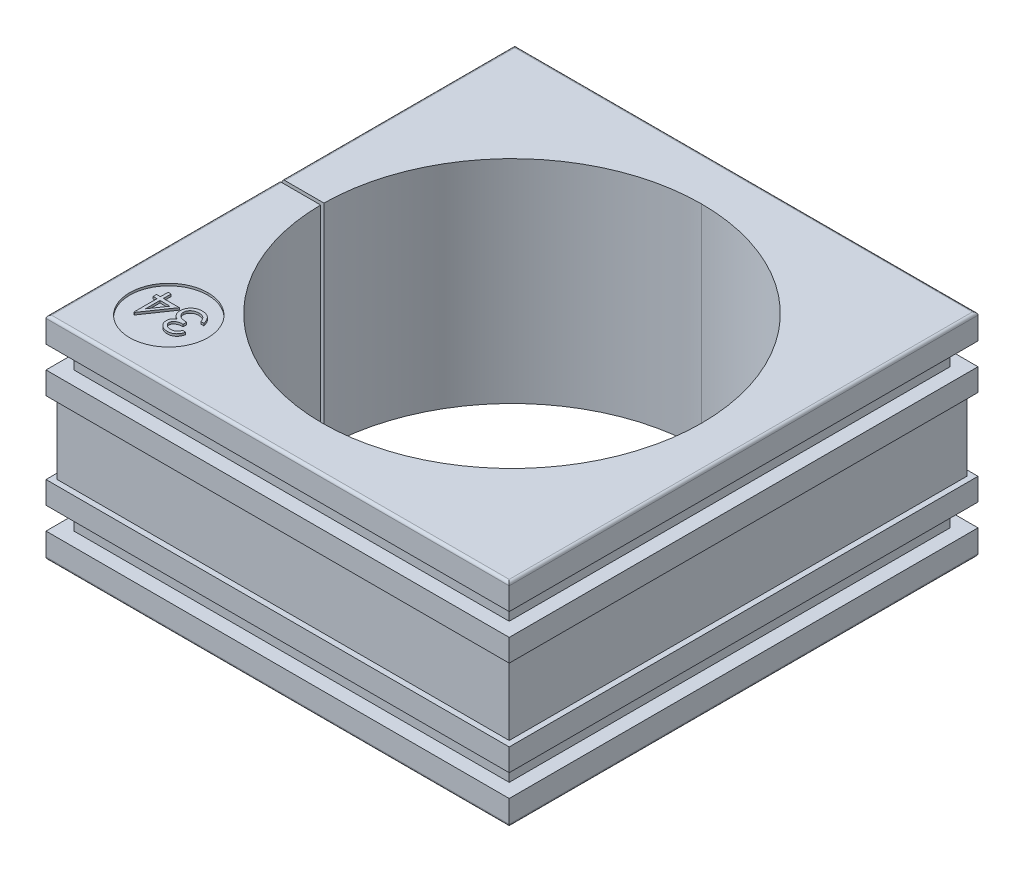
ISO-10303-21;
HEADER;
FILE_DESCRIPTION(('STEP AP214'),'2;1');
FILE_NAME('part.step','',(''),(''),'','','');
FILE_SCHEMA(('AUTOMOTIVE_DESIGN { 1 0 10303 214 1 1 1 1 }'));
ENDSEC;
DATA;
#1=APPLICATION_CONTEXT('core data for automotive mechanical design processes');
#2=APPLICATION_PROTOCOL_DEFINITION('international standard','automotive_design',2000,#1);
#3=PRODUCT_CONTEXT('',#1,'mechanical');
#4=PRODUCT('Part','Part','',(#3));
#5=PRODUCT_RELATED_PRODUCT_CATEGORY('part','',(#4));
#6=PRODUCT_DEFINITION_FORMATION('','',#4);
#7=PRODUCT_DEFINITION_CONTEXT('part definition',#1,'design');
#8=PRODUCT_DEFINITION('design','',#6,#7);
#9=PRODUCT_DEFINITION_SHAPE('','',#8);
#10=(LENGTH_UNIT() NAMED_UNIT(*) SI_UNIT(.MILLI.,.METRE.));
#11=(NAMED_UNIT(*) PLANE_ANGLE_UNIT() SI_UNIT($,.RADIAN.));
#12=(NAMED_UNIT(*) SI_UNIT($,.STERADIAN.) SOLID_ANGLE_UNIT());
#13=UNCERTAINTY_MEASURE_WITH_UNIT(LENGTH_MEASURE(1.E-05),#10,'distance_accuracy_value','');
#14=(GEOMETRIC_REPRESENTATION_CONTEXT(3) GLOBAL_UNCERTAINTY_ASSIGNED_CONTEXT((#13)) GLOBAL_UNIT_ASSIGNED_CONTEXT((#10,
#11,#12)) REPRESENTATION_CONTEXT('',''));
#15=CARTESIAN_POINT('',(0.,0.,0.));
#16=DIRECTION('',(0.,0.,1.));
#17=DIRECTION('',(1.,0.,0.));
#18=AXIS2_PLACEMENT_3D('',#15,#16,#17);
#19=CARTESIAN_POINT('',(-15.25,18.8,15.5));
#20=DIRECTION('',(0.,1.,0.));
#21=DIRECTION('',(1.,0.,0.));
#22=AXIS2_PLACEMENT_3D('',#19,#20,#21);
#23=PLANE('',#22);
#24=DIRECTION('',(-1.,0.,0.));
#25=VECTOR('',#24,1.);
#26=CARTESIAN_POINT('',(-15.8942307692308,18.8,14.75));
#27=LINE('',#26,#25);
#28=CARTESIAN_POINT('',(-15.8942307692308,18.8,14.75));
#29=VERTEX_POINT('',#28);
#30=CARTESIAN_POINT('',(-16.7884615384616,18.8,14.75));
#31=VERTEX_POINT('',#30);
#32=EDGE_CURVE('E1192',#29,#31,#27,.T.);
#33=ORIENTED_EDGE('',*,*,#32,.T.);
#34=DIRECTION('',(0.,0.,1.));
#35=VECTOR('',#34,1.);
#36=CARTESIAN_POINT('',(-16.7884615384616,18.8,14.75));
#37=LINE('',#36,#35);
#38=CARTESIAN_POINT('',(-16.7884615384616,18.8,16.0528846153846));
#39=VERTEX_POINT('',#38);
#40=EDGE_CURVE('E40',#31,#39,#37,.T.);
#41=ORIENTED_EDGE('',*,*,#40,.T.);
#42=DIRECTION('',(0.565883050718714,0.,-0.824485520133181));
#43=VECTOR('',#42,1.);
#44=CARTESIAN_POINT('',(-16.7884615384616,18.8,16.0528846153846));
#45=LINE('',#44,#43);
#46=EDGE_CURVE('E9',#39,#29,#45,.T.);
#47=ORIENTED_EDGE('',*,*,#46,.T.);
#48=EDGE_LOOP('',(#33,#41,#47));
#49=FACE_BOUND('',#48,.T.);
#50=ADVANCED_FACE('F15',(#49),#23,.T.);
#51=CARTESIAN_POINT('',(-16.7884615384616,19.,16.0528846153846));
#52=DIRECTION('',(-0.824485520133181,0.,-0.565883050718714));
#53=DIRECTION('',(-0.565883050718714,0.,0.824485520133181));
#54=AXIS2_PLACEMENT_3D('',#51,#52,#53);
#55=PLANE('',#54);
#56=ORIENTED_EDGE('',*,*,#46,.F.);
#57=DIRECTION('',(0.,-1.,0.));
#58=VECTOR('',#57,1.);
#59=CARTESIAN_POINT('',(-16.7884615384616,19.,16.0528846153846));
#60=LINE('',#59,#58);
#61=CARTESIAN_POINT('',(-16.7884615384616,19.,16.0528846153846));
#62=VERTEX_POINT('',#61);
#63=EDGE_CURVE('E24',#62,#39,#60,.T.);
#64=ORIENTED_EDGE('',*,*,#63,.F.);
#65=DIRECTION('',(0.565883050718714,0.,-0.824485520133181));
#66=VECTOR('',#65,1.);
#67=CARTESIAN_POINT('',(-16.7884615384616,19.,16.0528846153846));
#68=LINE('',#67,#66);
#69=CARTESIAN_POINT('',(-15.8942307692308,19.,14.75));
#70=VERTEX_POINT('',#69);
#71=EDGE_CURVE('E1737',#62,#70,#68,.T.);
#72=ORIENTED_EDGE('',*,*,#71,.T.);
#73=DIRECTION('',(0.,-1.,0.));
#74=VECTOR('',#73,1.);
#75=CARTESIAN_POINT('',(-15.8942307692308,19.,14.75));
#76=LINE('',#75,#74);
#77=EDGE_CURVE('E1188',#70,#29,#76,.T.);
#78=ORIENTED_EDGE('',*,*,#77,.T.);
#79=EDGE_LOOP('',(#56,#64,#72,#78));
#80=FACE_BOUND('',#79,.T.);
#81=ADVANCED_FACE('F1819',(#80),#55,.T.);
#82=CARTESIAN_POINT('',(-16.7884615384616,19.,14.75));
#83=DIRECTION('',(1.,0.,0.));
#84=DIRECTION('',(0.,1.,0.));
#85=AXIS2_PLACEMENT_3D('',#82,#83,#84);
#86=PLANE('',#85);
#87=ORIENTED_EDGE('',*,*,#40,.F.);
#88=DIRECTION('',(0.,-1.,0.));
#89=VECTOR('',#88,1.);
#90=CARTESIAN_POINT('',(-16.7884615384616,19.,14.75));
#91=LINE('',#90,#89);
#92=CARTESIAN_POINT('',(-16.7884615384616,19.,14.75));
#93=VERTEX_POINT('',#92);
#94=EDGE_CURVE('E1191',#93,#31,#91,.T.);
#95=ORIENTED_EDGE('',*,*,#94,.F.);
#96=DIRECTION('',(0.,0.,1.));
#97=VECTOR('',#96,1.);
#98=CARTESIAN_POINT('',(-16.7884615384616,19.,14.75));
#99=LINE('',#98,#97);
#100=EDGE_CURVE('E735',#93,#62,#99,.T.);
#101=ORIENTED_EDGE('',*,*,#100,.T.);
#102=ORIENTED_EDGE('',*,*,#63,.T.);
#103=EDGE_LOOP('',(#87,#95,#101,#102));
#104=FACE_BOUND('',#103,.T.);
#105=ADVANCED_FACE('F17',(#104),#86,.T.);
#106=CARTESIAN_POINT('',(-15.8942307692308,19.,14.75));
#107=DIRECTION('',(0.,0.,1.));
#108=DIRECTION('',(1.,0.,0.));
#109=AXIS2_PLACEMENT_3D('',#106,#107,#108);
#110=PLANE('',#109);
#111=ORIENTED_EDGE('',*,*,#32,.F.);
#112=ORIENTED_EDGE('',*,*,#77,.F.);
#113=DIRECTION('',(-1.,0.,0.));
#114=VECTOR('',#113,1.);
#115=CARTESIAN_POINT('',(-15.8942307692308,19.,14.75));
#116=LINE('',#115,#114);
#117=EDGE_CURVE('E1741',#70,#93,#116,.T.);
#118=ORIENTED_EDGE('',*,*,#117,.T.);
#119=ORIENTED_EDGE('',*,*,#94,.T.);
#120=EDGE_LOOP('',(#111,#112,#118,#119));
#121=FACE_BOUND('',#120,.T.);
#122=ADVANCED_FACE('F1814',(#121),#110,.T.);
#123=CARTESIAN_POINT('',(-17.0030048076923,19.,16.826923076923));
#124=DIRECTION('',(0.,0.,1.));
#125=DIRECTION('',(1.,0.,0.));
#126=AXIS2_PLACEMENT_3D('',#123,#124,#125);
#127=PLANE('',#126);
#128=DIRECTION('',(-1.,0.,0.));
#129=VECTOR('',#128,1.);
#130=CARTESIAN_POINT('',(-17.0030048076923,18.8,16.826923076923));
#131=LINE('',#130,#129);
#132=CARTESIAN_POINT('',(-17.0030048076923,18.8,16.826923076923));
#133=VERTEX_POINT('',#132);
#134=CARTESIAN_POINT('',(-17.0576923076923,18.8,16.826923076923));
#135=VERTEX_POINT('',#134);
#136=EDGE_CURVE('E745',#133,#135,#131,.T.);
#137=ORIENTED_EDGE('',*,*,#136,.F.);
#138=DIRECTION('',(0.,-1.,0.));
#139=VECTOR('',#138,1.);
#140=CARTESIAN_POINT('',(-17.0030048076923,19.,16.826923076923));
#141=LINE('',#140,#139);
#142=CARTESIAN_POINT('',(-17.0030048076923,19.,16.826923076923));
#143=VERTEX_POINT('',#142);
#144=EDGE_CURVE('E734',#143,#133,#141,.T.);
#145=ORIENTED_EDGE('',*,*,#144,.F.);
#146=DIRECTION('',(-1.,0.,0.));
#147=VECTOR('',#146,1.);
#148=CARTESIAN_POINT('',(-17.0030048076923,19.,16.826923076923));
#149=LINE('',#148,#147);
#150=CARTESIAN_POINT('',(-17.0576923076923,19.,16.826923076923));
#151=VERTEX_POINT('',#150);
#152=EDGE_CURVE('E1777',#143,#151,#149,.T.);
#153=ORIENTED_EDGE('',*,*,#152,.T.);
#154=DIRECTION('',(0.,-1.,0.));
#155=VECTOR('',#154,1.);
#156=CARTESIAN_POINT('',(-17.0576923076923,19.,16.826923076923));
#157=LINE('',#156,#155);
#158=EDGE_CURVE('E1754',#151,#135,#157,.T.);
#159=ORIENTED_EDGE('',*,*,#158,.T.);
#160=EDGE_LOOP('',(#137,#145,#153,#159));
#161=FACE_BOUND('',#160,.T.);
#162=ADVANCED_FACE('F1956',(#161),#127,.T.);
#163=CARTESIAN_POINT('',(-17.0576923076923,19.,16.826923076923));
#164=DIRECTION('',(-1.,0.,0.));
#165=DIRECTION('',(0.,0.,1.));
#166=AXIS2_PLACEMENT_3D('',#163,#164,#165);
#167=PLANE('',#166);
#168=DIRECTION('',(0.,0.,-1.));
#169=VECTOR('',#168,1.);
#170=CARTESIAN_POINT('',(-17.0576923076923,18.8,16.826923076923));
#171=LINE('',#170,#169);
#172=CARTESIAN_POINT('',(-17.0576923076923,18.8,14.75));
#173=VERTEX_POINT('',#172);
#174=EDGE_CURVE('E766',#135,#173,#171,.T.);
#175=ORIENTED_EDGE('',*,*,#174,.F.);
#176=ORIENTED_EDGE('',*,*,#158,.F.);
#177=DIRECTION('',(0.,0.,-1.));
#178=VECTOR('',#177,1.);
#179=CARTESIAN_POINT('',(-17.0576923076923,19.,16.826923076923));
#180=LINE('',#179,#178);
#181=CARTESIAN_POINT('',(-17.0576923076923,19.,14.75));
#182=VERTEX_POINT('',#181);
#183=EDGE_CURVE('E1773',#151,#182,#180,.T.);
#184=ORIENTED_EDGE('',*,*,#183,.T.);
#185=DIRECTION('',(0.,-1.,0.));
#186=VECTOR('',#185,1.);
#187=CARTESIAN_POINT('',(-17.0576923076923,19.,14.75));
#188=LINE('',#187,#186);
#189=EDGE_CURVE('E1757',#182,#173,#188,.T.);
#190=ORIENTED_EDGE('',*,*,#189,.T.);
#191=EDGE_LOOP('',(#175,#176,#184,#190));
#192=FACE_BOUND('',#191,.T.);
#193=ADVANCED_FACE('F1959',(#192),#167,.T.);
#194=CARTESIAN_POINT('',(-17.0576923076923,19.,14.75));
#195=DIRECTION('',(0.,0.,1.));
#196=DIRECTION('',(1.,0.,0.));
#197=AXIS2_PLACEMENT_3D('',#194,#195,#196);
#198=PLANE('',#197);
#199=DIRECTION('',(-1.,0.,0.));
#200=VECTOR('',#199,1.);
#201=CARTESIAN_POINT('',(-17.0576923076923,18.8,14.75));
#202=LINE('',#201,#200);
#203=CARTESIAN_POINT('',(-17.4038461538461,18.8,14.75));
#204=VERTEX_POINT('',#203);
#205=EDGE_CURVE('E761',#173,#204,#202,.T.);
#206=ORIENTED_EDGE('',*,*,#205,.F.);
#207=ORIENTED_EDGE('',*,*,#189,.F.);
#208=DIRECTION('',(-1.,0.,0.));
#209=VECTOR('',#208,1.);
#210=CARTESIAN_POINT('',(-17.0576923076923,19.,14.75));
#211=LINE('',#210,#209);
#212=CARTESIAN_POINT('',(-17.4038461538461,19.,14.75));
#213=VERTEX_POINT('',#212);
#214=EDGE_CURVE('E1769',#182,#213,#211,.T.);
#215=ORIENTED_EDGE('',*,*,#214,.T.);
#216=DIRECTION('',(0.,-1.,0.));
#217=VECTOR('',#216,1.);
#218=CARTESIAN_POINT('',(-17.4038461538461,19.,14.75));
#219=LINE('',#218,#217);
#220=EDGE_CURVE('E1797',#213,#204,#219,.T.);
#221=ORIENTED_EDGE('',*,*,#220,.T.);
#222=EDGE_LOOP('',(#206,#207,#215,#221));
#223=FACE_BOUND('',#222,.T.);
#224=ADVANCED_FACE('F2071',(#223),#198,.T.);
#225=CARTESIAN_POINT('',(-17.4038461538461,19.,14.75));
#226=DIRECTION('',(-1.,0.,0.));
#227=DIRECTION('',(0.,0.,1.));
#228=AXIS2_PLACEMENT_3D('',#225,#226,#227);
#229=PLANE('',#228);
#230=DIRECTION('',(0.,0.,-1.));
#231=VECTOR('',#230,1.);
#232=CARTESIAN_POINT('',(-17.4038461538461,18.8,14.75));
#233=LINE('',#232,#231);
#234=CARTESIAN_POINT('',(-17.4038461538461,18.8,14.4423076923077));
#235=VERTEX_POINT('',#234);
#236=EDGE_CURVE('E765',#204,#235,#233,.T.);
#237=ORIENTED_EDGE('',*,*,#236,.F.);
#238=ORIENTED_EDGE('',*,*,#220,.F.);
#239=DIRECTION('',(0.,0.,-1.));
#240=VECTOR('',#239,1.);
#241=CARTESIAN_POINT('',(-17.4038461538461,19.,14.75));
#242=LINE('',#241,#240);
#243=CARTESIAN_POINT('',(-17.4038461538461,19.,14.4423076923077));
#244=VERTEX_POINT('',#243);
#245=EDGE_CURVE('E1765',#213,#244,#242,.T.);
#246=ORIENTED_EDGE('',*,*,#245,.T.);
#247=DIRECTION('',(0.,-1.,0.));
#248=VECTOR('',#247,1.);
#249=CARTESIAN_POINT('',(-17.4038461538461,19.,14.4423076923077));
#250=LINE('',#249,#248);
#251=EDGE_CURVE('E1794',#244,#235,#250,.T.);
#252=ORIENTED_EDGE('',*,*,#251,.T.);
#253=EDGE_LOOP('',(#237,#238,#246,#252));
#254=FACE_BOUND('',#253,.T.);
#255=ADVANCED_FACE('F1981',(#254),#229,.T.);
#256=CARTESIAN_POINT('',(-17.4038461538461,19.,14.4423076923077));
#257=DIRECTION('',(0.,0.,-1.));
#258=DIRECTION('',(0.,-1.,0.));
#259=AXIS2_PLACEMENT_3D('',#256,#257,#258);
#260=PLANE('',#259);
#261=DIRECTION('',(1.,0.,0.));
#262=VECTOR('',#261,1.);
#263=CARTESIAN_POINT('',(-17.4038461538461,18.8,14.4423076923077));
#264=LINE('',#263,#262);
#265=CARTESIAN_POINT('',(-17.0576923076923,18.8,14.4423076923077));
#266=VERTEX_POINT('',#265);
#267=EDGE_CURVE('E878',#235,#266,#264,.T.);
#268=ORIENTED_EDGE('',*,*,#267,.F.);
#269=ORIENTED_EDGE('',*,*,#251,.F.);
#270=DIRECTION('',(1.,0.,0.));
#271=VECTOR('',#270,1.);
#272=CARTESIAN_POINT('',(-17.4038461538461,19.,14.4423076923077));
#273=LINE('',#272,#271);
#274=CARTESIAN_POINT('',(-17.0576923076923,19.,14.4423076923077));
#275=VERTEX_POINT('',#274);
#276=EDGE_CURVE('E1761',#244,#275,#273,.T.);
#277=ORIENTED_EDGE('',*,*,#276,.T.);
#278=DIRECTION('',(0.,-1.,0.));
#279=VECTOR('',#278,1.);
#280=CARTESIAN_POINT('',(-17.0576923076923,19.,14.4423076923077));
#281=LINE('',#280,#279);
#282=EDGE_CURVE('E1791',#275,#266,#281,.T.);
#283=ORIENTED_EDGE('',*,*,#282,.T.);
#284=EDGE_LOOP('',(#268,#269,#277,#283));
#285=FACE_BOUND('',#284,.T.);
#286=ADVANCED_FACE('F1977',(#285),#260,.T.);
#287=CARTESIAN_POINT('',(-17.0576923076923,19.,14.4423076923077));
#288=DIRECTION('',(-1.,0.,0.));
#289=DIRECTION('',(0.,0.,1.));
#290=AXIS2_PLACEMENT_3D('',#287,#288,#289);
#291=PLANE('',#290);
#292=DIRECTION('',(0.,0.,-1.));
#293=VECTOR('',#292,1.);
#294=CARTESIAN_POINT('',(-17.0576923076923,18.8,14.4423076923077));
#295=LINE('',#294,#293);
#296=CARTESIAN_POINT('',(-17.0576923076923,18.8,13.75));
#297=VERTEX_POINT('',#296);
#298=EDGE_CURVE('E882',#266,#297,#295,.T.);
#299=ORIENTED_EDGE('',*,*,#298,.F.);
#300=ORIENTED_EDGE('',*,*,#282,.F.);
#301=DIRECTION('',(0.,0.,-1.));
#302=VECTOR('',#301,1.);
#303=CARTESIAN_POINT('',(-17.0576923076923,19.,14.4423076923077));
#304=LINE('',#303,#302);
#305=CARTESIAN_POINT('',(-17.0576923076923,19.,13.75));
#306=VERTEX_POINT('',#305);
#307=EDGE_CURVE('E1753',#275,#306,#304,.T.);
#308=ORIENTED_EDGE('',*,*,#307,.T.);
#309=DIRECTION('',(0.,-1.,0.));
#310=VECTOR('',#309,1.);
#311=CARTESIAN_POINT('',(-17.0576923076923,19.,13.75));
#312=LINE('',#311,#310);
#313=EDGE_CURVE('E1436',#306,#297,#312,.T.);
#314=ORIENTED_EDGE('',*,*,#313,.T.);
#315=EDGE_LOOP('',(#299,#300,#308,#314));
#316=FACE_BOUND('',#315,.T.);
#317=ADVANCED_FACE('F1980',(#316),#291,.T.);
#318=CARTESIAN_POINT('',(-17.0576923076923,19.,13.75));
#319=DIRECTION('',(0.,0.,-1.));
#320=DIRECTION('',(0.,-1.,0.));
#321=AXIS2_PLACEMENT_3D('',#318,#319,#320);
#322=PLANE('',#321);
#323=DIRECTION('',(1.,0.,0.));
#324=VECTOR('',#323,1.);
#325=CARTESIAN_POINT('',(-17.0576923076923,18.8,13.75));
#326=LINE('',#325,#324);
#327=CARTESIAN_POINT('',(-16.7884615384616,18.8,13.75));
#328=VERTEX_POINT('',#327);
#329=EDGE_CURVE('E886',#297,#328,#326,.T.);
#330=ORIENTED_EDGE('',*,*,#329,.F.);
#331=ORIENTED_EDGE('',*,*,#313,.F.);
#332=DIRECTION('',(1.,0.,0.));
#333=VECTOR('',#332,1.);
#334=CARTESIAN_POINT('',(-17.0576923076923,19.,13.75));
#335=LINE('',#334,#333);
#336=CARTESIAN_POINT('',(-16.7884615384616,19.,13.75));
#337=VERTEX_POINT('',#336);
#338=EDGE_CURVE('E1749',#306,#337,#335,.T.);
#339=ORIENTED_EDGE('',*,*,#338,.T.);
#340=DIRECTION('',(0.,-1.,0.));
#341=VECTOR('',#340,1.);
#342=CARTESIAN_POINT('',(-16.7884615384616,19.,13.75));
#343=LINE('',#342,#341);
#344=EDGE_CURVE('E1433',#337,#328,#343,.T.);
#345=ORIENTED_EDGE('',*,*,#344,.T.);
#346=EDGE_LOOP('',(#330,#331,#339,#345));
#347=FACE_BOUND('',#346,.T.);
#348=ADVANCED_FACE('F1996',(#347),#322,.T.);
#349=CARTESIAN_POINT('',(-16.7884615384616,19.,13.75));
#350=DIRECTION('',(1.,0.,0.));
#351=DIRECTION('',(0.,1.,0.));
#352=AXIS2_PLACEMENT_3D('',#349,#350,#351);
#353=PLANE('',#352);
#354=DIRECTION('',(0.,0.,1.));
#355=VECTOR('',#354,1.);
#356=CARTESIAN_POINT('',(-16.7884615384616,18.8,13.75));
#357=LINE('',#356,#355);
#358=CARTESIAN_POINT('',(-16.7884615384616,18.8,14.4423076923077));
#359=VERTEX_POINT('',#358);
#360=EDGE_CURVE('E890',#328,#359,#357,.T.);
#361=ORIENTED_EDGE('',*,*,#360,.F.);
#362=ORIENTED_EDGE('',*,*,#344,.F.);
#363=DIRECTION('',(0.,0.,1.));
#364=VECTOR('',#363,1.);
#365=CARTESIAN_POINT('',(-16.7884615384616,19.,13.75));
#366=LINE('',#365,#364);
#367=CARTESIAN_POINT('',(-16.7884615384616,19.,14.4423076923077));
#368=VERTEX_POINT('',#367);
#369=EDGE_CURVE('E1745',#337,#368,#366,.T.);
#370=ORIENTED_EDGE('',*,*,#369,.T.);
#371=DIRECTION('',(0.,-1.,0.));
#372=VECTOR('',#371,1.);
#373=CARTESIAN_POINT('',(-16.7884615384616,19.,14.4423076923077));
#374=LINE('',#373,#372);
#375=EDGE_CURVE('E1437',#368,#359,#374,.T.);
#376=ORIENTED_EDGE('',*,*,#375,.T.);
#377=EDGE_LOOP('',(#361,#362,#370,#376));
#378=FACE_BOUND('',#377,.T.);
#379=ADVANCED_FACE('F1882',(#378),#353,.T.);
#380=CARTESIAN_POINT('',(-16.7884615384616,19.,14.4423076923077));
#381=DIRECTION('',(0.,0.,-1.));
#382=DIRECTION('',(0.,-1.,0.));
#383=AXIS2_PLACEMENT_3D('',#380,#381,#382);
#384=PLANE('',#383);
#385=DIRECTION('',(1.,0.,0.));
#386=VECTOR('',#385,1.);
#387=CARTESIAN_POINT('',(-16.7884615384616,18.8,14.4423076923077));
#388=LINE('',#387,#386);
#389=CARTESIAN_POINT('',(-15.3653846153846,18.8,14.4423076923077));
#390=VERTEX_POINT('',#389);
#391=EDGE_CURVE('E900',#359,#390,#388,.T.);
#392=ORIENTED_EDGE('',*,*,#391,.F.);
#393=ORIENTED_EDGE('',*,*,#375,.F.);
#394=DIRECTION('',(1.,0.,0.));
#395=VECTOR('',#394,1.);
#396=CARTESIAN_POINT('',(-16.7884615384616,19.,14.4423076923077));
#397=LINE('',#396,#395);
#398=CARTESIAN_POINT('',(-15.3653846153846,19.,14.4423076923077));
#399=VERTEX_POINT('',#398);
#400=EDGE_CURVE('E1736',#368,#399,#397,.T.);
#401=ORIENTED_EDGE('',*,*,#400,.T.);
#402=DIRECTION('',(0.,-1.,0.));
#403=VECTOR('',#402,1.);
#404=CARTESIAN_POINT('',(-15.3653846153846,19.,14.4423076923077));
#405=LINE('',#404,#403);
#406=EDGE_CURVE('E732',#399,#390,#405,.T.);
#407=ORIENTED_EDGE('',*,*,#406,.T.);
#408=EDGE_LOOP('',(#392,#393,#401,#407));
#409=FACE_BOUND('',#408,.T.);
#410=ADVANCED_FACE('F1878',(#409),#384,.T.);
#411=CARTESIAN_POINT('',(-15.3653846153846,19.,14.4423076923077));
#412=DIRECTION('',(0.824332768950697,0.,0.566105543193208));
#413=DIRECTION('',(0.,-1.,0.));
#414=AXIS2_PLACEMENT_3D('',#411,#412,#413);
#415=PLANE('',#414);
#416=DIRECTION('',(-0.566105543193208,0.,0.824332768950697));
#417=VECTOR('',#416,1.);
#418=CARTESIAN_POINT('',(-15.3653846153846,18.8,14.4423076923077));
#419=LINE('',#418,#417);
#420=EDGE_CURVE('E713',#390,#133,#419,.T.);
#421=ORIENTED_EDGE('',*,*,#420,.F.);
#422=ORIENTED_EDGE('',*,*,#406,.F.);
#423=DIRECTION('',(-0.566105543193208,0.,0.824332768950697));
#424=VECTOR('',#423,1.);
#425=CARTESIAN_POINT('',(-15.3653846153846,19.,14.4423076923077));
#426=LINE('',#425,#424);
#427=EDGE_CURVE('E1732',#399,#143,#426,.T.);
#428=ORIENTED_EDGE('',*,*,#427,.T.);
#429=ORIENTED_EDGE('',*,*,#144,.T.);
#430=EDGE_LOOP('',(#421,#422,#428,#429));
#431=FACE_BOUND('',#430,.T.);
#432=ADVANCED_FACE('F1881',(#431),#415,.T.);
#433=CARTESIAN_POINT('',(0.,19.,0.));
#434=DIRECTION('',(0.,-1.,0.));
#435=DIRECTION('',(0.,0.,-1.));
#436=AXIS2_PLACEMENT_3D('',#433,#434,#435);
#437=PLANE('',#436);
#438=ORIENTED_EDGE('',*,*,#117,.F.);
#439=ORIENTED_EDGE('',*,*,#71,.F.);
#440=ORIENTED_EDGE('',*,*,#100,.F.);
#441=EDGE_LOOP('',(#438,#439,#440));
#442=FACE_BOUND('',#441,.T.);
#443=ORIENTED_EDGE('',*,*,#427,.F.);
#444=ORIENTED_EDGE('',*,*,#400,.F.);
#445=ORIENTED_EDGE('',*,*,#369,.F.);
#446=ORIENTED_EDGE('',*,*,#338,.F.);
#447=ORIENTED_EDGE('',*,*,#307,.F.);
#448=ORIENTED_EDGE('',*,*,#276,.F.);
#449=ORIENTED_EDGE('',*,*,#245,.F.);
#450=ORIENTED_EDGE('',*,*,#214,.F.);
#451=ORIENTED_EDGE('',*,*,#183,.F.);
#452=ORIENTED_EDGE('',*,*,#152,.F.);
#453=EDGE_LOOP('',(#443,#444,#445,#446,#447,#448,#449,#450,#451,#452));
#454=FACE_BOUND('',#453,.T.);
#455=ADVANCED_FACE('F1817',(#442,#454),#437,.F.);
#456=CARTESIAN_POINT('',(-13.6790277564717,19.,16.3958219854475));
#457=DIRECTION('',(1.35309109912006E-13,-1.,9.68401741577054E-13));
#458=DIRECTION('',(-1.,-1.35309109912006E-13,0.));
#459=AXIS2_PLACEMENT_3D('',#456,#457,#458);
#460=PLANE('',#459);
#461=CARTESIAN_POINT('',(-14.0697115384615,19.,16.5192307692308));
#462=CARTESIAN_POINT('',(-14.035551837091,19.,16.5180404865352));
#463=CARTESIAN_POINT('',(-13.9688299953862,19.,16.5157155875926));
#464=CARTESIAN_POINT('',(-13.8726615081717,19.,16.4952807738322));
#465=CARTESIAN_POINT('',(-13.7833521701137,19.,16.4629039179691));
#466=CARTESIAN_POINT('',(-13.7153164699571,19.,16.4238089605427));
#467=CARTESIAN_POINT('',(-13.6649912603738,19.,16.3853499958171));
#468=CARTESIAN_POINT('',(-13.6283398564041,19.,16.352263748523));
#469=CARTESIAN_POINT('',(-13.5930041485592,19.,16.3147507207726));
#470=CARTESIAN_POINT('',(-13.5603707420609,19.,16.2717819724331));
#471=CARTESIAN_POINT('',(-13.5284841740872,19.,16.2248350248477));
#472=CARTESIAN_POINT('',(-13.4976489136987,19.,16.1736513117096));
#473=CARTESIAN_POINT('',(-13.4688553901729,19.,16.11750110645));
#474=CARTESIAN_POINT('',(-13.4513283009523,19.,16.0780146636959));
#475=CARTESIAN_POINT('',(-13.4423076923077,19.,16.0576923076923));
#476=(BOUNDED_CURVE() B_SPLINE_CURVE(3,(#461,#462,#463,#464,#465,#466,#467,#468,#469,#470,#471,
#472,#473,#474,#475),.UNSPECIFIED.,.F.,.F.) B_SPLINE_CURVE_WITH_KNOTS((4,1,1,1,1,1,1,1,1,1,1,1,
4),(0.,0.122728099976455,0.239716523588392,0.351862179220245,0.463201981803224,
0.520261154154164,0.579432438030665,0.640596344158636,0.705298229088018,0.773236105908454,
0.844648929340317,0.920045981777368,1.),
.UNSPECIFIED.) CURVE() GEOMETRIC_REPRESENTATION_ITEM() RATIONAL_B_SPLINE_CURVE((1.,1.,1.,1.,1.,
1.,1.,1.,1.,1.,1.,1.,1.,1.,1.)) REPRESENTATION_ITEM(''));
#477=CARTESIAN_POINT('',(-14.0697115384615,19.,16.5192307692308));
#478=VERTEX_POINT('',#477);
#479=CARTESIAN_POINT('',(-13.4423076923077,19.,16.0576923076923));
#480=VERTEX_POINT('',#479);
#481=EDGE_CURVE('E1565',#478,#480,#476,.T.);
#482=ORIENTED_EDGE('',*,*,#481,.F.);
#483=CARTESIAN_POINT('',(-14.6730769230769,19.,16.0486778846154));
#484=CARTESIAN_POINT('',(-14.6727295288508,19.,16.0643471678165));
#485=CARTESIAN_POINT('',(-14.6720384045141,19.,16.095520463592));
#486=CARTESIAN_POINT('',(-14.6629743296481,19.,16.1412061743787));
#487=CARTESIAN_POINT('',(-14.6499831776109,19.,16.1854958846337));
#488=CARTESIAN_POINT('',(-14.6311096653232,19.,16.2278720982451));
#489=CARTESIAN_POINT('',(-14.6067004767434,19.,16.2684695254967));
#490=CARTESIAN_POINT('',(-14.5771689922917,19.,16.3074364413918));
#491=CARTESIAN_POINT('',(-14.5424404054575,19.,16.345144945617));
#492=CARTESIAN_POINT('',(-14.5027402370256,19.,16.3807633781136));
#493=CARTESIAN_POINT('',(-14.4584338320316,19.,16.4128205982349));
#494=CARTESIAN_POINT('',(-14.4112994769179,19.,16.4413991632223));
#495=CARTESIAN_POINT('',(-14.3611534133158,19.,16.4654296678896));
#496=CARTESIAN_POINT('',(-14.3083224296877,19.,16.4853493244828));
#497=CARTESIAN_POINT('',(-14.2525209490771,19.,16.5003073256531));
#498=CARTESIAN_POINT('',(-14.1940425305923,19.,16.5110543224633));
#499=CARTESIAN_POINT('',(-14.1327669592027,19.,16.5177717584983));
#500=CARTESIAN_POINT('',(-14.0909626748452,19.,16.518739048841));
#501=CARTESIAN_POINT('',(-14.0697115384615,19.,16.5192307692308));
#502=(BOUNDED_CURVE() B_SPLINE_CURVE(3,(#483,#484,#485,#486,#487,#488,#489,#490,#491,#492,#493,
#494,#495,#496,#497,#498,#499,#500,#501),.UNSPECIFIED.,.F.,.F.) B_SPLINE_CURVE_WITH_KNOTS((4,1,
1,1,1,1,1,1,1,1,1,1,1,1,1,1,4),(0.,0.0552654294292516,0.109947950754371,0.163897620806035,
0.218069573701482,0.273285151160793,0.330884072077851,0.390478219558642,0.4541190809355,
0.518940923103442,0.58337928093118,0.648574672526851,0.715077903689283,0.782537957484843,
0.852347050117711,0.924940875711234,1.),
.UNSPECIFIED.) CURVE() GEOMETRIC_REPRESENTATION_ITEM() RATIONAL_B_SPLINE_CURVE((1.,1.,1.,1.,1.,
1.,1.,1.,1.,1.,1.,1.,1.,1.,1.,1.,1.,1.,1.)) REPRESENTATION_ITEM(''));
#503=CARTESIAN_POINT('',(-14.6730769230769,19.,16.0486778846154));
#504=VERTEX_POINT('',#503);
#505=EDGE_CURVE('E1582',#504,#478,#502,.T.);
#506=ORIENTED_EDGE('',*,*,#505,.F.);
#507=CARTESIAN_POINT('',(-13.9038461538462,19.,15.5576923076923));
#508=CARTESIAN_POINT('',(-13.9409470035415,19.,15.5584156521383));
#509=CARTESIAN_POINT('',(-14.0135930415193,19.,15.5598320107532));
#510=CARTESIAN_POINT('',(-14.1200086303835,19.,15.5734349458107));
#511=CARTESIAN_POINT('',(-14.221455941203,19.,15.5955144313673));
#512=CARTESIAN_POINT('',(-14.3164090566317,19.,15.6263402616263));
#513=CARTESIAN_POINT('',(-14.4025077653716,19.,15.6638682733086));
#514=CARTESIAN_POINT('',(-14.4779180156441,19.,15.7058853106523));
#515=CARTESIAN_POINT('',(-14.539926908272,19.,15.7543586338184));
#516=CARTESIAN_POINT('',(-14.5896450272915,19.,15.806996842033));
#517=CARTESIAN_POINT('',(-14.6265214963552,19.,15.8638110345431));
#518=CARTESIAN_POINT('',(-14.6537415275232,19.,15.9227571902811));
#519=CARTESIAN_POINT('',(-14.6698416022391,19.,15.9849319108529));
#520=CARTESIAN_POINT('',(-14.6719946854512,19.,16.027354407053));
#521=CARTESIAN_POINT('',(-14.6730769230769,19.,16.0486778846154));
#522=(BOUNDED_CURVE() B_SPLINE_CURVE(3,(#507,#508,#509,#510,#511,#512,#513,#514,#515,#516,#517,
#518,#519,#520,#521),.UNSPECIFIED.,.F.,.F.) B_SPLINE_CURVE_WITH_KNOTS((4,1,1,1,1,1,1,1,1,1,1,1,
4),(0.,0.11015137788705,0.215684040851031,0.318037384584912,0.418136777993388,0.511655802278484,
0.596672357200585,0.673800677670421,0.744526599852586,0.810701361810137,0.874075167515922,
0.936704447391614,1.),
.UNSPECIFIED.) CURVE() GEOMETRIC_REPRESENTATION_ITEM() RATIONAL_B_SPLINE_CURVE((1.,1.,1.,1.,1.,
1.,1.,1.,1.,1.,1.,1.,1.,1.,1.)) REPRESENTATION_ITEM(''));
#523=CARTESIAN_POINT('',(-13.9038461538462,19.,15.5576923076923));
#524=VERTEX_POINT('',#523);
#525=EDGE_CURVE('E1593',#524,#504,#522,.T.);
#526=ORIENTED_EDGE('',*,*,#525,.F.);
#527=DIRECTION('',(0.,0.,1.));
#528=VECTOR('',#527,1.);
#529=CARTESIAN_POINT('',(-13.9038461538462,19.,15.25));
#530=LINE('',#529,#528);
#531=CARTESIAN_POINT('',(-13.9038461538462,19.,15.25));
#532=VERTEX_POINT('',#531);
#533=EDGE_CURVE('E1604',#532,#524,#530,.T.);
#534=ORIENTED_EDGE('',*,*,#533,.F.);
#535=CARTESIAN_POINT('',(-14.8269230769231,19.,14.6153846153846));
#536=CARTESIAN_POINT('',(-14.8256086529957,19.,14.6433354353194));
#537=CARTESIAN_POINT('',(-14.8229863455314,19.,14.6990979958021));
#538=CARTESIAN_POINT('',(-14.8030485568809,19.,14.7811679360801));
#539=CARTESIAN_POINT('',(-14.7699604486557,19.,14.8602725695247));
#540=CARTESIAN_POINT('',(-14.7245391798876,19.,14.9353759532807));
#541=CARTESIAN_POINT('',(-14.6679223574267,19.,15.0041679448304));
#542=CARTESIAN_POINT('',(-14.6027862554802,19.,15.0657441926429));
#543=CARTESIAN_POINT('',(-14.5277410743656,19.,15.1170158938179));
#544=CARTESIAN_POINT('',(-14.4582784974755,19.,15.1523414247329));
#545=CARTESIAN_POINT('',(-14.3965908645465,19.,15.1758774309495));
#546=CARTESIAN_POINT('',(-14.3439064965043,19.,15.192381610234));
#547=CARTESIAN_POINT('',(-14.2848720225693,19.,15.2055744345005));
#548=CARTESIAN_POINT('',(-14.2201967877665,19.,15.2183359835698));
#549=CARTESIAN_POINT('',(-14.1496078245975,19.,15.2290344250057));
#550=CARTESIAN_POINT('',(-14.073041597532,19.,15.237994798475));
#551=CARTESIAN_POINT('',(-13.9904672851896,19.,15.2451532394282));
#552=CARTESIAN_POINT('',(-13.9333035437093,19.,15.2483517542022));
#553=CARTESIAN_POINT('',(-13.9038461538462,19.,15.25));
#554=(BOUNDED_CURVE() B_SPLINE_CURVE(3,(#535,#536,#537,#538,#539,#540,#541,#542,#543,#544,#545,
#546,#547,#548,#549,#550,#551,#552,#553),.UNSPECIFIED.,.F.,.F.) B_SPLINE_CURVE_WITH_KNOTS((4,1,
1,1,1,1,1,1,1,1,1,1,1,1,1,1,4),(0.,0.0669025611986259,0.133472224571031,0.201015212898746,
0.271617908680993,0.342884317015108,0.413833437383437,0.485571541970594,0.559817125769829,
0.59991528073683,0.643623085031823,0.691922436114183,0.744712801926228,0.801511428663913,
0.862871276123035,0.9293353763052,1.),
.UNSPECIFIED.) CURVE() GEOMETRIC_REPRESENTATION_ITEM() RATIONAL_B_SPLINE_CURVE((1.,1.,1.,1.,1.,
1.,1.,1.,1.,1.,1.,1.,1.,1.,1.,1.,1.,1.,1.)) REPRESENTATION_ITEM(''));
#555=CARTESIAN_POINT('',(-14.8269230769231,19.,14.6153846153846));
#556=VERTEX_POINT('',#555);
#557=EDGE_CURVE('E1610',#556,#532,#554,.T.);
#558=ORIENTED_EDGE('',*,*,#557,.F.);
#559=CARTESIAN_POINT('',(-14.0631009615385,19.,13.9807692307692));
#560=CARTESIAN_POINT('',(-14.09117577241,19.,13.9812962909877));
#561=CARTESIAN_POINT('',(-14.1460736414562,19.,13.9823269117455));
#562=CARTESIAN_POINT('',(-14.2261724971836,19.,13.9918323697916));
#563=CARTESIAN_POINT('',(-14.3023978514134,19.,14.0056155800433));
#564=CARTESIAN_POINT('',(-14.3739718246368,19.,14.0271752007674));
#565=CARTESIAN_POINT('',(-14.4418683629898,19.,14.0530395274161));
#566=CARTESIAN_POINT('',(-14.504571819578,19.,14.0869006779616));
#567=CARTESIAN_POINT('',(-14.5639255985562,19.,14.1251413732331));
#568=CARTESIAN_POINT('',(-14.6181909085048,19.,14.169622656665));
#569=CARTESIAN_POINT('',(-14.6671137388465,19.,14.2177021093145));
#570=CARTESIAN_POINT('',(-14.7093884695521,19.,14.2687101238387));
#571=CARTESIAN_POINT('',(-14.7460032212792,19.,14.3210651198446));
#572=CARTESIAN_POINT('',(-14.7754353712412,19.,14.3759884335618));
#573=CARTESIAN_POINT('',(-14.7987175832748,19.,14.4329413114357));
#574=CARTESIAN_POINT('',(-14.8145575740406,19.,14.4921369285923));
#575=CARTESIAN_POINT('',(-14.8255738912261,19.,14.553076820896));
#576=CARTESIAN_POINT('',(-14.826470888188,19.,14.5945017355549));
#577=CARTESIAN_POINT('',(-14.8269230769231,19.,14.6153846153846));
#578=(BOUNDED_CURVE() B_SPLINE_CURVE(3,(#559,#560,#561,#562,#563,#564,#565,#566,#567,#568,#569,
#570,#571,#572,#573,#574,#575,#576,#577),.UNSPECIFIED.,.F.,.F.) B_SPLINE_CURVE_WITH_KNOTS((4,1,
1,1,1,1,1,1,1,1,1,1,1,1,1,1,4),(0.,0.0760618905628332,0.148732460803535,0.218374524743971,
0.285722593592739,0.351057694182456,0.414934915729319,0.478485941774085,0.542169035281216,
0.604750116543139,0.664118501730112,0.721499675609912,0.777615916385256,0.832666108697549,
0.887858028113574,0.943467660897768,1.),
.UNSPECIFIED.) CURVE() GEOMETRIC_REPRESENTATION_ITEM() RATIONAL_B_SPLINE_CURVE((1.,1.,1.,1.,1.,
1.,1.,1.,1.,1.,1.,1.,1.,1.,1.,1.,1.,1.,1.)) REPRESENTATION_ITEM(''));
#579=CARTESIAN_POINT('',(-14.0631009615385,19.,13.9807692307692));
#580=VERTEX_POINT('',#579);
#581=EDGE_CURVE('E777',#580,#556,#578,.T.);
#582=ORIENTED_EDGE('',*,*,#581,.F.);
#583=CARTESIAN_POINT('',(-13.5618990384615,19.,14.1430288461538));
#584=CARTESIAN_POINT('',(-13.5786979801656,19.,14.1300841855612));
#585=CARTESIAN_POINT('',(-13.6122440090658,19.,14.1042348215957));
#586=CARTESIAN_POINT('',(-13.6668743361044,19.,14.0711532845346));
#587=CARTESIAN_POINT('',(-13.7245297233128,19.,14.042836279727));
#588=CARTESIAN_POINT('',(-13.7856909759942,19.,14.0198190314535));
#589=CARTESIAN_POINT('',(-13.8503662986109,19.,14.0025414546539));
#590=CARTESIAN_POINT('',(-13.9182933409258,19.,13.9901058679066));
#591=CARTESIAN_POINT('',(-13.989583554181,19.,13.9818964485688));
#592=CARTESIAN_POINT('',(-14.0382377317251,19.,13.9811504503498));
#593=CARTESIAN_POINT('',(-14.0631009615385,19.,13.9807692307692));
#594=(BOUNDED_CURVE() B_SPLINE_CURVE(3,(#583,#584,#585,#586,#587,#588,#589,#590,#591,#592,#593),
.UNSPECIFIED.,.F.,.F.) B_SPLINE_CURVE_WITH_KNOTS((4,1,1,1,1,1,1,1,4),(0.,0.118260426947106,
0.236155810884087,0.355630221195,0.476249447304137,0.60016411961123,0.728633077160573,
0.861326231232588,1.),
.UNSPECIFIED.) CURVE() GEOMETRIC_REPRESENTATION_ITEM() RATIONAL_B_SPLINE_CURVE((1.,1.,1.,1.,1.,
1.,1.,1.,1.,1.,1.)) REPRESENTATION_ITEM(''));
#595=CARTESIAN_POINT('',(-13.5618990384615,19.,14.1430288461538));
#596=VERTEX_POINT('',#595);
#597=EDGE_CURVE('E776',#596,#580,#594,.T.);
#598=ORIENTED_EDGE('',*,*,#597,.F.);
#599=CARTESIAN_POINT('',(-13.3269230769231,19.,14.5576923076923));
#600=CARTESIAN_POINT('',(-13.333937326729,19.,14.534593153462));
#601=CARTESIAN_POINT('',(-13.3475806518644,19.,14.4896632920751));
#602=CARTESIAN_POINT('',(-13.3708043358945,19.,14.4250001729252));
#603=CARTESIAN_POINT('',(-13.397262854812,19.,14.3657218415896));
#604=CARTESIAN_POINT('',(-13.4256467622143,19.,14.3113934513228));
#605=CARTESIAN_POINT('',(-13.4554568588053,19.,14.2614799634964));
#606=CARTESIAN_POINT('',(-13.4888125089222,19.,14.21730121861));
#607=CARTESIAN_POINT('',(-13.5232432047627,19.,14.1769167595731));
#608=CARTESIAN_POINT('',(-13.5491969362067,19.,14.1541642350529));
#609=CARTESIAN_POINT('',(-13.5618990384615,19.,14.1430288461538));
#610=(BOUNDED_CURVE() B_SPLINE_CURVE(3,(#599,#600,#601,#602,#603,#604,#605,#606,#607,#608,#609),
.UNSPECIFIED.,.F.,.F.) B_SPLINE_CURVE_WITH_KNOTS((4,1,1,1,1,1,1,1,4),(0.,0.14977038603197,
0.291316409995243,0.425966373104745,0.552159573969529,0.671527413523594,0.78612162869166,
0.895325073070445,1.),
.UNSPECIFIED.) CURVE() GEOMETRIC_REPRESENTATION_ITEM() RATIONAL_B_SPLINE_CURVE((1.,1.,1.,1.,1.,
1.,1.,1.,1.,1.,1.)) REPRESENTATION_ITEM(''));
#611=CARTESIAN_POINT('',(-13.3269230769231,19.,14.5576923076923));
#612=VERTEX_POINT('',#611);
#613=EDGE_CURVE('E1638',#612,#596,#610,.T.);
#614=ORIENTED_EDGE('',*,*,#613,.F.);
#615=DIRECTION('',(-1.,0.,0.));
#616=VECTOR('',#615,1.);
#617=CARTESIAN_POINT('',(-13.0576923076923,19.,14.5576923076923));
#618=LINE('',#617,#616);
#619=CARTESIAN_POINT('',(-13.0576923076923,19.,14.5576923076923));
#620=VERTEX_POINT('',#619);
#621=EDGE_CURVE('E1649',#620,#612,#618,.T.);
#622=ORIENTED_EDGE('',*,*,#621,.F.);
#623=CARTESIAN_POINT('',(-14.0582932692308,19.,13.6730769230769));
#624=CARTESIAN_POINT('',(-14.0262216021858,19.,13.6738275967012));
#625=CARTESIAN_POINT('',(-13.9631152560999,19.,13.6753046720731));
#626=CARTESIAN_POINT('',(-13.8703063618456,19.,13.6852224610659));
#627=CARTESIAN_POINT('',(-13.7819036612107,19.,13.7038289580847));
#628=CARTESIAN_POINT('',(-13.6970487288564,19.,13.7272292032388));
#629=CARTESIAN_POINT('',(-13.6170222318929,19.,13.7595826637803));
#630=CARTESIAN_POINT('',(-13.5406730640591,19.,13.7981539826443));
#631=CARTESIAN_POINT('',(-13.4683358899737,19.,13.8439322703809));
#632=CARTESIAN_POINT('',(-13.4004402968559,19.,13.8969945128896));
#633=CARTESIAN_POINT('',(-13.3370588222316,19.,13.9563897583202));
#634=CARTESIAN_POINT('',(-13.2798062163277,19.,14.0231047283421));
#635=CARTESIAN_POINT('',(-13.2280490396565,19.,14.0958942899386));
#636=CARTESIAN_POINT('',(-13.1821161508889,19.,14.1754131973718));
#637=CARTESIAN_POINT('',(-13.1418142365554,19.,14.2614387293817));
#638=CARTESIAN_POINT('',(-13.1080105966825,19.,14.3543156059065));
#639=CARTESIAN_POINT('',(-13.0784958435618,19.,14.4533238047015));
#640=CARTESIAN_POINT('',(-13.064746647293,19.,14.5223016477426));
#641=CARTESIAN_POINT('',(-13.0576923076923,19.,14.5576923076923));
#642=(BOUNDED_CURVE() B_SPLINE_CURVE(3,(#623,#624,#625,#626,#627,#628,#629,#630,#631,#632,#633,
#634,#635,#636,#637,#638,#639,#640,#641),.UNSPECIFIED.,.F.,.F.) B_SPLINE_CURVE_WITH_KNOTS((4,1,
1,1,1,1,1,1,1,1,1,1,1,1,1,1,4),(0.,0.0655377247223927,0.128956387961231,0.190367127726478,
0.249965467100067,0.308568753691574,0.366415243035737,0.424556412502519,0.483181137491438,
0.542251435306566,0.601744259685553,0.662507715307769,0.724499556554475,0.789138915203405,
0.856353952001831,0.926299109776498,1.),
.UNSPECIFIED.) CURVE() GEOMETRIC_REPRESENTATION_ITEM() RATIONAL_B_SPLINE_CURVE((1.,1.,1.,1.,1.,
1.,1.,1.,1.,1.,1.,1.,1.,1.,1.,1.,1.,1.,1.)) REPRESENTATION_ITEM(''));
#643=CARTESIAN_POINT('',(-14.0582932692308,19.,13.6730769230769));
#644=VERTEX_POINT('',#643);
#645=EDGE_CURVE('E1655',#644,#620,#642,.T.);
#646=ORIENTED_EDGE('',*,*,#645,.F.);
#647=CARTESIAN_POINT('',(-15.0961538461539,19.,14.6412259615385));
#648=CARTESIAN_POINT('',(-15.094612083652,19.,14.5992195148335));
#649=CARTESIAN_POINT('',(-15.0915358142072,19.,14.5154043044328));
#650=CARTESIAN_POINT('',(-15.0641578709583,19.,14.3915405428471));
#651=CARTESIAN_POINT('',(-15.0214517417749,19.,14.2706867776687));
#652=CARTESIAN_POINT('',(-14.9619336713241,19.,14.1545569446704));
#653=CARTESIAN_POINT('',(-14.8879617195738,19.,14.0462335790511));
#654=CARTESIAN_POINT('',(-14.8004428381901,19.,13.9490346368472));
#655=CARTESIAN_POINT('',(-14.69928383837,19.,13.866247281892));
#656=CARTESIAN_POINT('',(-14.5874300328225,19.,13.7964626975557));
#657=CARTESIAN_POINT('',(-14.4657787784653,19.,13.7411592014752));
#658=CARTESIAN_POINT('',(-14.3361801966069,19.,13.7013085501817));
#659=CARTESIAN_POINT('',(-14.1994016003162,19.,13.6774037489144));
#660=CARTESIAN_POINT('',(-14.1058649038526,19.,13.6745356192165));
#661=CARTESIAN_POINT('',(-14.0582932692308,19.,13.6730769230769));
#662=(BOUNDED_CURVE() B_SPLINE_CURVE(3,(#647,#648,#649,#650,#651,#652,#653,#654,#655,#656,#657,
#658,#659,#660,#661),.UNSPECIFIED.,.F.,.F.) B_SPLINE_CURVE_WITH_KNOTS((4,1,1,1,1,1,1,1,1,1,1,1,
4),(0.,0.0796349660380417,0.158895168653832,0.239579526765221,0.322382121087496,
0.405793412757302,0.487884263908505,0.569710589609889,0.653048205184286,0.737433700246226,
0.822572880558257,0.909762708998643,1.),
.UNSPECIFIED.) CURVE() GEOMETRIC_REPRESENTATION_ITEM() RATIONAL_B_SPLINE_CURVE((1.,1.,1.,1.,1.,
1.,1.,1.,1.,1.,1.,1.,1.,1.,1.)) REPRESENTATION_ITEM(''));
#663=CARTESIAN_POINT('',(-15.0961538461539,19.,14.6412259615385));
#664=VERTEX_POINT('',#663);
#665=EDGE_CURVE('E1666',#664,#644,#662,.T.);
#666=ORIENTED_EDGE('',*,*,#665,.F.);
#667=CARTESIAN_POINT('',(-14.9170673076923,19.,15.1742788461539));
#668=CARTESIAN_POINT('',(-14.9315086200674,19.,15.1545171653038));
#669=CARTESIAN_POINT('',(-14.9601547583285,19.,15.1153174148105));
#670=CARTESIAN_POINT('',(-14.9954136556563,19.,15.0522554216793));
#671=CARTESIAN_POINT('',(-15.0277660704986,19.,14.9887032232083));
#672=CARTESIAN_POINT('',(-15.0515765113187,19.,14.9221620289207));
#673=CARTESIAN_POINT('',(-15.0721239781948,19.,14.8547692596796));
#674=CARTESIAN_POINT('',(-15.0856435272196,19.,14.7850817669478));
#675=CARTESIAN_POINT('',(-15.0943225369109,19.,14.7137616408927));
#676=CARTESIAN_POINT('',(-15.0955412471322,19.,14.6654901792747));
#677=CARTESIAN_POINT('',(-15.0961538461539,19.,14.6412259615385));
#678=(BOUNDED_CURVE() B_SPLINE_CURVE(3,(#667,#668,#669,#670,#671,#672,#673,#674,#675,#676,#677),
.UNSPECIFIED.,.F.,.F.) B_SPLINE_CURVE_WITH_KNOTS((4,1,1,1,1,1,1,1,4),(0.,0.128145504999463,
0.254192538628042,0.378141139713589,0.501380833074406,0.623956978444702,0.747075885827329,
0.872864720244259,1.),
.UNSPECIFIED.) CURVE() GEOMETRIC_REPRESENTATION_ITEM() RATIONAL_B_SPLINE_CURVE((1.,1.,1.,1.,1.,
1.,1.,1.,1.,1.,1.)) REPRESENTATION_ITEM(''));
#679=CARTESIAN_POINT('',(-14.9170673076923,19.,15.1742788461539));
#680=VERTEX_POINT('',#679);
#681=EDGE_CURVE('E1677',#680,#664,#678,.T.);
#682=ORIENTED_EDGE('',*,*,#681,.F.);
#683=CARTESIAN_POINT('',(-14.5919471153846,19.,15.4302884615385));
#684=CARTESIAN_POINT('',(-14.6239007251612,19.,15.414934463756));
#685=CARTESIAN_POINT('',(-14.6873126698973,19.,15.3844644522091));
#686=CARTESIAN_POINT('',(-14.7728738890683,19.,15.3237586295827));
#687=CARTESIAN_POINT('',(-14.8517297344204,19.,15.2553888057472));
#688=CARTESIAN_POINT('',(-14.8951892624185,19.,15.2014382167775));
#689=CARTESIAN_POINT('',(-14.9170673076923,19.,15.1742788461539));
#690=(BOUNDED_CURVE() B_SPLINE_CURVE(3,(#683,#684,#685,#686,#687,#688,#689),.UNSPECIFIED.,.F.,
.F.) B_SPLINE_CURVE_WITH_KNOTS((4,1,1,1,4),(0.,0.253915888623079,0.503896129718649,
0.7502553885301,1.),
.UNSPECIFIED.) CURVE() GEOMETRIC_REPRESENTATION_ITEM() RATIONAL_B_SPLINE_CURVE((1.,1.,1.,1.,1.,
1.,1.)) REPRESENTATION_ITEM(''));
#691=CARTESIAN_POINT('',(-14.5919471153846,19.,15.4302884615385));
#692=VERTEX_POINT('',#691);
#693=EDGE_CURVE('E1688',#692,#680,#690,.T.);
#694=ORIENTED_EDGE('',*,*,#693,.F.);
#695=CARTESIAN_POINT('',(-14.9423076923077,19.,16.0474759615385));
#696=CARTESIAN_POINT('',(-14.9413103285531,19.,16.0157558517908));
#697=CARTESIAN_POINT('',(-14.9393586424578,19.,15.9536845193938));
#698=CARTESIAN_POINT('',(-14.922786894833,19.,15.8630660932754));
#699=CARTESIAN_POINT('',(-14.8948986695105,19.,15.7776590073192));
#700=CARTESIAN_POINT('',(-14.8562674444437,19.,15.6971037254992));
#701=CARTESIAN_POINT('',(-14.8062604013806,19.,15.6219110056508));
#702=CARTESIAN_POINT('',(-14.7456838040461,19.,15.5519116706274));
#703=CARTESIAN_POINT('',(-14.6741100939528,19.,15.4867952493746));
#704=CARTESIAN_POINT('',(-14.6198710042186,19.,15.4494928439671));
#705=CARTESIAN_POINT('',(-14.5919471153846,19.,15.4302884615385));
#706=(BOUNDED_CURVE() B_SPLINE_CURVE(3,(#695,#696,#697,#698,#699,#700,#701,#702,#703,#704,#705),
.UNSPECIFIED.,.F.,.F.) B_SPLINE_CURVE_WITH_KNOTS((4,1,1,1,1,1,1,1,4),(0.,0.128067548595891,
0.250608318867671,0.370630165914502,0.490072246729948,0.610374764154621,0.734313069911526,
0.863216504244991,1.),
.UNSPECIFIED.) CURVE() GEOMETRIC_REPRESENTATION_ITEM() RATIONAL_B_SPLINE_CURVE((1.,1.,1.,1.,1.,
1.,1.,1.,1.,1.,1.)) REPRESENTATION_ITEM(''));
#707=CARTESIAN_POINT('',(-14.9423076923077,19.,16.0474759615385));
#708=VERTEX_POINT('',#707);
#709=EDGE_CURVE('E1699',#708,#692,#706,.T.);
#710=ORIENTED_EDGE('',*,*,#709,.F.);
#711=CARTESIAN_POINT('',(-14.0661057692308,19.,16.826923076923));
#712=CARTESIAN_POINT('',(-14.1052624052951,19.,16.8257408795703));
#713=CARTESIAN_POINT('',(-14.1827215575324,19.,16.8234022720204));
#714=CARTESIAN_POINT('',(-14.2965184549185,19.,16.8020470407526));
#715=CARTESIAN_POINT('',(-14.4062557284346,19.,16.7682540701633));
#716=CARTESIAN_POINT('',(-14.5107322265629,19.,16.7215623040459));
#717=CARTESIAN_POINT('',(-14.6077765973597,19.,16.6639731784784));
#718=CARTESIAN_POINT('',(-14.6941219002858,19.,16.5954319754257));
#719=CARTESIAN_POINT('',(-14.7685977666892,19.,16.5172611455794));
#720=CARTESIAN_POINT('',(-14.8310786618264,19.,16.430918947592));
#721=CARTESIAN_POINT('',(-14.8800000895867,19.,16.338642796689));
#722=CARTESIAN_POINT('',(-14.9160741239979,19.,16.2436712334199));
#723=CARTESIAN_POINT('',(-14.9380355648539,19.,16.1462295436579));
#724=CARTESIAN_POINT('',(-14.9408817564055,19.,16.0804375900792));
#725=CARTESIAN_POINT('',(-14.9423076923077,19.,16.0474759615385));
#726=(BOUNDED_CURVE() B_SPLINE_CURVE(3,(#711,#712,#713,#714,#715,#716,#717,#718,#719,#720,#721,
#722,#723,#724,#725),.UNSPECIFIED.,.F.,.F.) B_SPLINE_CURVE_WITH_KNOTS((4,1,1,1,1,1,1,1,1,1,1,1,
4),(0.,0.090254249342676,0.178539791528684,0.266093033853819,0.354630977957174,
0.441886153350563,0.525746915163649,0.608113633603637,0.690197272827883,0.770821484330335,
0.84832618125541,0.924011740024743,1.),
.UNSPECIFIED.) CURVE() GEOMETRIC_REPRESENTATION_ITEM() RATIONAL_B_SPLINE_CURVE((1.,1.,1.,1.,1.,
1.,1.,1.,1.,1.,1.,1.,1.,1.,1.)) REPRESENTATION_ITEM(''));
#727=CARTESIAN_POINT('',(-14.0661057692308,19.,16.826923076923));
#728=VERTEX_POINT('',#727);
#729=EDGE_CURVE('E1710',#728,#708,#726,.T.);
#730=ORIENTED_EDGE('',*,*,#729,.F.);
#731=CARTESIAN_POINT('',(-13.1730769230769,19.,16.0576923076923));
#732=CARTESIAN_POINT('',(-13.1803708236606,19.,16.0878915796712));
#733=CARTESIAN_POINT('',(-13.1946298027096,19.,16.1469286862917));
#734=CARTESIAN_POINT('',(-13.2243705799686,19.,16.231277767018));
#735=CARTESIAN_POINT('',(-13.256769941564,19.,16.3110979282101));
#736=CARTESIAN_POINT('',(-13.2956748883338,19.,16.3848945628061));
#737=CARTESIAN_POINT('',(-13.3381109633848,19.,16.4541507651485));
#738=CARTESIAN_POINT('',(-13.3867304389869,19.,16.5172957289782));
#739=CARTESIAN_POINT('',(-13.4392902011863,19.,16.5759354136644));
#740=CARTESIAN_POINT('',(-13.4974258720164,19.,16.6279753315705));
#741=CARTESIAN_POINT('',(-13.5583932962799,19.,16.675099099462));
#742=CARTESIAN_POINT('',(-13.6230515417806,19.,16.7152777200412));
#743=CARTESIAN_POINT('',(-13.6900997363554,19.,16.7498412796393));
#744=CARTESIAN_POINT('',(-13.7600024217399,19.,16.7783157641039));
#745=CARTESIAN_POINT('',(-13.8329677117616,19.,16.7997662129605));
#746=CARTESIAN_POINT('',(-13.9083359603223,19.,16.8153291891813));
#747=CARTESIAN_POINT('',(-13.9863046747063,19.,16.8254358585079));
#748=CARTESIAN_POINT('',(-14.0392311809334,19.,16.8264222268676));
#749=CARTESIAN_POINT('',(-14.0661057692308,19.,16.826923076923));
#750=(BOUNDED_CURVE() B_SPLINE_CURVE(3,(#731,#732,#733,#734,#735,#736,#737,#738,#739,#740,#741,
#742,#743,#744,#745,#746,#747,#748,#749),.UNSPECIFIED.,.F.,.F.) B_SPLINE_CURVE_WITH_KNOTS((4,1,
1,1,1,1,1,1,1,1,1,1,1,1,1,1,4),(0.,0.0726253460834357,0.141976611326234,0.208984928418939,
0.273956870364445,0.336889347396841,0.398744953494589,0.460115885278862,0.52082492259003,
0.580994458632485,0.640151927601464,0.698622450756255,0.757271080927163,0.816426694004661,
0.87625404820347,0.937165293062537,1.),
.UNSPECIFIED.) CURVE() GEOMETRIC_REPRESENTATION_ITEM() RATIONAL_B_SPLINE_CURVE((1.,1.,1.,1.,1.,
1.,1.,1.,1.,1.,1.,1.,1.,1.,1.,1.,1.,1.,1.)) REPRESENTATION_ITEM(''));
#751=CARTESIAN_POINT('',(-13.1730769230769,19.,16.0576923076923));
#752=VERTEX_POINT('',#751);
#753=EDGE_CURVE('E1721',#752,#728,#750,.T.);
#754=ORIENTED_EDGE('',*,*,#753,.F.);
#755=DIRECTION('',(1.,0.,0.));
#756=VECTOR('',#755,1.);
#757=CARTESIAN_POINT('',(-13.4423076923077,19.,16.0576923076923));
#758=LINE('',#757,#756);
#759=EDGE_CURVE('E1726',#480,#752,#758,.T.);
#760=ORIENTED_EDGE('',*,*,#759,.F.);
#761=EDGE_LOOP('',(#482,#506,#526,#534,#558,#582,#598,#614,#622,#646,#666,#682,#694,#710,#730,
#754,#760));
#762=FACE_BOUND('',#761,.T.);
#763=ADVANCED_FACE('F2043',(#762),#460,.F.);
#764=CARTESIAN_POINT('',(-13.4423076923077,19.,16.0576923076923));
#765=DIRECTION('',(0.,0.,-1.));
#766=DIRECTION('',(0.,-1.,0.));
#767=AXIS2_PLACEMENT_3D('',#764,#765,#766);
#768=PLANE('',#767);
#769=DIRECTION('',(1.,0.,0.));
#770=VECTOR('',#769,1.);
#771=CARTESIAN_POINT('',(-13.4423076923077,18.8,16.0576923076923));
#772=LINE('',#771,#770);
#773=CARTESIAN_POINT('',(-13.4423076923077,18.8,16.0576923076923));
#774=VERTEX_POINT('',#773);
#775=CARTESIAN_POINT('',(-13.1730769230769,18.8,16.0576923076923));
#776=VERTEX_POINT('',#775);
#777=EDGE_CURVE('E916',#774,#776,#772,.T.);
#778=ORIENTED_EDGE('',*,*,#777,.F.);
#779=DIRECTION('',(0.,-1.,0.));
#780=VECTOR('',#779,1.);
#781=CARTESIAN_POINT('',(-13.4423076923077,19.,16.0576923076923));
#782=LINE('',#781,#780);
#783=EDGE_CURVE('E1573',#480,#774,#782,.T.);
#784=ORIENTED_EDGE('',*,*,#783,.F.);
#785=ORIENTED_EDGE('',*,*,#759,.T.);
#786=DIRECTION('',(0.,-1.,0.));
#787=VECTOR('',#786,1.);
#788=CARTESIAN_POINT('',(-13.1730769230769,19.,16.0576923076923));
#789=LINE('',#788,#787);
#790=EDGE_CURVE('E1715',#752,#776,#789,.T.);
#791=ORIENTED_EDGE('',*,*,#790,.T.);
#792=EDGE_LOOP('',(#778,#784,#785,#791));
#793=FACE_BOUND('',#792,.T.);
#794=ADVANCED_FACE('F2046',(#793),#768,.T.);
#795=CARTESIAN_POINT('',(-13.1730769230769,19.,16.0576923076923));
#796=CARTESIAN_POINT('',(-13.1730769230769,18.8,16.0576923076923));
#797=CARTESIAN_POINT('',(-13.1803708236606,19.,16.0878915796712));
#798=CARTESIAN_POINT('',(-13.1803708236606,18.8,16.0878915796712));
#799=CARTESIAN_POINT('',(-13.1946298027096,19.,16.1469286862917));
#800=CARTESIAN_POINT('',(-13.1946298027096,18.8,16.1469286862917));
#801=CARTESIAN_POINT('',(-13.2243705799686,19.,16.231277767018));
#802=CARTESIAN_POINT('',(-13.2243705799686,18.8,16.231277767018));
#803=CARTESIAN_POINT('',(-13.256769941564,19.,16.3110979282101));
#804=CARTESIAN_POINT('',(-13.256769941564,18.8,16.3110979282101));
#805=CARTESIAN_POINT('',(-13.2956748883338,19.,16.3848945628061));
#806=CARTESIAN_POINT('',(-13.2956748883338,18.8,16.3848945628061));
#807=CARTESIAN_POINT('',(-13.3381109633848,19.,16.4541507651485));
#808=CARTESIAN_POINT('',(-13.3381109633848,18.8,16.4541507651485));
#809=CARTESIAN_POINT('',(-13.3867304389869,19.,16.5172957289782));
#810=CARTESIAN_POINT('',(-13.3867304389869,18.8,16.5172957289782));
#811=CARTESIAN_POINT('',(-13.4392902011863,19.,16.5759354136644));
#812=CARTESIAN_POINT('',(-13.4392902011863,18.8,16.5759354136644));
#813=CARTESIAN_POINT('',(-13.4974258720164,19.,16.6279753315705));
#814=CARTESIAN_POINT('',(-13.4974258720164,18.8,16.6279753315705));
#815=CARTESIAN_POINT('',(-13.5583932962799,19.,16.675099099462));
#816=CARTESIAN_POINT('',(-13.5583932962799,18.8,16.675099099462));
#817=CARTESIAN_POINT('',(-13.6230515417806,19.,16.7152777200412));
#818=CARTESIAN_POINT('',(-13.6230515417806,18.8,16.7152777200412));
#819=CARTESIAN_POINT('',(-13.6900997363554,19.,16.7498412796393));
#820=CARTESIAN_POINT('',(-13.6900997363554,18.8,16.7498412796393));
#821=CARTESIAN_POINT('',(-13.7600024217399,19.,16.7783157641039));
#822=CARTESIAN_POINT('',(-13.7600024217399,18.8,16.7783157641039));
#823=CARTESIAN_POINT('',(-13.8329677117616,19.,16.7997662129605));
#824=CARTESIAN_POINT('',(-13.8329677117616,18.8,16.7997662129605));
#825=CARTESIAN_POINT('',(-13.9083359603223,19.,16.8153291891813));
#826=CARTESIAN_POINT('',(-13.9083359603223,18.8,16.8153291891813));
#827=CARTESIAN_POINT('',(-13.9863046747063,19.,16.8254358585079));
#828=CARTESIAN_POINT('',(-13.9863046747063,18.8,16.8254358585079));
#829=CARTESIAN_POINT('',(-14.0392311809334,19.,16.8264222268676));
#830=CARTESIAN_POINT('',(-14.0392311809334,18.8,16.8264222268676));
#831=CARTESIAN_POINT('',(-14.0661057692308,19.,16.826923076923));
#832=CARTESIAN_POINT('',(-14.0661057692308,18.8,16.826923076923));
#833=(BOUNDED_SURFACE() B_SPLINE_SURFACE(3,1,((#795,#796),(#797,#798),(#799,#800),(#801,#802),
(#803,#804),(#805,#806),(#807,#808),(#809,#810),(#811,#812),(#813,#814),(#815,#816),(#817,#818),
(#819,#820),(#821,#822),(#823,#824),(#825,#826),(#827,#828),(#829,#830),(#831,#832)),
.UNSPECIFIED.,.F.,.F.,.F.) B_SPLINE_SURFACE_WITH_KNOTS((4,1,1,1,1,1,1,1,1,1,1,1,1,1,1,1,4),(2,
2),(0.,0.0726253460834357,0.141976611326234,0.208984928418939,0.273956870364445,
0.336889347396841,0.398744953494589,0.460115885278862,0.52082492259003,0.580994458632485,
0.640151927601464,0.698622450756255,0.757271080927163,0.816426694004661,0.87625404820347,
0.937165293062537,1.),(0.,1.),
.UNSPECIFIED.) GEOMETRIC_REPRESENTATION_ITEM() RATIONAL_B_SPLINE_SURFACE(((1.,1.),(1.,1.),(1.,
1.),(1.,1.),(1.,1.),(1.,1.),(1.,1.),(1.,1.),(1.,1.),(1.,1.),(1.,1.),(1.,1.),(1.,1.),(1.,1.),(1.,
1.),(1.,1.),(1.,1.),(1.,1.),(1.,1.))) REPRESENTATION_ITEM('') SURFACE());
#834=CARTESIAN_POINT('',(-13.1730769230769,18.8,16.0576923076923));
#835=CARTESIAN_POINT('',(-13.1803708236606,18.8,16.0878915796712));
#836=CARTESIAN_POINT('',(-13.1946298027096,18.8,16.1469286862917));
#837=CARTESIAN_POINT('',(-13.2243705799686,18.8,16.231277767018));
#838=CARTESIAN_POINT('',(-13.256769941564,18.8,16.3110979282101));
#839=CARTESIAN_POINT('',(-13.2956748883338,18.8,16.3848945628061));
#840=CARTESIAN_POINT('',(-13.3381109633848,18.8,16.4541507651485));
#841=CARTESIAN_POINT('',(-13.3867304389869,18.8,16.5172957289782));
#842=CARTESIAN_POINT('',(-13.4392902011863,18.8,16.5759354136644));
#843=CARTESIAN_POINT('',(-13.4974258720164,18.8,16.6279753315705));
#844=CARTESIAN_POINT('',(-13.5583932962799,18.8,16.675099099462));
#845=CARTESIAN_POINT('',(-13.6230515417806,18.8,16.7152777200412));
#846=CARTESIAN_POINT('',(-13.6900997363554,18.8,16.7498412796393));
#847=CARTESIAN_POINT('',(-13.7600024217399,18.8,16.7783157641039));
#848=CARTESIAN_POINT('',(-13.8329677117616,18.8,16.7997662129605));
#849=CARTESIAN_POINT('',(-13.9083359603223,18.8,16.8153291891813));
#850=CARTESIAN_POINT('',(-13.9863046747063,18.8,16.8254358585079));
#851=CARTESIAN_POINT('',(-14.0392311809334,18.8,16.8264222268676));
#852=CARTESIAN_POINT('',(-14.0661057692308,18.8,16.826923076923));
#853=(BOUNDED_CURVE() B_SPLINE_CURVE(3,(#834,#835,#836,#837,#838,#839,#840,#841,#842,#843,#844,
#845,#846,#847,#848,#849,#850,#851,#852),.UNSPECIFIED.,.F.,.F.) B_SPLINE_CURVE_WITH_KNOTS((4,1,
1,1,1,1,1,1,1,1,1,1,1,1,1,1,4),(0.,0.0726253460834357,0.141976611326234,0.208984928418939,
0.273956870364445,0.336889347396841,0.398744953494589,0.460115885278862,0.52082492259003,
0.580994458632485,0.640151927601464,0.698622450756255,0.757271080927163,0.816426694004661,
0.87625404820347,0.937165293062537,1.),
.UNSPECIFIED.) CURVE() GEOMETRIC_REPRESENTATION_ITEM() RATIONAL_B_SPLINE_CURVE((1.,1.,1.,1.,1.,
1.,1.,1.,1.,1.,1.,1.,1.,1.,1.,1.,1.,1.,1.)) REPRESENTATION_ITEM(''));
#854=CARTESIAN_POINT('',(-14.0661057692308,18.8,16.826923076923));
#855=VERTEX_POINT('',#854);
#856=EDGE_CURVE('E928',#776,#855,#853,.T.);
#857=DIRECTION('',(0.,-1.,0.));
#858=VECTOR('',#857,1.);
#859=CARTESIAN_POINT('',(-14.0661057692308,19.,16.826923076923));
#860=LINE('',#859,#858);
#861=EDGE_CURVE('E1704',#728,#855,#860,.T.);
#862=ORIENTED_EDGE('',*,*,#856,.F.);
#863=ORIENTED_EDGE('',*,*,#790,.F.);
#864=ORIENTED_EDGE('',*,*,#753,.T.);
#865=ORIENTED_EDGE('',*,*,#861,.T.);
#866=EDGE_LOOP('',(#862,#863,#864,#865));
#867=FACE_BOUND('',#866,.T.);
#868=ADVANCED_FACE('F2194',(#867),#833,.T.);
#869=CARTESIAN_POINT('',(-14.0661057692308,19.,16.826923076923));
#870=CARTESIAN_POINT('',(-14.0661057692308,18.8,16.826923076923));
#871=CARTESIAN_POINT('',(-14.1052624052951,19.,16.8257408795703));
#872=CARTESIAN_POINT('',(-14.1052624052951,18.8,16.8257408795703));
#873=CARTESIAN_POINT('',(-14.1827215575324,19.,16.8234022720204));
#874=CARTESIAN_POINT('',(-14.1827215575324,18.8,16.8234022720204));
#875=CARTESIAN_POINT('',(-14.2965184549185,19.,16.8020470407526));
#876=CARTESIAN_POINT('',(-14.2965184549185,18.8,16.8020470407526));
#877=CARTESIAN_POINT('',(-14.4062557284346,19.,16.7682540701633));
#878=CARTESIAN_POINT('',(-14.4062557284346,18.8,16.7682540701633));
#879=CARTESIAN_POINT('',(-14.5107322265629,19.,16.7215623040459));
#880=CARTESIAN_POINT('',(-14.5107322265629,18.8,16.7215623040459));
#881=CARTESIAN_POINT('',(-14.6077765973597,19.,16.6639731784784));
#882=CARTESIAN_POINT('',(-14.6077765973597,18.8,16.6639731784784));
#883=CARTESIAN_POINT('',(-14.6941219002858,19.,16.5954319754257));
#884=CARTESIAN_POINT('',(-14.6941219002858,18.8,16.5954319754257));
#885=CARTESIAN_POINT('',(-14.7685977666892,19.,16.5172611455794));
#886=CARTESIAN_POINT('',(-14.7685977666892,18.8,16.5172611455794));
#887=CARTESIAN_POINT('',(-14.8310786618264,19.,16.430918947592));
#888=CARTESIAN_POINT('',(-14.8310786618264,18.8,16.430918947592));
#889=CARTESIAN_POINT('',(-14.8800000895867,19.,16.338642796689));
#890=CARTESIAN_POINT('',(-14.8800000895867,18.8,16.338642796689));
#891=CARTESIAN_POINT('',(-14.9160741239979,19.,16.2436712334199));
#892=CARTESIAN_POINT('',(-14.9160741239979,18.8,16.2436712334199));
#893=CARTESIAN_POINT('',(-14.9380355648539,19.,16.1462295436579));
#894=CARTESIAN_POINT('',(-14.9380355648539,18.8,16.1462295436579));
#895=CARTESIAN_POINT('',(-14.9408817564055,19.,16.0804375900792));
#896=CARTESIAN_POINT('',(-14.9408817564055,18.8,16.0804375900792));
#897=CARTESIAN_POINT('',(-14.9423076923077,19.,16.0474759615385));
#898=CARTESIAN_POINT('',(-14.9423076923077,18.8,16.0474759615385));
#899=(BOUNDED_SURFACE() B_SPLINE_SURFACE(3,1,((#869,#870),(#871,#872),(#873,#874),(#875,#876),
(#877,#878),(#879,#880),(#881,#882),(#883,#884),(#885,#886),(#887,#888),(#889,#890),(#891,#892),
(#893,#894),(#895,#896),(#897,#898)),.UNSPECIFIED.,.F.,.F.,.F.) B_SPLINE_SURFACE_WITH_KNOTS((4,
1,1,1,1,1,1,1,1,1,1,1,4),(2,2),(0.,0.090254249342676,0.178539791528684,0.266093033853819,
0.354630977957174,0.441886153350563,0.525746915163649,0.608113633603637,0.690197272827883,
0.770821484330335,0.84832618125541,0.924011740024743,1.),(0.,1.),
.UNSPECIFIED.) GEOMETRIC_REPRESENTATION_ITEM() RATIONAL_B_SPLINE_SURFACE(((1.,1.),(1.,1.),(1.,
1.),(1.,1.),(1.,1.),(1.,1.),(1.,1.),(1.,1.),(1.,1.),(1.,1.),(1.,1.),(1.,1.),(1.,1.),(1.,1.),(1.,1.))) REPRESENTATION_ITEM('') SURFACE());
#900=CARTESIAN_POINT('',(-14.0661057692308,18.8,16.826923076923));
#901=CARTESIAN_POINT('',(-14.1052624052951,18.8,16.8257408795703));
#902=CARTESIAN_POINT('',(-14.1827215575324,18.8,16.8234022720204));
#903=CARTESIAN_POINT('',(-14.2965184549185,18.8,16.8020470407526));
#904=CARTESIAN_POINT('',(-14.4062557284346,18.8,16.7682540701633));
#905=CARTESIAN_POINT('',(-14.5107322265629,18.8,16.7215623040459));
#906=CARTESIAN_POINT('',(-14.6077765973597,18.8,16.6639731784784));
#907=CARTESIAN_POINT('',(-14.6941219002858,18.8,16.5954319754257));
#908=CARTESIAN_POINT('',(-14.7685977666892,18.8,16.5172611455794));
#909=CARTESIAN_POINT('',(-14.8310786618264,18.8,16.430918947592));
#910=CARTESIAN_POINT('',(-14.8800000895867,18.8,16.338642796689));
#911=CARTESIAN_POINT('',(-14.9160741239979,18.8,16.2436712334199));
#912=CARTESIAN_POINT('',(-14.9380355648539,18.8,16.1462295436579));
#913=CARTESIAN_POINT('',(-14.9408817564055,18.8,16.0804375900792));
#914=CARTESIAN_POINT('',(-14.9423076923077,18.8,16.0474759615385));
#915=(BOUNDED_CURVE() B_SPLINE_CURVE(3,(#900,#901,#902,#903,#904,#905,#906,#907,#908,#909,#910,
#911,#912,#913,#914),.UNSPECIFIED.,.F.,.F.) B_SPLINE_CURVE_WITH_KNOTS((4,1,1,1,1,1,1,1,1,1,1,1,
4),(0.,0.090254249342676,0.178539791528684,0.266093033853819,0.354630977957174,
0.441886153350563,0.525746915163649,0.608113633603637,0.690197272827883,0.770821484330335,
0.84832618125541,0.924011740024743,1.),
.UNSPECIFIED.) CURVE() GEOMETRIC_REPRESENTATION_ITEM() RATIONAL_B_SPLINE_CURVE((1.,1.,1.,1.,1.,
1.,1.,1.,1.,1.,1.,1.,1.,1.,1.)) REPRESENTATION_ITEM(''));
#916=CARTESIAN_POINT('',(-14.9423076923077,18.8,16.0474759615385));
#917=VERTEX_POINT('',#916);
#918=EDGE_CURVE('E938',#855,#917,#915,.T.);
#919=DIRECTION('',(0.,-1.,0.));
#920=VECTOR('',#919,1.);
#921=CARTESIAN_POINT('',(-14.9423076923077,19.,16.0474759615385));
#922=LINE('',#921,#920);
#923=EDGE_CURVE('E1693',#708,#917,#922,.T.);
#924=ORIENTED_EDGE('',*,*,#918,.F.);
#925=ORIENTED_EDGE('',*,*,#861,.F.);
#926=ORIENTED_EDGE('',*,*,#729,.T.);
#927=ORIENTED_EDGE('',*,*,#923,.T.);
#928=EDGE_LOOP('',(#924,#925,#926,#927));
#929=FACE_BOUND('',#928,.T.);
#930=ADVANCED_FACE('F2184',(#929),#899,.T.);
#931=CARTESIAN_POINT('',(-14.9423076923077,19.,16.0474759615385));
#932=CARTESIAN_POINT('',(-14.9423076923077,18.8,16.0474759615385));
#933=CARTESIAN_POINT('',(-14.9413103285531,19.,16.0157558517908));
#934=CARTESIAN_POINT('',(-14.9413103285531,18.8,16.0157558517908));
#935=CARTESIAN_POINT('',(-14.9393586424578,19.,15.9536845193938));
#936=CARTESIAN_POINT('',(-14.9393586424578,18.8,15.9536845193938));
#937=CARTESIAN_POINT('',(-14.922786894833,19.,15.8630660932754));
#938=CARTESIAN_POINT('',(-14.922786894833,18.8,15.8630660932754));
#939=CARTESIAN_POINT('',(-14.8948986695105,19.,15.7776590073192));
#940=CARTESIAN_POINT('',(-14.8948986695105,18.8,15.7776590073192));
#941=CARTESIAN_POINT('',(-14.8562674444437,19.,15.6971037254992));
#942=CARTESIAN_POINT('',(-14.8562674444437,18.8,15.6971037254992));
#943=CARTESIAN_POINT('',(-14.8062604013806,19.,15.6219110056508));
#944=CARTESIAN_POINT('',(-14.8062604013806,18.8,15.6219110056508));
#945=CARTESIAN_POINT('',(-14.7456838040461,19.,15.5519116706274));
#946=CARTESIAN_POINT('',(-14.7456838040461,18.8,15.5519116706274));
#947=CARTESIAN_POINT('',(-14.6741100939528,19.,15.4867952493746));
#948=CARTESIAN_POINT('',(-14.6741100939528,18.8,15.4867952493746));
#949=CARTESIAN_POINT('',(-14.6198710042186,19.,15.4494928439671));
#950=CARTESIAN_POINT('',(-14.6198710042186,18.8,15.4494928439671));
#951=CARTESIAN_POINT('',(-14.5919471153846,19.,15.4302884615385));
#952=CARTESIAN_POINT('',(-14.5919471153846,18.8,15.4302884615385));
#953=(BOUNDED_SURFACE() B_SPLINE_SURFACE(3,1,((#931,#932),(#933,#934),(#935,#936),(#937,#938),
(#939,#940),(#941,#942),(#943,#944),(#945,#946),(#947,#948),(#949,#950),(#951,#952)),
.UNSPECIFIED.,.F.,.F.,.F.) B_SPLINE_SURFACE_WITH_KNOTS((4,1,1,1,1,1,1,1,4),(2,2),(0.,
0.128067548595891,0.250608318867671,0.370630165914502,0.490072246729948,0.610374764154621,
0.734313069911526,0.863216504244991,1.),(0.,1.),
.UNSPECIFIED.) GEOMETRIC_REPRESENTATION_ITEM() RATIONAL_B_SPLINE_SURFACE(((1.,1.),(1.,1.),(1.,
1.),(1.,1.),(1.,1.),(1.,1.),(1.,1.),(1.,1.),(1.,1.),(1.,1.),(1.,1.))) REPRESENTATION_ITEM('') SURFACE());
#954=CARTESIAN_POINT('',(-14.9423076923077,18.8,16.0474759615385));
#955=CARTESIAN_POINT('',(-14.9413103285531,18.8,16.0157558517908));
#956=CARTESIAN_POINT('',(-14.9393586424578,18.8,15.9536845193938));
#957=CARTESIAN_POINT('',(-14.922786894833,18.8,15.8630660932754));
#958=CARTESIAN_POINT('',(-14.8948986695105,18.8,15.7776590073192));
#959=CARTESIAN_POINT('',(-14.8562674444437,18.8,15.6971037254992));
#960=CARTESIAN_POINT('',(-14.8062604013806,18.8,15.6219110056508));
#961=CARTESIAN_POINT('',(-14.7456838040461,18.8,15.5519116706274));
#962=CARTESIAN_POINT('',(-14.6741100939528,18.8,15.4867952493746));
#963=CARTESIAN_POINT('',(-14.6198710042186,18.8,15.4494928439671));
#964=CARTESIAN_POINT('',(-14.5919471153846,18.8,15.4302884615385));
#965=(BOUNDED_CURVE() B_SPLINE_CURVE(3,(#954,#955,#956,#957,#958,#959,#960,#961,#962,#963,#964),
.UNSPECIFIED.,.F.,.F.) B_SPLINE_CURVE_WITH_KNOTS((4,1,1,1,1,1,1,1,4),(0.,0.128067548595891,
0.250608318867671,0.370630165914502,0.490072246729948,0.610374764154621,0.734313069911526,
0.863216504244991,1.),
.UNSPECIFIED.) CURVE() GEOMETRIC_REPRESENTATION_ITEM() RATIONAL_B_SPLINE_CURVE((1.,1.,1.,1.,1.,
1.,1.,1.,1.,1.,1.)) REPRESENTATION_ITEM(''));
#966=CARTESIAN_POINT('',(-14.5919471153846,18.8,15.4302884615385));
#967=VERTEX_POINT('',#966);
#968=EDGE_CURVE('E951',#917,#967,#965,.T.);
#969=DIRECTION('',(0.,-1.,0.));
#970=VECTOR('',#969,1.);
#971=CARTESIAN_POINT('',(-14.5919471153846,19.,15.4302884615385));
#972=LINE('',#971,#970);
#973=EDGE_CURVE('E1682',#692,#967,#972,.T.);
#974=ORIENTED_EDGE('',*,*,#968,.F.);
#975=ORIENTED_EDGE('',*,*,#923,.F.);
#976=ORIENTED_EDGE('',*,*,#709,.T.);
#977=ORIENTED_EDGE('',*,*,#973,.T.);
#978=EDGE_LOOP('',(#974,#975,#976,#977));
#979=FACE_BOUND('',#978,.T.);
#980=ADVANCED_FACE('F2182',(#979),#953,.T.);
#981=CARTESIAN_POINT('',(-14.5919471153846,19.,15.4302884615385));
#982=CARTESIAN_POINT('',(-14.5919471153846,18.8,15.4302884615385));
#983=CARTESIAN_POINT('',(-14.6239007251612,19.,15.414934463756));
#984=CARTESIAN_POINT('',(-14.6239007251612,18.8,15.414934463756));
#985=CARTESIAN_POINT('',(-14.6873126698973,19.,15.3844644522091));
#986=CARTESIAN_POINT('',(-14.6873126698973,18.8,15.3844644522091));
#987=CARTESIAN_POINT('',(-14.7728738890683,19.,15.3237586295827));
#988=CARTESIAN_POINT('',(-14.7728738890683,18.8,15.3237586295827));
#989=CARTESIAN_POINT('',(-14.8517297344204,19.,15.2553888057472));
#990=CARTESIAN_POINT('',(-14.8517297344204,18.8,15.2553888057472));
#991=CARTESIAN_POINT('',(-14.8951892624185,19.,15.2014382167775));
#992=CARTESIAN_POINT('',(-14.8951892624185,18.8,15.2014382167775));
#993=CARTESIAN_POINT('',(-14.9170673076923,19.,15.1742788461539));
#994=CARTESIAN_POINT('',(-14.9170673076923,18.8,15.1742788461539));
#995=(BOUNDED_SURFACE() B_SPLINE_SURFACE(3,1,((#981,#982),(#983,#984),(#985,#986),(#987,#988),
(#989,#990),(#991,#992),(#993,#994)),.UNSPECIFIED.,.F.,.F.,.F.) B_SPLINE_SURFACE_WITH_KNOTS((4,
1,1,1,4),(2,2),(0.,0.253915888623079,0.503896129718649,0.7502553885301,1.),(0.,1.),
.UNSPECIFIED.) GEOMETRIC_REPRESENTATION_ITEM() RATIONAL_B_SPLINE_SURFACE(((1.,1.),(1.,1.),(1.,
1.),(1.,1.),(1.,1.),(1.,1.),(1.,1.))) REPRESENTATION_ITEM('') SURFACE());
#996=CARTESIAN_POINT('',(-14.5919471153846,18.8,15.4302884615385));
#997=CARTESIAN_POINT('',(-14.6239007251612,18.8,15.414934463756));
#998=CARTESIAN_POINT('',(-14.6873126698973,18.8,15.3844644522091));
#999=CARTESIAN_POINT('',(-14.7728738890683,18.8,15.3237586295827));
#1000=CARTESIAN_POINT('',(-14.8517297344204,18.8,15.2553888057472));
#1001=CARTESIAN_POINT('',(-14.8951892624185,18.8,15.2014382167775));
#1002=CARTESIAN_POINT('',(-14.9170673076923,18.8,15.1742788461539));
#1003=(BOUNDED_CURVE() B_SPLINE_CURVE(3,(#996,#997,#998,#999,#1000,#1001,#1002),.UNSPECIFIED.,
.F.,.F.) B_SPLINE_CURVE_WITH_KNOTS((4,1,1,1,4),(0.,0.253915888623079,0.503896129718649,
0.7502553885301,1.),
.UNSPECIFIED.) CURVE() GEOMETRIC_REPRESENTATION_ITEM() RATIONAL_B_SPLINE_CURVE((1.,1.,1.,1.,1.,
1.,1.)) REPRESENTATION_ITEM(''));
#1004=CARTESIAN_POINT('',(-14.9170673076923,18.8,15.1742788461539));
#1005=VERTEX_POINT('',#1004);
#1006=EDGE_CURVE('E960',#967,#1005,#1003,.T.);
#1007=DIRECTION('',(0.,-1.,0.));
#1008=VECTOR('',#1007,1.);
#1009=CARTESIAN_POINT('',(-14.9170673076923,19.,15.1742788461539));
#1010=LINE('',#1009,#1008);
#1011=EDGE_CURVE('E1671',#680,#1005,#1010,.T.);
#1012=ORIENTED_EDGE('',*,*,#1006,.F.);
#1013=ORIENTED_EDGE('',*,*,#973,.F.);
#1014=ORIENTED_EDGE('',*,*,#693,.T.);
#1015=ORIENTED_EDGE('',*,*,#1011,.T.);
#1016=EDGE_LOOP('',(#1012,#1013,#1014,#1015));
#1017=FACE_BOUND('',#1016,.T.);
#1018=ADVANCED_FACE('F2168',(#1017),#995,.T.);
#1019=CARTESIAN_POINT('',(-14.9170673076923,19.,15.1742788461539));
#1020=CARTESIAN_POINT('',(-14.9170673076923,18.8,15.1742788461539));
#1021=CARTESIAN_POINT('',(-14.9315086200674,19.,15.1545171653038));
#1022=CARTESIAN_POINT('',(-14.9315086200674,18.8,15.1545171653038));
#1023=CARTESIAN_POINT('',(-14.9601547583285,19.,15.1153174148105));
#1024=CARTESIAN_POINT('',(-14.9601547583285,18.8,15.1153174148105));
#1025=CARTESIAN_POINT('',(-14.9954136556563,19.,15.0522554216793));
#1026=CARTESIAN_POINT('',(-14.9954136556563,18.8,15.0522554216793));
#1027=CARTESIAN_POINT('',(-15.0277660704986,19.,14.9887032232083));
#1028=CARTESIAN_POINT('',(-15.0277660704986,18.8,14.9887032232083));
#1029=CARTESIAN_POINT('',(-15.0515765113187,19.,14.9221620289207));
#1030=CARTESIAN_POINT('',(-15.0515765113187,18.8,14.9221620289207));
#1031=CARTESIAN_POINT('',(-15.0721239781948,19.,14.8547692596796));
#1032=CARTESIAN_POINT('',(-15.0721239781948,18.8,14.8547692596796));
#1033=CARTESIAN_POINT('',(-15.0856435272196,19.,14.7850817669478));
#1034=CARTESIAN_POINT('',(-15.0856435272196,18.8,14.7850817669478));
#1035=CARTESIAN_POINT('',(-15.0943225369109,19.,14.7137616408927));
#1036=CARTESIAN_POINT('',(-15.0943225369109,18.8,14.7137616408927));
#1037=CARTESIAN_POINT('',(-15.0955412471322,19.,14.6654901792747));
#1038=CARTESIAN_POINT('',(-15.0955412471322,18.8,14.6654901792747));
#1039=CARTESIAN_POINT('',(-15.0961538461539,19.,14.6412259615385));
#1040=CARTESIAN_POINT('',(-15.0961538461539,18.8,14.6412259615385));
#1041=(BOUNDED_SURFACE() B_SPLINE_SURFACE(3,1,((#1019,#1020),(#1021,#1022),(#1023,#1024),(#1025,
#1026),(#1027,#1028),(#1029,#1030),(#1031,#1032),(#1033,#1034),(#1035,#1036),(#1037,#1038),
(#1039,#1040)),.UNSPECIFIED.,.F.,.F.,.F.) B_SPLINE_SURFACE_WITH_KNOTS((4,1,1,1,1,1,1,1,4),(2,2),
(0.,0.128145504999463,0.254192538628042,0.378141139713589,0.501380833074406,0.623956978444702,
0.747075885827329,0.872864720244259,1.),(0.,1.),
.UNSPECIFIED.) GEOMETRIC_REPRESENTATION_ITEM() RATIONAL_B_SPLINE_SURFACE(((1.,1.),(1.,1.),(1.,
1.),(1.,1.),(1.,1.),(1.,1.),(1.,1.),(1.,1.),(1.,1.),(1.,1.),(1.,1.))) REPRESENTATION_ITEM('') SURFACE());
#1042=CARTESIAN_POINT('',(-14.9170673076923,18.8,15.1742788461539));
#1043=CARTESIAN_POINT('',(-14.9315086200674,18.8,15.1545171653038));
#1044=CARTESIAN_POINT('',(-14.9601547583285,18.8,15.1153174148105));
#1045=CARTESIAN_POINT('',(-14.9954136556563,18.8,15.0522554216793));
#1046=CARTESIAN_POINT('',(-15.0277660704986,18.8,14.9887032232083));
#1047=CARTESIAN_POINT('',(-15.0515765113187,18.8,14.9221620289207));
#1048=CARTESIAN_POINT('',(-15.0721239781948,18.8,14.8547692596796));
#1049=CARTESIAN_POINT('',(-15.0856435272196,18.8,14.7850817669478));
#1050=CARTESIAN_POINT('',(-15.0943225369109,18.8,14.7137616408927));
#1051=CARTESIAN_POINT('',(-15.0955412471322,18.8,14.6654901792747));
#1052=CARTESIAN_POINT('',(-15.0961538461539,18.8,14.6412259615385));
#1053=(BOUNDED_CURVE() B_SPLINE_CURVE(3,(#1042,#1043,#1044,#1045,#1046,#1047,#1048,#1049,#1050,
#1051,#1052),.UNSPECIFIED.,.F.,.F.) B_SPLINE_CURVE_WITH_KNOTS((4,1,1,1,1,1,1,1,4),(0.,
0.128145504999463,0.254192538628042,0.378141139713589,0.501380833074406,0.623956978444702,
0.747075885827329,0.872864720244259,1.),
.UNSPECIFIED.) CURVE() GEOMETRIC_REPRESENTATION_ITEM() RATIONAL_B_SPLINE_CURVE((1.,1.,1.,1.,1.,
1.,1.,1.,1.,1.,1.)) REPRESENTATION_ITEM(''));
#1054=CARTESIAN_POINT('',(-15.0961538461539,18.8,14.6412259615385));
#1055=VERTEX_POINT('',#1054);
#1056=EDGE_CURVE('E974',#1005,#1055,#1053,.T.);
#1057=DIRECTION('',(0.,-1.,0.));
#1058=VECTOR('',#1057,1.);
#1059=CARTESIAN_POINT('',(-15.0961538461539,19.,14.6412259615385));
#1060=LINE('',#1059,#1058);
#1061=EDGE_CURVE('E1660',#664,#1055,#1060,.T.);
#1062=ORIENTED_EDGE('',*,*,#1056,.F.);
#1063=ORIENTED_EDGE('',*,*,#1011,.F.);
#1064=ORIENTED_EDGE('',*,*,#681,.T.);
#1065=ORIENTED_EDGE('',*,*,#1061,.T.);
#1066=EDGE_LOOP('',(#1062,#1063,#1064,#1065));
#1067=FACE_BOUND('',#1066,.T.);
#1068=ADVANCED_FACE('F2004',(#1067),#1041,.T.);
#1069=CARTESIAN_POINT('',(-15.0961538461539,19.,14.6412259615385));
#1070=CARTESIAN_POINT('',(-15.0961538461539,18.8,14.6412259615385));
#1071=CARTESIAN_POINT('',(-15.094612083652,19.,14.5992195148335));
#1072=CARTESIAN_POINT('',(-15.094612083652,18.8,14.5992195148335));
#1073=CARTESIAN_POINT('',(-15.0915358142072,19.,14.5154043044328));
#1074=CARTESIAN_POINT('',(-15.0915358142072,18.8,14.5154043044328));
#1075=CARTESIAN_POINT('',(-15.0641578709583,19.,14.3915405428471));
#1076=CARTESIAN_POINT('',(-15.0641578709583,18.8,14.3915405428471));
#1077=CARTESIAN_POINT('',(-15.0214517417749,19.,14.2706867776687));
#1078=CARTESIAN_POINT('',(-15.0214517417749,18.8,14.2706867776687));
#1079=CARTESIAN_POINT('',(-14.9619336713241,19.,14.1545569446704));
#1080=CARTESIAN_POINT('',(-14.9619336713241,18.8,14.1545569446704));
#1081=CARTESIAN_POINT('',(-14.8879617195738,19.,14.0462335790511));
#1082=CARTESIAN_POINT('',(-14.8879617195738,18.8,14.0462335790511));
#1083=CARTESIAN_POINT('',(-14.8004428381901,19.,13.9490346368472));
#1084=CARTESIAN_POINT('',(-14.8004428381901,18.8,13.9490346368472));
#1085=CARTESIAN_POINT('',(-14.69928383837,19.,13.866247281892));
#1086=CARTESIAN_POINT('',(-14.69928383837,18.8,13.866247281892));
#1087=CARTESIAN_POINT('',(-14.5874300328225,19.,13.7964626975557));
#1088=CARTESIAN_POINT('',(-14.5874300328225,18.8,13.7964626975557));
#1089=CARTESIAN_POINT('',(-14.4657787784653,19.,13.7411592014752));
#1090=CARTESIAN_POINT('',(-14.4657787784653,18.8,13.7411592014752));
#1091=CARTESIAN_POINT('',(-14.3361801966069,19.,13.7013085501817));
#1092=CARTESIAN_POINT('',(-14.3361801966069,18.8,13.7013085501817));
#1093=CARTESIAN_POINT('',(-14.1994016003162,19.,13.6774037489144));
#1094=CARTESIAN_POINT('',(-14.1994016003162,18.8,13.6774037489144));
#1095=CARTESIAN_POINT('',(-14.1058649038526,19.,13.6745356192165));
#1096=CARTESIAN_POINT('',(-14.1058649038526,18.8,13.6745356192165));
#1097=CARTESIAN_POINT('',(-14.0582932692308,19.,13.6730769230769));
#1098=CARTESIAN_POINT('',(-14.0582932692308,18.8,13.6730769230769));
#1099=(BOUNDED_SURFACE() B_SPLINE_SURFACE(3,1,((#1069,#1070),(#1071,#1072),(#1073,#1074),(#1075,
#1076),(#1077,#1078),(#1079,#1080),(#1081,#1082),(#1083,#1084),(#1085,#1086),(#1087,#1088),
(#1089,#1090),(#1091,#1092),(#1093,#1094),(#1095,#1096),(#1097,#1098)),.UNSPECIFIED.,.F.,.F.,
.F.) B_SPLINE_SURFACE_WITH_KNOTS((4,1,1,1,1,1,1,1,1,1,1,1,4),(2,2),(0.,0.0796349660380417,
0.158895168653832,0.239579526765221,0.322382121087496,0.405793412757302,0.487884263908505,
0.569710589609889,0.653048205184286,0.737433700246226,0.822572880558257,0.909762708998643,1.),
(0.,1.),.UNSPECIFIED.) GEOMETRIC_REPRESENTATION_ITEM() RATIONAL_B_SPLINE_SURFACE(((1.,1.),(1.,
1.),(1.,1.),(1.,1.),(1.,1.),(1.,1.),(1.,1.),(1.,1.),(1.,1.),(1.,1.),(1.,1.),(1.,1.),(1.,1.),(1.,
1.),(1.,1.))) REPRESENTATION_ITEM('') SURFACE());
#1100=CARTESIAN_POINT('',(-15.0961538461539,18.8,14.6412259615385));
#1101=CARTESIAN_POINT('',(-15.094612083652,18.8,14.5992195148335));
#1102=CARTESIAN_POINT('',(-15.0915358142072,18.8,14.5154043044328));
#1103=CARTESIAN_POINT('',(-15.0641578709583,18.8,14.3915405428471));
#1104=CARTESIAN_POINT('',(-15.0214517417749,18.8,14.2706867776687));
#1105=CARTESIAN_POINT('',(-14.9619336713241,18.8,14.1545569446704));
#1106=CARTESIAN_POINT('',(-14.8879617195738,18.8,14.0462335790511));
#1107=CARTESIAN_POINT('',(-14.8004428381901,18.8,13.9490346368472));
#1108=CARTESIAN_POINT('',(-14.69928383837,18.8,13.866247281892));
#1109=CARTESIAN_POINT('',(-14.5874300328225,18.8,13.7964626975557));
#1110=CARTESIAN_POINT('',(-14.4657787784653,18.8,13.7411592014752));
#1111=CARTESIAN_POINT('',(-14.3361801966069,18.8,13.7013085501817));
#1112=CARTESIAN_POINT('',(-14.1994016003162,18.8,13.6774037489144));
#1113=CARTESIAN_POINT('',(-14.1058649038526,18.8,13.6745356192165));
#1114=CARTESIAN_POINT('',(-14.0582932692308,18.8,13.6730769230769));
#1115=(BOUNDED_CURVE() B_SPLINE_CURVE(3,(#1100,#1101,#1102,#1103,#1104,#1105,#1106,#1107,#1108,
#1109,#1110,#1111,#1112,#1113,#1114),.UNSPECIFIED.,.F.,.F.) B_SPLINE_CURVE_WITH_KNOTS((4,1,1,1,
1,1,1,1,1,1,1,1,4),(0.,0.0796349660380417,0.158895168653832,0.239579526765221,0.322382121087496,
0.405793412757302,0.487884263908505,0.569710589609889,0.653048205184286,0.737433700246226,
0.822572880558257,0.909762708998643,1.),
.UNSPECIFIED.) CURVE() GEOMETRIC_REPRESENTATION_ITEM() RATIONAL_B_SPLINE_CURVE((1.,1.,1.,1.,1.,
1.,1.,1.,1.,1.,1.,1.,1.,1.,1.)) REPRESENTATION_ITEM(''));
#1116=CARTESIAN_POINT('',(-14.0582932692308,18.8,13.6730769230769));
#1117=VERTEX_POINT('',#1116);
#1118=EDGE_CURVE('E987',#1055,#1117,#1115,.T.);
#1119=DIRECTION('',(0.,-1.,0.));
#1120=VECTOR('',#1119,1.);
#1121=CARTESIAN_POINT('',(-14.0582932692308,19.,13.6730769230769));
#1122=LINE('',#1121,#1120);
#1123=EDGE_CURVE('E1652',#644,#1117,#1122,.T.);
#1124=ORIENTED_EDGE('',*,*,#1118,.F.);
#1125=ORIENTED_EDGE('',*,*,#1061,.F.);
#1126=ORIENTED_EDGE('',*,*,#665,.T.);
#1127=ORIENTED_EDGE('',*,*,#1123,.T.);
#1128=EDGE_LOOP('',(#1124,#1125,#1126,#1127));
#1129=FACE_BOUND('',#1128,.T.);
#1130=ADVANCED_FACE('F1998',(#1129),#1099,.T.);
#1131=CARTESIAN_POINT('',(-14.0582932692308,19.,13.6730769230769));
#1132=CARTESIAN_POINT('',(-14.0582932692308,18.8,13.6730769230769));
#1133=CARTESIAN_POINT('',(-14.0262216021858,19.,13.6738275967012));
#1134=CARTESIAN_POINT('',(-14.0262216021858,18.8,13.6738275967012));
#1135=CARTESIAN_POINT('',(-13.9631152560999,19.,13.6753046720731));
#1136=CARTESIAN_POINT('',(-13.9631152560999,18.8,13.6753046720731));
#1137=CARTESIAN_POINT('',(-13.8703063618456,19.,13.6852224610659));
#1138=CARTESIAN_POINT('',(-13.8703063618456,18.8,13.6852224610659));
#1139=CARTESIAN_POINT('',(-13.7819036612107,19.,13.7038289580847));
#1140=CARTESIAN_POINT('',(-13.7819036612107,18.8,13.7038289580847));
#1141=CARTESIAN_POINT('',(-13.6970487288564,19.,13.7272292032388));
#1142=CARTESIAN_POINT('',(-13.6970487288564,18.8,13.7272292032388));
#1143=CARTESIAN_POINT('',(-13.6170222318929,19.,13.7595826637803));
#1144=CARTESIAN_POINT('',(-13.6170222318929,18.8,13.7595826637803));
#1145=CARTESIAN_POINT('',(-13.5406730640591,19.,13.7981539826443));
#1146=CARTESIAN_POINT('',(-13.5406730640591,18.8,13.7981539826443));
#1147=CARTESIAN_POINT('',(-13.4683358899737,19.,13.8439322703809));
#1148=CARTESIAN_POINT('',(-13.4683358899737,18.8,13.8439322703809));
#1149=CARTESIAN_POINT('',(-13.4004402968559,19.,13.8969945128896));
#1150=CARTESIAN_POINT('',(-13.4004402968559,18.8,13.8969945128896));
#1151=CARTESIAN_POINT('',(-13.3370588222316,19.,13.9563897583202));
#1152=CARTESIAN_POINT('',(-13.3370588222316,18.8,13.9563897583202));
#1153=CARTESIAN_POINT('',(-13.2798062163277,19.,14.0231047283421));
#1154=CARTESIAN_POINT('',(-13.2798062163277,18.8,14.0231047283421));
#1155=CARTESIAN_POINT('',(-13.2280490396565,19.,14.0958942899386));
#1156=CARTESIAN_POINT('',(-13.2280490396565,18.8,14.0958942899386));
#1157=CARTESIAN_POINT('',(-13.1821161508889,19.,14.1754131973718));
#1158=CARTESIAN_POINT('',(-13.1821161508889,18.8,14.1754131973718));
#1159=CARTESIAN_POINT('',(-13.1418142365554,19.,14.2614387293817));
#1160=CARTESIAN_POINT('',(-13.1418142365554,18.8,14.2614387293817));
#1161=CARTESIAN_POINT('',(-13.1080105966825,19.,14.3543156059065));
#1162=CARTESIAN_POINT('',(-13.1080105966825,18.8,14.3543156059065));
#1163=CARTESIAN_POINT('',(-13.0784958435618,19.,14.4533238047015));
#1164=CARTESIAN_POINT('',(-13.0784958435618,18.8,14.4533238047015));
#1165=CARTESIAN_POINT('',(-13.064746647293,19.,14.5223016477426));
#1166=CARTESIAN_POINT('',(-13.064746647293,18.8,14.5223016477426));
#1167=CARTESIAN_POINT('',(-13.0576923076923,19.,14.5576923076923));
#1168=CARTESIAN_POINT('',(-13.0576923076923,18.8,14.5576923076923));
#1169=(BOUNDED_SURFACE() B_SPLINE_SURFACE(3,1,((#1131,#1132),(#1133,#1134),(#1135,#1136),(#1137,
#1138),(#1139,#1140),(#1141,#1142),(#1143,#1144),(#1145,#1146),(#1147,#1148),(#1149,#1150),
(#1151,#1152),(#1153,#1154),(#1155,#1156),(#1157,#1158),(#1159,#1160),(#1161,#1162),(#1163,
#1164),(#1165,#1166),(#1167,#1168)),.UNSPECIFIED.,.F.,.F.,.F.) B_SPLINE_SURFACE_WITH_KNOTS((4,1,
1,1,1,1,1,1,1,1,1,1,1,1,1,1,4),(2,2),(0.,0.0655377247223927,0.128956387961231,0.190367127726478,
0.249965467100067,0.308568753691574,0.366415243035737,0.424556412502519,0.483181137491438,
0.542251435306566,0.601744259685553,0.662507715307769,0.724499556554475,0.789138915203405,
0.856353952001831,0.926299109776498,1.),(0.,1.),
.UNSPECIFIED.) GEOMETRIC_REPRESENTATION_ITEM() RATIONAL_B_SPLINE_SURFACE(((1.,1.),(1.,1.),(1.,
1.),(1.,1.),(1.,1.),(1.,1.),(1.,1.),(1.,1.),(1.,1.),(1.,1.),(1.,1.),(1.,1.),(1.,1.),(1.,1.),(1.,
1.),(1.,1.),(1.,1.),(1.,1.),(1.,1.))) REPRESENTATION_ITEM('') SURFACE());
#1170=CARTESIAN_POINT('',(-14.0582932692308,18.8,13.6730769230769));
#1171=CARTESIAN_POINT('',(-14.0262216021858,18.8,13.6738275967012));
#1172=CARTESIAN_POINT('',(-13.9631152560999,18.8,13.6753046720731));
#1173=CARTESIAN_POINT('',(-13.8703063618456,18.8,13.6852224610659));
#1174=CARTESIAN_POINT('',(-13.7819036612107,18.8,13.7038289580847));
#1175=CARTESIAN_POINT('',(-13.6970487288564,18.8,13.7272292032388));
#1176=CARTESIAN_POINT('',(-13.6170222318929,18.8,13.7595826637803));
#1177=CARTESIAN_POINT('',(-13.5406730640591,18.8,13.7981539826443));
#1178=CARTESIAN_POINT('',(-13.4683358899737,18.8,13.8439322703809));
#1179=CARTESIAN_POINT('',(-13.4004402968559,18.8,13.8969945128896));
#1180=CARTESIAN_POINT('',(-13.3370588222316,18.8,13.9563897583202));
#1181=CARTESIAN_POINT('',(-13.2798062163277,18.8,14.0231047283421));
#1182=CARTESIAN_POINT('',(-13.2280490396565,18.8,14.0958942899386));
#1183=CARTESIAN_POINT('',(-13.1821161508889,18.8,14.1754131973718));
#1184=CARTESIAN_POINT('',(-13.1418142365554,18.8,14.2614387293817));
#1185=CARTESIAN_POINT('',(-13.1080105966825,18.8,14.3543156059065));
#1186=CARTESIAN_POINT('',(-13.0784958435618,18.8,14.4533238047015));
#1187=CARTESIAN_POINT('',(-13.064746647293,18.8,14.5223016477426));
#1188=CARTESIAN_POINT('',(-13.0576923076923,18.8,14.5576923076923));
#1189=(BOUNDED_CURVE() B_SPLINE_CURVE(3,(#1170,#1171,#1172,#1173,#1174,#1175,#1176,#1177,#1178,
#1179,#1180,#1181,#1182,#1183,#1184,#1185,#1186,#1187,#1188),.UNSPECIFIED.,.F.,
.F.) B_SPLINE_CURVE_WITH_KNOTS((4,1,1,1,1,1,1,1,1,1,1,1,1,1,1,1,4),(0.,0.0655377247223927,
0.128956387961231,0.190367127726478,0.249965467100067,0.308568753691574,0.366415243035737,
0.424556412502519,0.483181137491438,0.542251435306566,0.601744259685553,0.662507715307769,
0.724499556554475,0.789138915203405,0.856353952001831,0.926299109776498,1.),
.UNSPECIFIED.) CURVE() GEOMETRIC_REPRESENTATION_ITEM() RATIONAL_B_SPLINE_CURVE((1.,1.,1.,1.,1.,
1.,1.,1.,1.,1.,1.,1.,1.,1.,1.,1.,1.,1.,1.)) REPRESENTATION_ITEM(''));
#1190=CARTESIAN_POINT('',(-13.0576923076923,18.8,14.5576923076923));
#1191=VERTEX_POINT('',#1190);
#1192=EDGE_CURVE('E996',#1117,#1191,#1189,.T.);
#1193=DIRECTION('',(0.,-1.,0.));
#1194=VECTOR('',#1193,1.);
#1195=CARTESIAN_POINT('',(-13.0576923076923,19.,14.5576923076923));
#1196=LINE('',#1195,#1194);
#1197=EDGE_CURVE('E1643',#620,#1191,#1196,.T.);
#1198=ORIENTED_EDGE('',*,*,#1192,.F.);
#1199=ORIENTED_EDGE('',*,*,#1123,.F.);
#1200=ORIENTED_EDGE('',*,*,#645,.T.);
#1201=ORIENTED_EDGE('',*,*,#1197,.T.);
#1202=EDGE_LOOP('',(#1198,#1199,#1200,#1201));
#1203=FACE_BOUND('',#1202,.T.);
#1204=ADVANCED_FACE('F2003',(#1203),#1169,.T.);
#1205=CARTESIAN_POINT('',(-13.0576923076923,19.,14.5576923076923));
#1206=DIRECTION('',(0.,0.,1.));
#1207=DIRECTION('',(1.,0.,0.));
#1208=AXIS2_PLACEMENT_3D('',#1205,#1206,#1207);
#1209=PLANE('',#1208);
#1210=DIRECTION('',(-1.,0.,0.));
#1211=VECTOR('',#1210,1.);
#1212=CARTESIAN_POINT('',(-13.0576923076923,18.8,14.5576923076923));
#1213=LINE('',#1212,#1211);
#1214=CARTESIAN_POINT('',(-13.3269230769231,18.8,14.5576923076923));
#1215=VERTEX_POINT('',#1214);
#1216=EDGE_CURVE('E1005',#1191,#1215,#1213,.T.);
#1217=ORIENTED_EDGE('',*,*,#1216,.F.);
#1218=ORIENTED_EDGE('',*,*,#1197,.F.);
#1219=ORIENTED_EDGE('',*,*,#621,.T.);
#1220=DIRECTION('',(0.,-1.,0.));
#1221=VECTOR('',#1220,1.);
#1222=CARTESIAN_POINT('',(-13.3269230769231,19.,14.5576923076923));
#1223=LINE('',#1222,#1221);
#1224=EDGE_CURVE('E1632',#612,#1215,#1223,.T.);
#1225=ORIENTED_EDGE('',*,*,#1224,.T.);
#1226=EDGE_LOOP('',(#1217,#1218,#1219,#1225));
#1227=FACE_BOUND('',#1226,.T.);
#1228=ADVANCED_FACE('F2144',(#1227),#1209,.T.);
#1229=CARTESIAN_POINT('',(-13.3269230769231,19.,14.5576923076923));
#1230=CARTESIAN_POINT('',(-13.3269230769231,18.8,14.5576923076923));
#1231=CARTESIAN_POINT('',(-13.333937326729,19.,14.534593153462));
#1232=CARTESIAN_POINT('',(-13.333937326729,18.8,14.534593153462));
#1233=CARTESIAN_POINT('',(-13.3475806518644,19.,14.4896632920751));
#1234=CARTESIAN_POINT('',(-13.3475806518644,18.8,14.4896632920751));
#1235=CARTESIAN_POINT('',(-13.3708043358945,19.,14.4250001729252));
#1236=CARTESIAN_POINT('',(-13.3708043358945,18.8,14.4250001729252));
#1237=CARTESIAN_POINT('',(-13.397262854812,19.,14.3657218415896));
#1238=CARTESIAN_POINT('',(-13.397262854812,18.8,14.3657218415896));
#1239=CARTESIAN_POINT('',(-13.4256467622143,19.,14.3113934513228));
#1240=CARTESIAN_POINT('',(-13.4256467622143,18.8,14.3113934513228));
#1241=CARTESIAN_POINT('',(-13.4554568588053,19.,14.2614799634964));
#1242=CARTESIAN_POINT('',(-13.4554568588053,18.8,14.2614799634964));
#1243=CARTESIAN_POINT('',(-13.4888125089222,19.,14.21730121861));
#1244=CARTESIAN_POINT('',(-13.4888125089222,18.8,14.21730121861));
#1245=CARTESIAN_POINT('',(-13.5232432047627,19.,14.1769167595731));
#1246=CARTESIAN_POINT('',(-13.5232432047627,18.8,14.1769167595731));
#1247=CARTESIAN_POINT('',(-13.5491969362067,19.,14.1541642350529));
#1248=CARTESIAN_POINT('',(-13.5491969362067,18.8,14.1541642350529));
#1249=CARTESIAN_POINT('',(-13.5618990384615,19.,14.1430288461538));
#1250=CARTESIAN_POINT('',(-13.5618990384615,18.8,14.1430288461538));
#1251=(BOUNDED_SURFACE() B_SPLINE_SURFACE(3,1,((#1229,#1230),(#1231,#1232),(#1233,#1234),(#1235,
#1236),(#1237,#1238),(#1239,#1240),(#1241,#1242),(#1243,#1244),(#1245,#1246),(#1247,#1248),
(#1249,#1250)),.UNSPECIFIED.,.F.,.F.,.F.) B_SPLINE_SURFACE_WITH_KNOTS((4,1,1,1,1,1,1,1,4),(2,2),
(0.,0.14977038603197,0.291316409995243,0.425966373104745,0.552159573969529,0.671527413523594,
0.78612162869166,0.895325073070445,1.),(0.,1.),
.UNSPECIFIED.) GEOMETRIC_REPRESENTATION_ITEM() RATIONAL_B_SPLINE_SURFACE(((1.,1.),(1.,1.),(1.,
1.),(1.,1.),(1.,1.),(1.,1.),(1.,1.),(1.,1.),(1.,1.),(1.,1.),(1.,1.))) REPRESENTATION_ITEM('') SURFACE());
#1252=CARTESIAN_POINT('',(-13.3269230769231,18.8,14.5576923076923));
#1253=CARTESIAN_POINT('',(-13.333937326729,18.8,14.534593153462));
#1254=CARTESIAN_POINT('',(-13.3475806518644,18.8,14.4896632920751));
#1255=CARTESIAN_POINT('',(-13.3708043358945,18.8,14.4250001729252));
#1256=CARTESIAN_POINT('',(-13.397262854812,18.8,14.3657218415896));
#1257=CARTESIAN_POINT('',(-13.4256467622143,18.8,14.3113934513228));
#1258=CARTESIAN_POINT('',(-13.4554568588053,18.8,14.2614799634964));
#1259=CARTESIAN_POINT('',(-13.4888125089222,18.8,14.21730121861));
#1260=CARTESIAN_POINT('',(-13.5232432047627,18.8,14.1769167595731));
#1261=CARTESIAN_POINT('',(-13.5491969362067,18.8,14.1541642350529));
#1262=CARTESIAN_POINT('',(-13.5618990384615,18.8,14.1430288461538));
#1263=(BOUNDED_CURVE() B_SPLINE_CURVE(3,(#1252,#1253,#1254,#1255,#1256,#1257,#1258,#1259,#1260,
#1261,#1262),.UNSPECIFIED.,.F.,.F.) B_SPLINE_CURVE_WITH_KNOTS((4,1,1,1,1,1,1,1,4),(0.,
0.14977038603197,0.291316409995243,0.425966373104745,0.552159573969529,0.671527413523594,
0.78612162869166,0.895325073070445,1.),
.UNSPECIFIED.) CURVE() GEOMETRIC_REPRESENTATION_ITEM() RATIONAL_B_SPLINE_CURVE((1.,1.,1.,1.,1.,
1.,1.,1.,1.,1.,1.)) REPRESENTATION_ITEM(''));
#1264=CARTESIAN_POINT('',(-13.5618990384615,18.8,14.1430288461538));
#1265=VERTEX_POINT('',#1264);
#1266=EDGE_CURVE('E1021',#1215,#1265,#1263,.T.);
#1267=DIRECTION('',(0.,-1.,0.));
#1268=VECTOR('',#1267,1.);
#1269=CARTESIAN_POINT('',(-13.5618990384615,19.,14.1430288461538));
#1270=LINE('',#1269,#1268);
#1271=EDGE_CURVE('E773',#596,#1265,#1270,.T.);
#1272=ORIENTED_EDGE('',*,*,#1266,.F.);
#1273=ORIENTED_EDGE('',*,*,#1224,.F.);
#1274=ORIENTED_EDGE('',*,*,#613,.T.);
#1275=ORIENTED_EDGE('',*,*,#1271,.T.);
#1276=EDGE_LOOP('',(#1272,#1273,#1274,#1275));
#1277=FACE_BOUND('',#1276,.T.);
#1278=ADVANCED_FACE('F2133',(#1277),#1251,.T.);
#1279=CARTESIAN_POINT('',(-13.5618990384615,19.,14.1430288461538));
#1280=CARTESIAN_POINT('',(-13.5618990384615,18.8,14.1430288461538));
#1281=CARTESIAN_POINT('',(-13.5786979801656,19.,14.1300841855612));
#1282=CARTESIAN_POINT('',(-13.5786979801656,18.8,14.1300841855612));
#1283=CARTESIAN_POINT('',(-13.6122440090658,19.,14.1042348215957));
#1284=CARTESIAN_POINT('',(-13.6122440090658,18.8,14.1042348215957));
#1285=CARTESIAN_POINT('',(-13.6668743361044,19.,14.0711532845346));
#1286=CARTESIAN_POINT('',(-13.6668743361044,18.8,14.0711532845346));
#1287=CARTESIAN_POINT('',(-13.7245297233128,19.,14.042836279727));
#1288=CARTESIAN_POINT('',(-13.7245297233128,18.8,14.042836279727));
#1289=CARTESIAN_POINT('',(-13.7856909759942,19.,14.0198190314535));
#1290=CARTESIAN_POINT('',(-13.7856909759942,18.8,14.0198190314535));
#1291=CARTESIAN_POINT('',(-13.8503662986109,19.,14.0025414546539));
#1292=CARTESIAN_POINT('',(-13.8503662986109,18.8,14.0025414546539));
#1293=CARTESIAN_POINT('',(-13.9182933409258,19.,13.9901058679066));
#1294=CARTESIAN_POINT('',(-13.9182933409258,18.8,13.9901058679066));
#1295=CARTESIAN_POINT('',(-13.989583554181,19.,13.9818964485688));
#1296=CARTESIAN_POINT('',(-13.989583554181,18.8,13.9818964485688));
#1297=CARTESIAN_POINT('',(-14.0382377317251,19.,13.9811504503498));
#1298=CARTESIAN_POINT('',(-14.0382377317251,18.8,13.9811504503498));
#1299=CARTESIAN_POINT('',(-14.0631009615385,19.,13.9807692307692));
#1300=CARTESIAN_POINT('',(-14.0631009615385,18.8,13.9807692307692));
#1301=(BOUNDED_SURFACE() B_SPLINE_SURFACE(3,1,((#1279,#1280),(#1281,#1282),(#1283,#1284),(#1285,
#1286),(#1287,#1288),(#1289,#1290),(#1291,#1292),(#1293,#1294),(#1295,#1296),(#1297,#1298),
(#1299,#1300)),.UNSPECIFIED.,.F.,.F.,.F.) B_SPLINE_SURFACE_WITH_KNOTS((4,1,1,1,1,1,1,1,4),(2,2),
(0.,0.118260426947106,0.236155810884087,0.355630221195,0.476249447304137,0.60016411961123,
0.728633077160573,0.861326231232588,1.),(0.,1.),
.UNSPECIFIED.) GEOMETRIC_REPRESENTATION_ITEM() RATIONAL_B_SPLINE_SURFACE(((1.,1.),(1.,1.),(1.,
1.),(1.,1.),(1.,1.),(1.,1.),(1.,1.),(1.,1.),(1.,1.),(1.,1.),(1.,1.))) REPRESENTATION_ITEM('') SURFACE());
#1302=CARTESIAN_POINT('',(-13.5618990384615,18.8,14.1430288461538));
#1303=CARTESIAN_POINT('',(-13.5786979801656,18.8,14.1300841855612));
#1304=CARTESIAN_POINT('',(-13.6122440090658,18.8,14.1042348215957));
#1305=CARTESIAN_POINT('',(-13.6668743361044,18.8,14.0711532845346));
#1306=CARTESIAN_POINT('',(-13.7245297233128,18.8,14.042836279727));
#1307=CARTESIAN_POINT('',(-13.7856909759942,18.8,14.0198190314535));
#1308=CARTESIAN_POINT('',(-13.8503662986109,18.8,14.0025414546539));
#1309=CARTESIAN_POINT('',(-13.9182933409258,18.8,13.9901058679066));
#1310=CARTESIAN_POINT('',(-13.989583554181,18.8,13.9818964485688));
#1311=CARTESIAN_POINT('',(-14.0382377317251,18.8,13.9811504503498));
#1312=CARTESIAN_POINT('',(-14.0631009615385,18.8,13.9807692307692));
#1313=(BOUNDED_CURVE() B_SPLINE_CURVE(3,(#1302,#1303,#1304,#1305,#1306,#1307,#1308,#1309,#1310,
#1311,#1312),.UNSPECIFIED.,.F.,.F.) B_SPLINE_CURVE_WITH_KNOTS((4,1,1,1,1,1,1,1,4),(0.,
0.118260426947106,0.236155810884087,0.355630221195,0.476249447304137,0.60016411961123,
0.728633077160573,0.861326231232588,1.),
.UNSPECIFIED.) CURVE() GEOMETRIC_REPRESENTATION_ITEM() RATIONAL_B_SPLINE_CURVE((1.,1.,1.,1.,1.,
1.,1.,1.,1.,1.,1.)) REPRESENTATION_ITEM(''));
#1314=CARTESIAN_POINT('',(-14.0631009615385,18.8,13.9807692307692));
#1315=VERTEX_POINT('',#1314);
#1316=EDGE_CURVE('E1027',#1265,#1315,#1313,.T.);
#1317=DIRECTION('',(0.,-1.,0.));
#1318=VECTOR('',#1317,1.);
#1319=CARTESIAN_POINT('',(-14.0631009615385,19.,13.9807692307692));
#1320=LINE('',#1319,#1318);
#1321=EDGE_CURVE('E1615',#580,#1315,#1320,.T.);
#1322=ORIENTED_EDGE('',*,*,#1316,.F.);
#1323=ORIENTED_EDGE('',*,*,#1271,.F.);
#1324=ORIENTED_EDGE('',*,*,#597,.T.);
#1325=ORIENTED_EDGE('',*,*,#1321,.T.);
#1326=EDGE_LOOP('',(#1322,#1323,#1324,#1325));
#1327=FACE_BOUND('',#1326,.T.);
#1328=ADVANCED_FACE('F2122',(#1327),#1301,.T.);
#1329=CARTESIAN_POINT('',(-14.0631009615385,19.,13.9807692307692));
#1330=CARTESIAN_POINT('',(-14.0631009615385,18.8,13.9807692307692));
#1331=CARTESIAN_POINT('',(-14.09117577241,19.,13.9812962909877));
#1332=CARTESIAN_POINT('',(-14.09117577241,18.8,13.9812962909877));
#1333=CARTESIAN_POINT('',(-14.1460736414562,19.,13.9823269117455));
#1334=CARTESIAN_POINT('',(-14.1460736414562,18.8,13.9823269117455));
#1335=CARTESIAN_POINT('',(-14.2261724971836,19.,13.9918323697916));
#1336=CARTESIAN_POINT('',(-14.2261724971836,18.8,13.9918323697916));
#1337=CARTESIAN_POINT('',(-14.3023978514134,19.,14.0056155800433));
#1338=CARTESIAN_POINT('',(-14.3023978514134,18.8,14.0056155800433));
#1339=CARTESIAN_POINT('',(-14.3739718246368,19.,14.0271752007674));
#1340=CARTESIAN_POINT('',(-14.3739718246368,18.8,14.0271752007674));
#1341=CARTESIAN_POINT('',(-14.4418683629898,19.,14.0530395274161));
#1342=CARTESIAN_POINT('',(-14.4418683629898,18.8,14.0530395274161));
#1343=CARTESIAN_POINT('',(-14.504571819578,19.,14.0869006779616));
#1344=CARTESIAN_POINT('',(-14.504571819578,18.8,14.0869006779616));
#1345=CARTESIAN_POINT('',(-14.5639255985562,19.,14.1251413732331));
#1346=CARTESIAN_POINT('',(-14.5639255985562,18.8,14.1251413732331));
#1347=CARTESIAN_POINT('',(-14.6181909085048,19.,14.169622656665));
#1348=CARTESIAN_POINT('',(-14.6181909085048,18.8,14.169622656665));
#1349=CARTESIAN_POINT('',(-14.6671137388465,19.,14.2177021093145));
#1350=CARTESIAN_POINT('',(-14.6671137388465,18.8,14.2177021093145));
#1351=CARTESIAN_POINT('',(-14.7093884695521,19.,14.2687101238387));
#1352=CARTESIAN_POINT('',(-14.7093884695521,18.8,14.2687101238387));
#1353=CARTESIAN_POINT('',(-14.7460032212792,19.,14.3210651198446));
#1354=CARTESIAN_POINT('',(-14.7460032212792,18.8,14.3210651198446));
#1355=CARTESIAN_POINT('',(-14.7754353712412,19.,14.3759884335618));
#1356=CARTESIAN_POINT('',(-14.7754353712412,18.8,14.3759884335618));
#1357=CARTESIAN_POINT('',(-14.7987175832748,19.,14.4329413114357));
#1358=CARTESIAN_POINT('',(-14.7987175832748,18.8,14.4329413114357));
#1359=CARTESIAN_POINT('',(-14.8145575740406,19.,14.4921369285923));
#1360=CARTESIAN_POINT('',(-14.8145575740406,18.8,14.4921369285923));
#1361=CARTESIAN_POINT('',(-14.8255738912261,19.,14.553076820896));
#1362=CARTESIAN_POINT('',(-14.8255738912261,18.8,14.553076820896));
#1363=CARTESIAN_POINT('',(-14.826470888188,19.,14.5945017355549));
#1364=CARTESIAN_POINT('',(-14.826470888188,18.8,14.5945017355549));
#1365=CARTESIAN_POINT('',(-14.8269230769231,19.,14.6153846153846));
#1366=CARTESIAN_POINT('',(-14.8269230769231,18.8,14.6153846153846));
#1367=(BOUNDED_SURFACE() B_SPLINE_SURFACE(3,1,((#1329,#1330),(#1331,#1332),(#1333,#1334),(#1335,
#1336),(#1337,#1338),(#1339,#1340),(#1341,#1342),(#1343,#1344),(#1345,#1346),(#1347,#1348),
(#1349,#1350),(#1351,#1352),(#1353,#1354),(#1355,#1356),(#1357,#1358),(#1359,#1360),(#1361,
#1362),(#1363,#1364),(#1365,#1366)),.UNSPECIFIED.,.F.,.F.,.F.) B_SPLINE_SURFACE_WITH_KNOTS((4,1,
1,1,1,1,1,1,1,1,1,1,1,1,1,1,4),(2,2),(0.,0.0760618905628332,0.148732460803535,0.218374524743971,
0.285722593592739,0.351057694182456,0.414934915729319,0.478485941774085,0.542169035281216,
0.604750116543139,0.664118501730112,0.721499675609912,0.777615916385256,0.832666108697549,
0.887858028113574,0.943467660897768,1.),(0.,1.),
.UNSPECIFIED.) GEOMETRIC_REPRESENTATION_ITEM() RATIONAL_B_SPLINE_SURFACE(((1.,1.),(1.,1.),(1.,
1.),(1.,1.),(1.,1.),(1.,1.),(1.,1.),(1.,1.),(1.,1.),(1.,1.),(1.,1.),(1.,1.),(1.,1.),(1.,1.),(1.,
1.),(1.,1.),(1.,1.),(1.,1.),(1.,1.))) REPRESENTATION_ITEM('') SURFACE());
#1368=CARTESIAN_POINT('',(-14.0631009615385,18.8,13.9807692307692));
#1369=CARTESIAN_POINT('',(-14.09117577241,18.8,13.9812962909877));
#1370=CARTESIAN_POINT('',(-14.1460736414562,18.8,13.9823269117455));
#1371=CARTESIAN_POINT('',(-14.2261724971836,18.8,13.9918323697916));
#1372=CARTESIAN_POINT('',(-14.3023978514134,18.8,14.0056155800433));
#1373=CARTESIAN_POINT('',(-14.3739718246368,18.8,14.0271752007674));
#1374=CARTESIAN_POINT('',(-14.4418683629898,18.8,14.0530395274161));
#1375=CARTESIAN_POINT('',(-14.504571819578,18.8,14.0869006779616));
#1376=CARTESIAN_POINT('',(-14.5639255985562,18.8,14.1251413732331));
#1377=CARTESIAN_POINT('',(-14.6181909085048,18.8,14.169622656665));
#1378=CARTESIAN_POINT('',(-14.6671137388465,18.8,14.2177021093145));
#1379=CARTESIAN_POINT('',(-14.7093884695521,18.8,14.2687101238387));
#1380=CARTESIAN_POINT('',(-14.7460032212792,18.8,14.3210651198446));
#1381=CARTESIAN_POINT('',(-14.7754353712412,18.8,14.3759884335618));
#1382=CARTESIAN_POINT('',(-14.7987175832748,18.8,14.4329413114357));
#1383=CARTESIAN_POINT('',(-14.8145575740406,18.8,14.4921369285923));
#1384=CARTESIAN_POINT('',(-14.8255738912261,18.8,14.553076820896));
#1385=CARTESIAN_POINT('',(-14.826470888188,18.8,14.5945017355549));
#1386=CARTESIAN_POINT('',(-14.8269230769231,18.8,14.6153846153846));
#1387=(BOUNDED_CURVE() B_SPLINE_CURVE(3,(#1368,#1369,#1370,#1371,#1372,#1373,#1374,#1375,#1376,
#1377,#1378,#1379,#1380,#1381,#1382,#1383,#1384,#1385,#1386),.UNSPECIFIED.,.F.,
.F.) B_SPLINE_CURVE_WITH_KNOTS((4,1,1,1,1,1,1,1,1,1,1,1,1,1,1,1,4),(0.,0.0760618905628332,
0.148732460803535,0.218374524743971,0.285722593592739,0.351057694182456,0.414934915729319,
0.478485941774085,0.542169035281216,0.604750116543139,0.664118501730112,0.721499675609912,
0.777615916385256,0.832666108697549,0.887858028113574,0.943467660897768,1.),
.UNSPECIFIED.) CURVE() GEOMETRIC_REPRESENTATION_ITEM() RATIONAL_B_SPLINE_CURVE((1.,1.,1.,1.,1.,
1.,1.,1.,1.,1.,1.,1.,1.,1.,1.,1.,1.,1.,1.)) REPRESENTATION_ITEM(''));
#1388=CARTESIAN_POINT('',(-14.8269230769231,18.8,14.6153846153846));
#1389=VERTEX_POINT('',#1388);
#1390=EDGE_CURVE('E1036',#1315,#1389,#1387,.T.);
#1391=DIRECTION('',(0.,-1.,0.));
#1392=VECTOR('',#1391,1.);
#1393=CARTESIAN_POINT('',(-14.8269230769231,19.,14.6153846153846));
#1394=LINE('',#1393,#1392);
#1395=EDGE_CURVE('E1607',#556,#1389,#1394,.T.);
#1396=ORIENTED_EDGE('',*,*,#1390,.F.);
#1397=ORIENTED_EDGE('',*,*,#1321,.F.);
#1398=ORIENTED_EDGE('',*,*,#581,.T.);
#1399=ORIENTED_EDGE('',*,*,#1395,.T.);
#1400=EDGE_LOOP('',(#1396,#1397,#1398,#1399));
#1401=FACE_BOUND('',#1400,.T.);
#1402=ADVANCED_FACE('F2111',(#1401),#1367,.T.);
#1403=CARTESIAN_POINT('',(-14.8269230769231,19.,14.6153846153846));
#1404=CARTESIAN_POINT('',(-14.8269230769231,18.8,14.6153846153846));
#1405=CARTESIAN_POINT('',(-14.8256086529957,19.,14.6433354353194));
#1406=CARTESIAN_POINT('',(-14.8256086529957,18.8,14.6433354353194));
#1407=CARTESIAN_POINT('',(-14.8229863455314,19.,14.6990979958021));
#1408=CARTESIAN_POINT('',(-14.8229863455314,18.8,14.6990979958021));
#1409=CARTESIAN_POINT('',(-14.8030485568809,19.,14.7811679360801));
#1410=CARTESIAN_POINT('',(-14.8030485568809,18.8,14.7811679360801));
#1411=CARTESIAN_POINT('',(-14.7699604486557,19.,14.8602725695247));
#1412=CARTESIAN_POINT('',(-14.7699604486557,18.8,14.8602725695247));
#1413=CARTESIAN_POINT('',(-14.7245391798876,19.,14.9353759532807));
#1414=CARTESIAN_POINT('',(-14.7245391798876,18.8,14.9353759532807));
#1415=CARTESIAN_POINT('',(-14.6679223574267,19.,15.0041679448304));
#1416=CARTESIAN_POINT('',(-14.6679223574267,18.8,15.0041679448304));
#1417=CARTESIAN_POINT('',(-14.6027862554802,19.,15.0657441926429));
#1418=CARTESIAN_POINT('',(-14.6027862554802,18.8,15.0657441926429));
#1419=CARTESIAN_POINT('',(-14.5277410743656,19.,15.1170158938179));
#1420=CARTESIAN_POINT('',(-14.5277410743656,18.8,15.1170158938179));
#1421=CARTESIAN_POINT('',(-14.4582784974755,19.,15.1523414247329));
#1422=CARTESIAN_POINT('',(-14.4582784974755,18.8,15.1523414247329));
#1423=CARTESIAN_POINT('',(-14.3965908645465,19.,15.1758774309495));
#1424=CARTESIAN_POINT('',(-14.3965908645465,18.8,15.1758774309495));
#1425=CARTESIAN_POINT('',(-14.3439064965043,19.,15.192381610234));
#1426=CARTESIAN_POINT('',(-14.3439064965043,18.8,15.192381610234));
#1427=CARTESIAN_POINT('',(-14.2848720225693,19.,15.2055744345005));
#1428=CARTESIAN_POINT('',(-14.2848720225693,18.8,15.2055744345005));
#1429=CARTESIAN_POINT('',(-14.2201967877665,19.,15.2183359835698));
#1430=CARTESIAN_POINT('',(-14.2201967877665,18.8,15.2183359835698));
#1431=CARTESIAN_POINT('',(-14.1496078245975,19.,15.2290344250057));
#1432=CARTESIAN_POINT('',(-14.1496078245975,18.8,15.2290344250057));
#1433=CARTESIAN_POINT('',(-14.073041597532,19.,15.237994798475));
#1434=CARTESIAN_POINT('',(-14.073041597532,18.8,15.237994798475));
#1435=CARTESIAN_POINT('',(-13.9904672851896,19.,15.2451532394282));
#1436=CARTESIAN_POINT('',(-13.9904672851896,18.8,15.2451532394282));
#1437=CARTESIAN_POINT('',(-13.9333035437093,19.,15.2483517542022));
#1438=CARTESIAN_POINT('',(-13.9333035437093,18.8,15.2483517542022));
#1439=CARTESIAN_POINT('',(-13.9038461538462,19.,15.25));
#1440=CARTESIAN_POINT('',(-13.9038461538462,18.8,15.25));
#1441=(BOUNDED_SURFACE() B_SPLINE_SURFACE(3,1,((#1403,#1404),(#1405,#1406),(#1407,#1408),(#1409,
#1410),(#1411,#1412),(#1413,#1414),(#1415,#1416),(#1417,#1418),(#1419,#1420),(#1421,#1422),
(#1423,#1424),(#1425,#1426),(#1427,#1428),(#1429,#1430),(#1431,#1432),(#1433,#1434),(#1435,
#1436),(#1437,#1438),(#1439,#1440)),.UNSPECIFIED.,.F.,.F.,.F.) B_SPLINE_SURFACE_WITH_KNOTS((4,1,
1,1,1,1,1,1,1,1,1,1,1,1,1,1,4),(2,2),(0.,0.0669025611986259,0.133472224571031,0.201015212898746,
0.271617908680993,0.342884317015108,0.413833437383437,0.485571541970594,0.559817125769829,
0.59991528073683,0.643623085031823,0.691922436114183,0.744712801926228,0.801511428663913,
0.862871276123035,0.9293353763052,1.),(0.,1.),
.UNSPECIFIED.) GEOMETRIC_REPRESENTATION_ITEM() RATIONAL_B_SPLINE_SURFACE(((1.,1.),(1.,1.),(1.,
1.),(1.,1.),(1.,1.),(1.,1.),(1.,1.),(1.,1.),(1.,1.),(1.,1.),(1.,1.),(1.,1.),(1.,1.),(1.,1.),(1.,
1.),(1.,1.),(1.,1.),(1.,1.),(1.,1.))) REPRESENTATION_ITEM('') SURFACE());
#1442=CARTESIAN_POINT('',(-14.8269230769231,18.8,14.6153846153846));
#1443=CARTESIAN_POINT('',(-14.8256086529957,18.8,14.6433354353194));
#1444=CARTESIAN_POINT('',(-14.8229863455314,18.8,14.6990979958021));
#1445=CARTESIAN_POINT('',(-14.8030485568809,18.8,14.7811679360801));
#1446=CARTESIAN_POINT('',(-14.7699604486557,18.8,14.8602725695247));
#1447=CARTESIAN_POINT('',(-14.7245391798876,18.8,14.9353759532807));
#1448=CARTESIAN_POINT('',(-14.6679223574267,18.8,15.0041679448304));
#1449=CARTESIAN_POINT('',(-14.6027862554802,18.8,15.0657441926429));
#1450=CARTESIAN_POINT('',(-14.5277410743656,18.8,15.1170158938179));
#1451=CARTESIAN_POINT('',(-14.4582784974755,18.8,15.1523414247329));
#1452=CARTESIAN_POINT('',(-14.3965908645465,18.8,15.1758774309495));
#1453=CARTESIAN_POINT('',(-14.3439064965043,18.8,15.192381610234));
#1454=CARTESIAN_POINT('',(-14.2848720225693,18.8,15.2055744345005));
#1455=CARTESIAN_POINT('',(-14.2201967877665,18.8,15.2183359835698));
#1456=CARTESIAN_POINT('',(-14.1496078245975,18.8,15.2290344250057));
#1457=CARTESIAN_POINT('',(-14.073041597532,18.8,15.237994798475));
#1458=CARTESIAN_POINT('',(-13.9904672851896,18.8,15.2451532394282));
#1459=CARTESIAN_POINT('',(-13.9333035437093,18.8,15.2483517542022));
#1460=CARTESIAN_POINT('',(-13.9038461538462,18.8,15.25));
#1461=(BOUNDED_CURVE() B_SPLINE_CURVE(3,(#1442,#1443,#1444,#1445,#1446,#1447,#1448,#1449,#1450,
#1451,#1452,#1453,#1454,#1455,#1456,#1457,#1458,#1459,#1460),.UNSPECIFIED.,.F.,
.F.) B_SPLINE_CURVE_WITH_KNOTS((4,1,1,1,1,1,1,1,1,1,1,1,1,1,1,1,4),(0.,0.0669025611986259,
0.133472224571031,0.201015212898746,0.271617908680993,0.342884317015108,0.413833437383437,
0.485571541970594,0.559817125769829,0.59991528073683,0.643623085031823,0.691922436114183,
0.744712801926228,0.801511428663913,0.862871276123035,0.9293353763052,1.),
.UNSPECIFIED.) CURVE() GEOMETRIC_REPRESENTATION_ITEM() RATIONAL_B_SPLINE_CURVE((1.,1.,1.,1.,1.,
1.,1.,1.,1.,1.,1.,1.,1.,1.,1.,1.,1.,1.,1.)) REPRESENTATION_ITEM(''));
#1462=CARTESIAN_POINT('',(-13.9038461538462,18.8,15.25));
#1463=VERTEX_POINT('',#1462);
#1464=EDGE_CURVE('E787',#1389,#1463,#1461,.T.);
#1465=DIRECTION('',(0.,-1.,0.));
#1466=VECTOR('',#1465,1.);
#1467=CARTESIAN_POINT('',(-13.9038461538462,19.,15.25));
#1468=LINE('',#1467,#1466);
#1469=EDGE_CURVE('E1598',#532,#1463,#1468,.T.);
#1470=ORIENTED_EDGE('',*,*,#1464,.F.);
#1471=ORIENTED_EDGE('',*,*,#1395,.F.);
#1472=ORIENTED_EDGE('',*,*,#557,.T.);
#1473=ORIENTED_EDGE('',*,*,#1469,.T.);
#1474=EDGE_LOOP('',(#1470,#1471,#1472,#1473));
#1475=FACE_BOUND('',#1474,.T.);
#1476=ADVANCED_FACE('F2105',(#1475),#1441,.T.);
#1477=CARTESIAN_POINT('',(-13.9038461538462,19.,15.25));
#1478=DIRECTION('',(1.,0.,0.));
#1479=DIRECTION('',(0.,1.,0.));
#1480=AXIS2_PLACEMENT_3D('',#1477,#1478,#1479);
#1481=PLANE('',#1480);
#1482=DIRECTION('',(0.,0.,1.));
#1483=VECTOR('',#1482,1.);
#1484=CARTESIAN_POINT('',(-13.9038461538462,18.8,15.25));
#1485=LINE('',#1484,#1483);
#1486=CARTESIAN_POINT('',(-13.9038461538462,18.8,15.5576923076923));
#1487=VERTEX_POINT('',#1486);
#1488=EDGE_CURVE('E782',#1463,#1487,#1485,.T.);
#1489=ORIENTED_EDGE('',*,*,#1488,.F.);
#1490=ORIENTED_EDGE('',*,*,#1469,.F.);
#1491=ORIENTED_EDGE('',*,*,#533,.T.);
#1492=DIRECTION('',(0.,-1.,0.));
#1493=VECTOR('',#1492,1.);
#1494=CARTESIAN_POINT('',(-13.9038461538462,19.,15.5576923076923));
#1495=LINE('',#1494,#1493);
#1496=EDGE_CURVE('E1587',#524,#1487,#1495,.T.);
#1497=ORIENTED_EDGE('',*,*,#1496,.T.);
#1498=EDGE_LOOP('',(#1489,#1490,#1491,#1497));
#1499=FACE_BOUND('',#1498,.T.);
#1500=ADVANCED_FACE('F2096',(#1499),#1481,.T.);
#1501=CARTESIAN_POINT('',(-13.9038461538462,19.,15.5576923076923));
#1502=CARTESIAN_POINT('',(-13.9038461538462,18.8,15.5576923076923));
#1503=CARTESIAN_POINT('',(-13.9409470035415,19.,15.5584156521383));
#1504=CARTESIAN_POINT('',(-13.9409470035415,18.8,15.5584156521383));
#1505=CARTESIAN_POINT('',(-14.0135930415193,19.,15.5598320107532));
#1506=CARTESIAN_POINT('',(-14.0135930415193,18.8,15.5598320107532));
#1507=CARTESIAN_POINT('',(-14.1200086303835,19.,15.5734349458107));
#1508=CARTESIAN_POINT('',(-14.1200086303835,18.8,15.5734349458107));
#1509=CARTESIAN_POINT('',(-14.221455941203,19.,15.5955144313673));
#1510=CARTESIAN_POINT('',(-14.221455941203,18.8,15.5955144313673));
#1511=CARTESIAN_POINT('',(-14.3164090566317,19.,15.6263402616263));
#1512=CARTESIAN_POINT('',(-14.3164090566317,18.8,15.6263402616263));
#1513=CARTESIAN_POINT('',(-14.4025077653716,19.,15.6638682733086));
#1514=CARTESIAN_POINT('',(-14.4025077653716,18.8,15.6638682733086));
#1515=CARTESIAN_POINT('',(-14.4779180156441,19.,15.7058853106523));
#1516=CARTESIAN_POINT('',(-14.4779180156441,18.8,15.7058853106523));
#1517=CARTESIAN_POINT('',(-14.539926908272,19.,15.7543586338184));
#1518=CARTESIAN_POINT('',(-14.539926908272,18.8,15.7543586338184));
#1519=CARTESIAN_POINT('',(-14.5896450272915,19.,15.806996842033));
#1520=CARTESIAN_POINT('',(-14.5896450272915,18.8,15.806996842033));
#1521=CARTESIAN_POINT('',(-14.6265214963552,19.,15.8638110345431));
#1522=CARTESIAN_POINT('',(-14.6265214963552,18.8,15.8638110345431));
#1523=CARTESIAN_POINT('',(-14.6537415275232,19.,15.9227571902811));
#1524=CARTESIAN_POINT('',(-14.6537415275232,18.8,15.9227571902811));
#1525=CARTESIAN_POINT('',(-14.6698416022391,19.,15.9849319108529));
#1526=CARTESIAN_POINT('',(-14.6698416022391,18.8,15.9849319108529));
#1527=CARTESIAN_POINT('',(-14.6719946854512,19.,16.027354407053));
#1528=CARTESIAN_POINT('',(-14.6719946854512,18.8,16.027354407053));
#1529=CARTESIAN_POINT('',(-14.6730769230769,19.,16.0486778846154));
#1530=CARTESIAN_POINT('',(-14.6730769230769,18.8,16.0486778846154));
#1531=(BOUNDED_SURFACE() B_SPLINE_SURFACE(3,1,((#1501,#1502),(#1503,#1504),(#1505,#1506),(#1507,
#1508),(#1509,#1510),(#1511,#1512),(#1513,#1514),(#1515,#1516),(#1517,#1518),(#1519,#1520),
(#1521,#1522),(#1523,#1524),(#1525,#1526),(#1527,#1528),(#1529,#1530)),.UNSPECIFIED.,.F.,.F.,
.F.) B_SPLINE_SURFACE_WITH_KNOTS((4,1,1,1,1,1,1,1,1,1,1,1,4),(2,2),(0.,0.11015137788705,
0.215684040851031,0.318037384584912,0.418136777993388,0.511655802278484,0.596672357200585,
0.673800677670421,0.744526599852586,0.810701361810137,0.874075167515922,0.936704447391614,1.),
(0.,1.),.UNSPECIFIED.) GEOMETRIC_REPRESENTATION_ITEM() RATIONAL_B_SPLINE_SURFACE(((1.,1.),(1.,
1.),(1.,1.),(1.,1.),(1.,1.),(1.,1.),(1.,1.),(1.,1.),(1.,1.),(1.,1.),(1.,1.),(1.,1.),(1.,1.),(1.,
1.),(1.,1.))) REPRESENTATION_ITEM('') SURFACE());
#1532=CARTESIAN_POINT('',(-13.9038461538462,18.8,15.5576923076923));
#1533=CARTESIAN_POINT('',(-13.9409470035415,18.8,15.5584156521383));
#1534=CARTESIAN_POINT('',(-14.0135930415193,18.8,15.5598320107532));
#1535=CARTESIAN_POINT('',(-14.1200086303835,18.8,15.5734349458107));
#1536=CARTESIAN_POINT('',(-14.221455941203,18.8,15.5955144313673));
#1537=CARTESIAN_POINT('',(-14.3164090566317,18.8,15.6263402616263));
#1538=CARTESIAN_POINT('',(-14.4025077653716,18.8,15.6638682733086));
#1539=CARTESIAN_POINT('',(-14.4779180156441,18.8,15.7058853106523));
#1540=CARTESIAN_POINT('',(-14.539926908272,18.8,15.7543586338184));
#1541=CARTESIAN_POINT('',(-14.5896450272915,18.8,15.806996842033));
#1542=CARTESIAN_POINT('',(-14.6265214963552,18.8,15.8638110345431));
#1543=CARTESIAN_POINT('',(-14.6537415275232,18.8,15.9227571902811));
#1544=CARTESIAN_POINT('',(-14.6698416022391,18.8,15.9849319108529));
#1545=CARTESIAN_POINT('',(-14.6719946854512,18.8,16.027354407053));
#1546=CARTESIAN_POINT('',(-14.6730769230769,18.8,16.0486778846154));
#1547=(BOUNDED_CURVE() B_SPLINE_CURVE(3,(#1532,#1533,#1534,#1535,#1536,#1537,#1538,#1539,#1540,
#1541,#1542,#1543,#1544,#1545,#1546),.UNSPECIFIED.,.F.,.F.) B_SPLINE_CURVE_WITH_KNOTS((4,1,1,1,
1,1,1,1,1,1,1,1,4),(0.,0.11015137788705,0.215684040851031,0.318037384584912,0.418136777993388,
0.511655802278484,0.596672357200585,0.673800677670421,0.744526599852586,0.810701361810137,
0.874075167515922,0.936704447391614,1.),
.UNSPECIFIED.) CURVE() GEOMETRIC_REPRESENTATION_ITEM() RATIONAL_B_SPLINE_CURVE((1.,1.,1.,1.,1.,
1.,1.,1.,1.,1.,1.,1.,1.,1.,1.)) REPRESENTATION_ITEM(''));
#1548=CARTESIAN_POINT('',(-14.6730769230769,18.8,16.0486778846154));
#1549=VERTEX_POINT('',#1548);
#1550=EDGE_CURVE('E786',#1487,#1549,#1547,.T.);
#1551=DIRECTION('',(0.,-1.,0.));
#1552=VECTOR('',#1551,1.);
#1553=CARTESIAN_POINT('',(-14.6730769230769,19.,16.0486778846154));
#1554=LINE('',#1553,#1552);
#1555=EDGE_CURVE('E1579',#504,#1549,#1554,.T.);
#1556=ORIENTED_EDGE('',*,*,#1550,.F.);
#1557=ORIENTED_EDGE('',*,*,#1496,.F.);
#1558=ORIENTED_EDGE('',*,*,#525,.T.);
#1559=ORIENTED_EDGE('',*,*,#1555,.T.);
#1560=EDGE_LOOP('',(#1556,#1557,#1558,#1559));
#1561=FACE_BOUND('',#1560,.T.);
#1562=ADVANCED_FACE('F1911',(#1561),#1531,.T.);
#1563=CARTESIAN_POINT('',(-14.6730769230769,19.,16.0486778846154));
#1564=CARTESIAN_POINT('',(-14.6730769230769,18.8,16.0486778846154));
#1565=CARTESIAN_POINT('',(-14.6727295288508,19.,16.0643471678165));
#1566=CARTESIAN_POINT('',(-14.6727295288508,18.8,16.0643471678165));
#1567=CARTESIAN_POINT('',(-14.6720384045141,19.,16.095520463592));
#1568=CARTESIAN_POINT('',(-14.6720384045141,18.8,16.095520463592));
#1569=CARTESIAN_POINT('',(-14.6629743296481,19.,16.1412061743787));
#1570=CARTESIAN_POINT('',(-14.6629743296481,18.8,16.1412061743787));
#1571=CARTESIAN_POINT('',(-14.6499831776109,19.,16.1854958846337));
#1572=CARTESIAN_POINT('',(-14.6499831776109,18.8,16.1854958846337));
#1573=CARTESIAN_POINT('',(-14.6311096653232,19.,16.2278720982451));
#1574=CARTESIAN_POINT('',(-14.6311096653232,18.8,16.2278720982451));
#1575=CARTESIAN_POINT('',(-14.6067004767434,19.,16.2684695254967));
#1576=CARTESIAN_POINT('',(-14.6067004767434,18.8,16.2684695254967));
#1577=CARTESIAN_POINT('',(-14.5771689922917,19.,16.3074364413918));
#1578=CARTESIAN_POINT('',(-14.5771689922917,18.8,16.3074364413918));
#1579=CARTESIAN_POINT('',(-14.5424404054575,19.,16.345144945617));
#1580=CARTESIAN_POINT('',(-14.5424404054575,18.8,16.345144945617));
#1581=CARTESIAN_POINT('',(-14.5027402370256,19.,16.3807633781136));
#1582=CARTESIAN_POINT('',(-14.5027402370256,18.8,16.3807633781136));
#1583=CARTESIAN_POINT('',(-14.4584338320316,19.,16.4128205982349));
#1584=CARTESIAN_POINT('',(-14.4584338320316,18.8,16.4128205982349));
#1585=CARTESIAN_POINT('',(-14.4112994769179,19.,16.4413991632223));
#1586=CARTESIAN_POINT('',(-14.4112994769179,18.8,16.4413991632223));
#1587=CARTESIAN_POINT('',(-14.3611534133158,19.,16.4654296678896));
#1588=CARTESIAN_POINT('',(-14.3611534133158,18.8,16.4654296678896));
#1589=CARTESIAN_POINT('',(-14.3083224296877,19.,16.4853493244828));
#1590=CARTESIAN_POINT('',(-14.3083224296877,18.8,16.4853493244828));
#1591=CARTESIAN_POINT('',(-14.2525209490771,19.,16.5003073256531));
#1592=CARTESIAN_POINT('',(-14.2525209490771,18.8,16.5003073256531));
#1593=CARTESIAN_POINT('',(-14.1940425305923,19.,16.5110543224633));
#1594=CARTESIAN_POINT('',(-14.1940425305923,18.8,16.5110543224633));
#1595=CARTESIAN_POINT('',(-14.1327669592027,19.,16.5177717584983));
#1596=CARTESIAN_POINT('',(-14.1327669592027,18.8,16.5177717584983));
#1597=CARTESIAN_POINT('',(-14.0909626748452,19.,16.518739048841));
#1598=CARTESIAN_POINT('',(-14.0909626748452,18.8,16.518739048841));
#1599=CARTESIAN_POINT('',(-14.0697115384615,19.,16.5192307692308));
#1600=CARTESIAN_POINT('',(-14.0697115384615,18.8,16.5192307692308));
#1601=(BOUNDED_SURFACE() B_SPLINE_SURFACE(3,1,((#1563,#1564),(#1565,#1566),(#1567,#1568),(#1569,
#1570),(#1571,#1572),(#1573,#1574),(#1575,#1576),(#1577,#1578),(#1579,#1580),(#1581,#1582),
(#1583,#1584),(#1585,#1586),(#1587,#1588),(#1589,#1590),(#1591,#1592),(#1593,#1594),(#1595,
#1596),(#1597,#1598),(#1599,#1600)),.UNSPECIFIED.,.F.,.F.,.F.) B_SPLINE_SURFACE_WITH_KNOTS((4,1,
1,1,1,1,1,1,1,1,1,1,1,1,1,1,4),(2,2),(0.,0.0552654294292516,0.109947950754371,0.163897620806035,
0.218069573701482,0.273285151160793,0.330884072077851,0.390478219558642,0.4541190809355,
0.518940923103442,0.58337928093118,0.648574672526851,0.715077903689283,0.782537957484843,
0.852347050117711,0.924940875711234,1.),(0.,1.),
.UNSPECIFIED.) GEOMETRIC_REPRESENTATION_ITEM() RATIONAL_B_SPLINE_SURFACE(((1.,1.),(1.,1.),(1.,
1.),(1.,1.),(1.,1.),(1.,1.),(1.,1.),(1.,1.),(1.,1.),(1.,1.),(1.,1.),(1.,1.),(1.,1.),(1.,1.),(1.,
1.),(1.,1.),(1.,1.),(1.,1.),(1.,1.))) REPRESENTATION_ITEM('') SURFACE());
#1602=CARTESIAN_POINT('',(-14.6730769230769,18.8,16.0486778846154));
#1603=CARTESIAN_POINT('',(-14.6727295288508,18.8,16.0643471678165));
#1604=CARTESIAN_POINT('',(-14.6720384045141,18.8,16.095520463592));
#1605=CARTESIAN_POINT('',(-14.6629743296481,18.8,16.1412061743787));
#1606=CARTESIAN_POINT('',(-14.6499831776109,18.8,16.1854958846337));
#1607=CARTESIAN_POINT('',(-14.6311096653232,18.8,16.2278720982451));
#1608=CARTESIAN_POINT('',(-14.6067004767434,18.8,16.2684695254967));
#1609=CARTESIAN_POINT('',(-14.5771689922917,18.8,16.3074364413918));
#1610=CARTESIAN_POINT('',(-14.5424404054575,18.8,16.345144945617));
#1611=CARTESIAN_POINT('',(-14.5027402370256,18.8,16.3807633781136));
#1612=CARTESIAN_POINT('',(-14.4584338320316,18.8,16.4128205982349));
#1613=CARTESIAN_POINT('',(-14.4112994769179,18.8,16.4413991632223));
#1614=CARTESIAN_POINT('',(-14.3611534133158,18.8,16.4654296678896));
#1615=CARTESIAN_POINT('',(-14.3083224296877,18.8,16.4853493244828));
#1616=CARTESIAN_POINT('',(-14.2525209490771,18.8,16.5003073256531));
#1617=CARTESIAN_POINT('',(-14.1940425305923,18.8,16.5110543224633));
#1618=CARTESIAN_POINT('',(-14.1327669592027,18.8,16.5177717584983));
#1619=CARTESIAN_POINT('',(-14.0909626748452,18.8,16.518739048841));
#1620=CARTESIAN_POINT('',(-14.0697115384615,18.8,16.5192307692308));
#1621=(BOUNDED_CURVE() B_SPLINE_CURVE(3,(#1602,#1603,#1604,#1605,#1606,#1607,#1608,#1609,#1610,
#1611,#1612,#1613,#1614,#1615,#1616,#1617,#1618,#1619,#1620),.UNSPECIFIED.,.F.,
.F.) B_SPLINE_CURVE_WITH_KNOTS((4,1,1,1,1,1,1,1,1,1,1,1,1,1,1,1,4),(0.,0.0552654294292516,
0.109947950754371,0.163897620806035,0.218069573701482,0.273285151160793,0.330884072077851,
0.390478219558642,0.4541190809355,0.518940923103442,0.58337928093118,0.648574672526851,
0.715077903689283,0.782537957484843,0.852347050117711,0.924940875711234,1.),
.UNSPECIFIED.) CURVE() GEOMETRIC_REPRESENTATION_ITEM() RATIONAL_B_SPLINE_CURVE((1.,1.,1.,1.,1.,
1.,1.,1.,1.,1.,1.,1.,1.,1.,1.,1.,1.,1.,1.)) REPRESENTATION_ITEM(''));
#1622=CARTESIAN_POINT('',(-14.0697115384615,18.8,16.5192307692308));
#1623=VERTEX_POINT('',#1622);
#1624=EDGE_CURVE('E814',#1549,#1623,#1621,.T.);
#1625=DIRECTION('',(0.,-1.,0.));
#1626=VECTOR('',#1625,1.);
#1627=CARTESIAN_POINT('',(-14.0697115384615,19.,16.5192307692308));
#1628=LINE('',#1627,#1626);
#1629=EDGE_CURVE('E1559',#478,#1623,#1628,.T.);
#1630=ORIENTED_EDGE('',*,*,#1624,.F.);
#1631=ORIENTED_EDGE('',*,*,#1555,.F.);
#1632=ORIENTED_EDGE('',*,*,#505,.T.);
#1633=ORIENTED_EDGE('',*,*,#1629,.T.);
#1634=EDGE_LOOP('',(#1630,#1631,#1632,#1633));
#1635=FACE_BOUND('',#1634,.T.);
#1636=ADVANCED_FACE('F1905',(#1635),#1601,.T.);
#1637=CARTESIAN_POINT('',(-14.0697115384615,19.,16.5192307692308));
#1638=CARTESIAN_POINT('',(-14.0697115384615,18.8,16.5192307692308));
#1639=CARTESIAN_POINT('',(-14.035551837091,19.,16.5180404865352));
#1640=CARTESIAN_POINT('',(-14.035551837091,18.8,16.5180404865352));
#1641=CARTESIAN_POINT('',(-13.9688299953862,19.,16.5157155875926));
#1642=CARTESIAN_POINT('',(-13.9688299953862,18.8,16.5157155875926));
#1643=CARTESIAN_POINT('',(-13.8726615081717,19.,16.4952807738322));
#1644=CARTESIAN_POINT('',(-13.8726615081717,18.8,16.4952807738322));
#1645=CARTESIAN_POINT('',(-13.7833521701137,19.,16.4629039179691));
#1646=CARTESIAN_POINT('',(-13.7833521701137,18.8,16.4629039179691));
#1647=CARTESIAN_POINT('',(-13.7153164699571,19.,16.4238089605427));
#1648=CARTESIAN_POINT('',(-13.7153164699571,18.8,16.4238089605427));
#1649=CARTESIAN_POINT('',(-13.6649912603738,19.,16.3853499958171));
#1650=CARTESIAN_POINT('',(-13.6649912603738,18.8,16.3853499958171));
#1651=CARTESIAN_POINT('',(-13.6283398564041,19.,16.352263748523));
#1652=CARTESIAN_POINT('',(-13.6283398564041,18.8,16.352263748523));
#1653=CARTESIAN_POINT('',(-13.5930041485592,19.,16.3147507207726));
#1654=CARTESIAN_POINT('',(-13.5930041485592,18.8,16.3147507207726));
#1655=CARTESIAN_POINT('',(-13.5603707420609,19.,16.2717819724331));
#1656=CARTESIAN_POINT('',(-13.5603707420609,18.8,16.2717819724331));
#1657=CARTESIAN_POINT('',(-13.5284841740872,19.,16.2248350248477));
#1658=CARTESIAN_POINT('',(-13.5284841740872,18.8,16.2248350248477));
#1659=CARTESIAN_POINT('',(-13.4976489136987,19.,16.1736513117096));
#1660=CARTESIAN_POINT('',(-13.4976489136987,18.8,16.1736513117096));
#1661=CARTESIAN_POINT('',(-13.4688553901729,19.,16.11750110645));
#1662=CARTESIAN_POINT('',(-13.4688553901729,18.8,16.11750110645));
#1663=CARTESIAN_POINT('',(-13.4513283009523,19.,16.0780146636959));
#1664=CARTESIAN_POINT('',(-13.4513283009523,18.8,16.0780146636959));
#1665=CARTESIAN_POINT('',(-13.4423076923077,19.,16.0576923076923));
#1666=CARTESIAN_POINT('',(-13.4423076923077,18.8,16.0576923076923));
#1667=(BOUNDED_SURFACE() B_SPLINE_SURFACE(3,1,((#1637,#1638),(#1639,#1640),(#1641,#1642),(#1643,
#1644),(#1645,#1646),(#1647,#1648),(#1649,#1650),(#1651,#1652),(#1653,#1654),(#1655,#1656),
(#1657,#1658),(#1659,#1660),(#1661,#1662),(#1663,#1664),(#1665,#1666)),.UNSPECIFIED.,.F.,.F.,
.F.) B_SPLINE_SURFACE_WITH_KNOTS((4,1,1,1,1,1,1,1,1,1,1,1,4),(2,2),(0.,0.122728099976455,
0.239716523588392,0.351862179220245,0.463201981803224,0.520261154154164,0.579432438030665,
0.640596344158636,0.705298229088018,0.773236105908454,0.844648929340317,0.920045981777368,1.),
(0.,1.),.UNSPECIFIED.) GEOMETRIC_REPRESENTATION_ITEM() RATIONAL_B_SPLINE_SURFACE(((1.,1.),(1.,
1.),(1.,1.),(1.,1.),(1.,1.),(1.,1.),(1.,1.),(1.,1.),(1.,1.),(1.,1.),(1.,1.),(1.,1.),(1.,1.),(1.,
1.),(1.,1.))) REPRESENTATION_ITEM('') SURFACE());
#1668=CARTESIAN_POINT('',(-14.0697115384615,18.8,16.5192307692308));
#1669=CARTESIAN_POINT('',(-14.035551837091,18.8,16.5180404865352));
#1670=CARTESIAN_POINT('',(-13.9688299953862,18.8,16.5157155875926));
#1671=CARTESIAN_POINT('',(-13.8726615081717,18.8,16.4952807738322));
#1672=CARTESIAN_POINT('',(-13.7833521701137,18.8,16.4629039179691));
#1673=CARTESIAN_POINT('',(-13.7153164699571,18.8,16.4238089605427));
#1674=CARTESIAN_POINT('',(-13.6649912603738,18.8,16.3853499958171));
#1675=CARTESIAN_POINT('',(-13.6283398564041,18.8,16.352263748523));
#1676=CARTESIAN_POINT('',(-13.5930041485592,18.8,16.3147507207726));
#1677=CARTESIAN_POINT('',(-13.5603707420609,18.8,16.2717819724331));
#1678=CARTESIAN_POINT('',(-13.5284841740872,18.8,16.2248350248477));
#1679=CARTESIAN_POINT('',(-13.4976489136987,18.8,16.1736513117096));
#1680=CARTESIAN_POINT('',(-13.4688553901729,18.8,16.11750110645));
#1681=CARTESIAN_POINT('',(-13.4513283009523,18.8,16.0780146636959));
#1682=CARTESIAN_POINT('',(-13.4423076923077,18.8,16.0576923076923));
#1683=(BOUNDED_CURVE() B_SPLINE_CURVE(3,(#1668,#1669,#1670,#1671,#1672,#1673,#1674,#1675,#1676,
#1677,#1678,#1679,#1680,#1681,#1682),.UNSPECIFIED.,.F.,.F.) B_SPLINE_CURVE_WITH_KNOTS((4,1,1,1,
1,1,1,1,1,1,1,1,4),(0.,0.122728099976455,0.239716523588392,0.351862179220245,0.463201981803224,
0.520261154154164,0.579432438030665,0.640596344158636,0.705298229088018,0.773236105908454,
0.844648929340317,0.920045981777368,1.),
.UNSPECIFIED.) CURVE() GEOMETRIC_REPRESENTATION_ITEM() RATIONAL_B_SPLINE_CURVE((1.,1.,1.,1.,1.,
1.,1.,1.,1.,1.,1.,1.,1.,1.,1.)) REPRESENTATION_ITEM(''));
#1684=EDGE_CURVE('E910',#1623,#774,#1683,.T.);
#1685=ORIENTED_EDGE('',*,*,#1684,.F.);
#1686=ORIENTED_EDGE('',*,*,#1629,.F.);
#1687=ORIENTED_EDGE('',*,*,#481,.T.);
#1688=ORIENTED_EDGE('',*,*,#783,.T.);
#1689=EDGE_LOOP('',(#1685,#1686,#1687,#1688));
#1690=FACE_BOUND('',#1689,.T.);
#1691=ADVANCED_FACE('F1910',(#1690),#1667,.T.);
#1692=CARTESIAN_POINT('',(-15.25,18.8,15.5));
#1693=DIRECTION('',(0.,1.,0.));
#1694=DIRECTION('',(0.,0.,1.));
#1695=AXIS2_PLACEMENT_3D('',#1692,#1693,#1694);
#1696=CYLINDRICAL_SURFACE('',#1695,3.5);
#1697=DIRECTION('',(0.,1.,0.));
#1698=VECTOR('',#1697,1.);
#1699=CARTESIAN_POINT('',(-15.25,18.8,12.));
#1700=LINE('',#1699,#1698);
#1701=CARTESIAN_POINT('',(-15.25,18.8,12.));
#1702=VERTEX_POINT('',#1701);
#1703=CARTESIAN_POINT('',(-15.25,19.,12.));
#1704=VERTEX_POINT('',#1703);
#1705=EDGE_CURVE('E717',#1702,#1704,#1700,.T.);
#1706=ORIENTED_EDGE('',*,*,#1705,.F.);
#1707=CARTESIAN_POINT('',(-15.25,18.8,15.5));
#1708=DIRECTION('',(0.,1.,0.));
#1709=DIRECTION('',(0.,0.,1.));
#1710=AXIS2_PLACEMENT_3D('',#1707,#1708,#1709);
#1711=CIRCLE('',#1710,3.5);
#1712=CARTESIAN_POINT('',(-15.25,18.8,19.));
#1713=VERTEX_POINT('',#1712);
#1714=EDGE_CURVE('E704',#1713,#1702,#1711,.T.);
#1715=ORIENTED_EDGE('',*,*,#1714,.F.);
#1716=DIRECTION('',(0.,1.,0.));
#1717=VECTOR('',#1716,1.);
#1718=CARTESIAN_POINT('',(-15.25,18.8,19.));
#1719=LINE('',#1718,#1717);
#1720=CARTESIAN_POINT('',(-15.25,19.,19.));
#1721=VERTEX_POINT('',#1720);
#1722=EDGE_CURVE('E727',#1713,#1721,#1719,.T.);
#1723=ORIENTED_EDGE('',*,*,#1722,.T.);
#1724=CARTESIAN_POINT('',(-15.25,19.,15.5));
#1725=DIRECTION('',(0.,1.,0.));
#1726=DIRECTION('',(0.,0.,1.));
#1727=AXIS2_PLACEMENT_3D('',#1724,#1725,#1726);
#1728=CIRCLE('',#1727,3.5);
#1729=EDGE_CURVE('E719',#1721,#1704,#1728,.T.);
#1730=ORIENTED_EDGE('',*,*,#1729,.T.);
#1731=EDGE_LOOP('',(#1706,#1715,#1723,#1730));
#1732=FACE_BOUND('',#1731,.T.);
#1733=ADVANCED_FACE('F718',(#1732),#1696,.F.);
#1734=CARTESIAN_POINT('',(-20.5,18.75,-21.));
#1735=DIRECTION('',(0.,0.,1.));
#1736=DIRECTION('',(1.,0.,0.));
#1737=AXIS2_PLACEMENT_3D('',#1734,#1735,#1736);
#1738=CYLINDRICAL_SURFACE('',#1737,0.25);
#1739=CARTESIAN_POINT('',(-20.5,18.75,0.15));
#1740=DIRECTION('',(0.,0.,-1.));
#1741=DIRECTION('',(-1.,0.,0.));
#1742=AXIS2_PLACEMENT_3D('',#1739,#1740,#1741);
#1743=CIRCLE('',#1742,0.25);
#1744=CARTESIAN_POINT('',(-20.75,18.75,0.15));
#1745=VERTEX_POINT('',#1744);
#1746=CARTESIAN_POINT('',(-20.5,19.,0.15));
#1747=VERTEX_POINT('',#1746);
#1748=EDGE_CURVE('E1489',#1745,#1747,#1743,.T.);
#1749=ORIENTED_EDGE('',*,*,#1748,.F.);
#1750=DIRECTION('',(0.,0.,-1.));
#1751=VECTOR('',#1750,1.);
#1752=CARTESIAN_POINT('',(-20.75,18.75,21.));
#1753=LINE('',#1752,#1751);
#1754=CARTESIAN_POINT('',(-20.75,18.75,21.));
#1755=VERTEX_POINT('',#1754);
#1756=EDGE_CURVE('E846',#1755,#1745,#1753,.T.);
#1757=ORIENTED_EDGE('',*,*,#1756,.F.);
#1758=CARTESIAN_POINT('',(-20.75,18.75,21.));
#1759=CARTESIAN_POINT('',(-20.75,18.8964466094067,21.));
#1760=CARTESIAN_POINT('',(-20.6464466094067,19.,20.8964466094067));
#1761=CARTESIAN_POINT('',(-20.5,19.,20.75));
#1762=(BOUNDED_CURVE() B_SPLINE_CURVE(3,(#1758,#1759,#1760,#1761),.UNSPECIFIED.,.F.,
.F.) B_SPLINE_CURVE_WITH_KNOTS((4,4),(3.1415926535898,4.71238898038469),
.UNSPECIFIED.) CURVE() GEOMETRIC_REPRESENTATION_ITEM() RATIONAL_B_SPLINE_CURVE((1.,
0.804737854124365,0.804737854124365,1.)) REPRESENTATION_ITEM(''));
#1763=CARTESIAN_POINT('',(-20.5,19.,20.75));
#1764=VERTEX_POINT('',#1763);
#1765=EDGE_CURVE('E1551',#1755,#1764,#1762,.T.);
#1766=ORIENTED_EDGE('',*,*,#1765,.T.);
#1767=DIRECTION('',(0.,0.,1.));
#1768=VECTOR('',#1767,1.);
#1769=CARTESIAN_POINT('',(-20.5,19.,-21.));
#1770=LINE('',#1769,#1768);
#1771=EDGE_CURVE('E1454',#1747,#1764,#1770,.T.);
#1772=ORIENTED_EDGE('',*,*,#1771,.F.);
#1773=EDGE_LOOP('',(#1749,#1757,#1766,#1772));
#1774=FACE_BOUND('',#1773,.T.);
#1775=ADVANCED_FACE('F1942',(#1774),#1738,.T.);
#1776=CARTESIAN_POINT('',(-20.75,18.75,20.75));
#1777=DIRECTION('',(1.,0.,0.));
#1778=DIRECTION('',(0.,0.,-1.));
#1779=AXIS2_PLACEMENT_3D('',#1776,#1777,#1778);
#1780=CYLINDRICAL_SURFACE('',#1779,0.25);
#1781=CARTESIAN_POINT('',(20.75,18.75,21.));
#1782=CARTESIAN_POINT('',(20.75,18.8964466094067,21.));
#1783=CARTESIAN_POINT('',(20.6464466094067,19.,20.8964466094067));
#1784=CARTESIAN_POINT('',(20.5,19.,20.75));
#1785=(BOUNDED_CURVE() B_SPLINE_CURVE(3,(#1781,#1782,#1783,#1784),.UNSPECIFIED.,.F.,
.F.) B_SPLINE_CURVE_WITH_KNOTS((4,4),(0.,1.5707963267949),
.UNSPECIFIED.) CURVE() GEOMETRIC_REPRESENTATION_ITEM() RATIONAL_B_SPLINE_CURVE((1.,
0.804737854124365,0.804737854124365,1.)) REPRESENTATION_ITEM(''));
#1786=CARTESIAN_POINT('',(20.75,18.75,21.));
#1787=VERTEX_POINT('',#1786);
#1788=CARTESIAN_POINT('',(20.5,19.,20.75));
#1789=VERTEX_POINT('',#1788);
#1790=EDGE_CURVE('E1543',#1787,#1789,#1785,.T.);
#1791=ORIENTED_EDGE('',*,*,#1790,.T.);
#1792=DIRECTION('',(1.,0.,0.));
#1793=VECTOR('',#1792,1.);
#1794=CARTESIAN_POINT('',(-20.75,19.,20.75));
#1795=LINE('',#1794,#1793);
#1796=EDGE_CURVE('E1458',#1764,#1789,#1795,.T.);
#1797=ORIENTED_EDGE('',*,*,#1796,.F.);
#1798=ORIENTED_EDGE('',*,*,#1765,.F.);
#1799=DIRECTION('',(-1.,0.,0.));
#1800=VECTOR('',#1799,1.);
#1801=CARTESIAN_POINT('',(-20.75,18.75,21.));
#1802=LINE('',#1801,#1800);
#1803=EDGE_CURVE('E796',#1787,#1755,#1802,.T.);
#1804=ORIENTED_EDGE('',*,*,#1803,.F.);
#1805=EDGE_LOOP('',(#1791,#1797,#1798,#1804));
#1806=FACE_BOUND('',#1805,.T.);
#1807=ADVANCED_FACE('F1939',(#1806),#1780,.T.);
#1808=CARTESIAN_POINT('',(20.5,18.75,-21.));
#1809=DIRECTION('',(0.,0.,-1.));
#1810=DIRECTION('',(-1.,0.,0.));
#1811=AXIS2_PLACEMENT_3D('',#1808,#1809,#1810);
#1812=CYLINDRICAL_SURFACE('',#1811,0.25);
#1813=CARTESIAN_POINT('',(20.75,18.75,-21.));
#1814=CARTESIAN_POINT('',(20.75,18.8964466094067,-21.));
#1815=CARTESIAN_POINT('',(20.6464466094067,19.,-20.8964466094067));
#1816=CARTESIAN_POINT('',(20.5,19.,-20.75));
#1817=(BOUNDED_CURVE() B_SPLINE_CURVE(3,(#1813,#1814,#1815,#1816),.UNSPECIFIED.,.F.,
.F.) B_SPLINE_CURVE_WITH_KNOTS((4,4),(0.,1.5707963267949),
.UNSPECIFIED.) CURVE() GEOMETRIC_REPRESENTATION_ITEM() RATIONAL_B_SPLINE_CURVE((1.,
0.804737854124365,0.804737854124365,1.)) REPRESENTATION_ITEM(''));
#1818=CARTESIAN_POINT('',(20.75,18.75,-21.));
#1819=VERTEX_POINT('',#1818);
#1820=CARTESIAN_POINT('',(20.5,19.,-20.75));
#1821=VERTEX_POINT('',#1820);
#1822=EDGE_CURVE('E1535',#1819,#1821,#1817,.T.);
#1823=ORIENTED_EDGE('',*,*,#1822,.T.);
#1824=DIRECTION('',(0.,0.,-1.));
#1825=VECTOR('',#1824,1.);
#1826=CARTESIAN_POINT('',(20.5,19.,-21.));
#1827=LINE('',#1826,#1825);
#1828=EDGE_CURVE('E1462',#1789,#1821,#1827,.T.);
#1829=ORIENTED_EDGE('',*,*,#1828,.F.);
#1830=ORIENTED_EDGE('',*,*,#1790,.F.);
#1831=DIRECTION('',(0.,0.,1.));
#1832=VECTOR('',#1831,1.);
#1833=CARTESIAN_POINT('',(20.75,18.75,21.));
#1834=LINE('',#1833,#1832);
#1835=EDGE_CURVE('E795',#1819,#1787,#1834,.T.);
#1836=ORIENTED_EDGE('',*,*,#1835,.F.);
#1837=EDGE_LOOP('',(#1823,#1829,#1830,#1836));
#1838=FACE_BOUND('',#1837,.T.);
#1839=ADVANCED_FACE('F1836',(#1838),#1812,.T.);
#1840=CARTESIAN_POINT('',(-20.75,18.75,-20.75));
#1841=DIRECTION('',(-1.,0.,0.));
#1842=DIRECTION('',(0.,0.,1.));
#1843=AXIS2_PLACEMENT_3D('',#1840,#1841,#1842);
#1844=CYLINDRICAL_SURFACE('',#1843,0.25);
#1845=CARTESIAN_POINT('',(-20.75,18.75,-21.));
#1846=CARTESIAN_POINT('',(-20.75,18.8964466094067,-21.));
#1847=CARTESIAN_POINT('',(-20.6464466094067,19.,-20.8964466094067));
#1848=CARTESIAN_POINT('',(-20.5,19.,-20.75));
#1849=(BOUNDED_CURVE() B_SPLINE_CURVE(3,(#1845,#1846,#1847,#1848),.UNSPECIFIED.,.F.,
.F.) B_SPLINE_CURVE_WITH_KNOTS((4,4),(0.,1.5707963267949),
.UNSPECIFIED.) CURVE() GEOMETRIC_REPRESENTATION_ITEM() RATIONAL_B_SPLINE_CURVE((1.,
0.804737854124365,0.804737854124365,1.)) REPRESENTATION_ITEM(''));
#1850=CARTESIAN_POINT('',(-20.75,18.75,-21.));
#1851=VERTEX_POINT('',#1850);
#1852=CARTESIAN_POINT('',(-20.5,19.,-20.75));
#1853=VERTEX_POINT('',#1852);
#1854=EDGE_CURVE('E1527',#1851,#1853,#1849,.T.);
#1855=ORIENTED_EDGE('',*,*,#1854,.T.);
#1856=DIRECTION('',(-1.,0.,0.));
#1857=VECTOR('',#1856,1.);
#1858=CARTESIAN_POINT('',(-20.75,19.,-20.75));
#1859=LINE('',#1858,#1857);
#1860=EDGE_CURVE('E1466',#1821,#1853,#1859,.T.);
#1861=ORIENTED_EDGE('',*,*,#1860,.F.);
#1862=ORIENTED_EDGE('',*,*,#1822,.F.);
#1863=DIRECTION('',(1.,0.,0.));
#1864=VECTOR('',#1863,1.);
#1865=CARTESIAN_POINT('',(-20.75,18.75,-21.));
#1866=LINE('',#1865,#1864);
#1867=EDGE_CURVE('E1446',#1851,#1819,#1866,.T.);
#1868=ORIENTED_EDGE('',*,*,#1867,.F.);
#1869=EDGE_LOOP('',(#1855,#1861,#1862,#1868));
#1870=FACE_BOUND('',#1869,.T.);
#1871=ADVANCED_FACE('F1832',(#1870),#1844,.T.);
#1872=CARTESIAN_POINT('',(-20.5,18.75,-21.));
#1873=DIRECTION('',(0.,0.,1.));
#1874=DIRECTION('',(1.,0.,0.));
#1875=AXIS2_PLACEMENT_3D('',#1872,#1873,#1874);
#1876=CYLINDRICAL_SURFACE('',#1875,0.25);
#1877=CARTESIAN_POINT('',(-20.5,18.75,-0.15));
#1878=DIRECTION('',(0.,0.,1.));
#1879=DIRECTION('',(-1.,0.,0.));
#1880=AXIS2_PLACEMENT_3D('',#1877,#1878,#1879);
#1881=CIRCLE('',#1880,0.25);
#1882=CARTESIAN_POINT('',(-20.5,19.,-0.15));
#1883=VERTEX_POINT('',#1882);
#1884=CARTESIAN_POINT('',(-20.75,18.75,-0.15));
#1885=VERTEX_POINT('',#1884);
#1886=EDGE_CURVE('E1495',#1883,#1885,#1881,.T.);
#1887=ORIENTED_EDGE('',*,*,#1886,.F.);
#1888=DIRECTION('',(0.,0.,1.));
#1889=VECTOR('',#1888,1.);
#1890=CARTESIAN_POINT('',(-20.5,19.,-21.));
#1891=LINE('',#1890,#1889);
#1892=EDGE_CURVE('E1470',#1853,#1883,#1891,.T.);
#1893=ORIENTED_EDGE('',*,*,#1892,.F.);
#1894=ORIENTED_EDGE('',*,*,#1854,.F.);
#1895=DIRECTION('',(0.,0.,-1.));
#1896=VECTOR('',#1895,1.);
#1897=CARTESIAN_POINT('',(-20.75,18.75,21.));
#1898=LINE('',#1897,#1896);
#1899=EDGE_CURVE('E1425',#1885,#1851,#1898,.T.);
#1900=ORIENTED_EDGE('',*,*,#1899,.F.);
#1901=EDGE_LOOP('',(#1887,#1893,#1894,#1900));
#1902=FACE_BOUND('',#1901,.T.);
#1903=ADVANCED_FACE('F1835',(#1902),#1876,.T.);
#1904=CARTESIAN_POINT('',(-20.5,0.25,21.));
#1905=DIRECTION('',(0.,0.,-1.));
#1906=DIRECTION('',(-1.,0.,0.));
#1907=AXIS2_PLACEMENT_3D('',#1904,#1905,#1906);
#1908=CYLINDRICAL_SURFACE('',#1907,0.25);
#1909=CARTESIAN_POINT('',(-20.75,0.25,-21.));
#1910=CARTESIAN_POINT('',(-20.75,0.103553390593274,-21.));
#1911=CARTESIAN_POINT('',(-20.6464466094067,0.,-20.8964466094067));
#1912=CARTESIAN_POINT('',(-20.5,0.,-20.75));
#1913=(BOUNDED_CURVE() B_SPLINE_CURVE(3,(#1909,#1910,#1911,#1912),.UNSPECIFIED.,.F.,
.F.) B_SPLINE_CURVE_WITH_KNOTS((4,4),(3.1415926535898,4.71238898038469),
.UNSPECIFIED.) CURVE() GEOMETRIC_REPRESENTATION_ITEM() RATIONAL_B_SPLINE_CURVE((1.,
0.804737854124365,0.804737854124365,1.)) REPRESENTATION_ITEM(''));
#1914=CARTESIAN_POINT('',(-20.75,0.25,-21.));
#1915=VERTEX_POINT('',#1914);
#1916=CARTESIAN_POINT('',(-20.5,0.,-20.75));
#1917=VERTEX_POINT('',#1916);
#1918=EDGE_CURVE('E1519',#1915,#1917,#1913,.T.);
#1919=ORIENTED_EDGE('',*,*,#1918,.T.);
#1920=DIRECTION('',(0.,0.,-1.));
#1921=VECTOR('',#1920,1.);
#1922=CARTESIAN_POINT('',(-20.5,0.,-21.));
#1923=LINE('',#1922,#1921);
#1924=CARTESIAN_POINT('',(-20.5,0.,-0.15));
#1925=VERTEX_POINT('',#1924);
#1926=EDGE_CURVE('E981',#1925,#1917,#1923,.T.);
#1927=ORIENTED_EDGE('',*,*,#1926,.F.);
#1928=CARTESIAN_POINT('',(-20.5,0.25,-0.15));
#1929=DIRECTION('',(0.,0.,1.));
#1930=DIRECTION('',(-1.,0.,0.));
#1931=AXIS2_PLACEMENT_3D('',#1928,#1929,#1930);
#1932=CIRCLE('',#1931,0.25);
#1933=CARTESIAN_POINT('',(-20.75,0.25,-0.15));
#1934=VERTEX_POINT('',#1933);
#1935=EDGE_CURVE('E1492',#1934,#1925,#1932,.T.);
#1936=ORIENTED_EDGE('',*,*,#1935,.F.);
#1937=DIRECTION('',(0.,0.,1.));
#1938=VECTOR('',#1937,1.);
#1939=CARTESIAN_POINT('',(-20.75,0.25,-0.15));
#1940=LINE('',#1939,#1938);
#1941=EDGE_CURVE('E802',#1915,#1934,#1940,.T.);
#1942=ORIENTED_EDGE('',*,*,#1941,.F.);
#1943=EDGE_LOOP('',(#1919,#1927,#1936,#1942));
#1944=FACE_BOUND('',#1943,.T.);
#1945=ADVANCED_FACE('F2079',(#1944),#1908,.T.);
#1946=CARTESIAN_POINT('',(-20.75,0.25,-20.75));
#1947=DIRECTION('',(1.,0.,0.));
#1948=DIRECTION('',(0.,0.,-1.));
#1949=AXIS2_PLACEMENT_3D('',#1946,#1947,#1948);
#1950=CYLINDRICAL_SURFACE('',#1949,0.25);
#1951=CARTESIAN_POINT('',(20.75,0.25,-21.));
#1952=CARTESIAN_POINT('',(20.75,0.103553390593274,-21.));
#1953=CARTESIAN_POINT('',(20.6464466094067,0.,-20.8964466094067));
#1954=CARTESIAN_POINT('',(20.5,0.,-20.75));
#1955=(BOUNDED_CURVE() B_SPLINE_CURVE(3,(#1951,#1952,#1953,#1954),.UNSPECIFIED.,.F.,
.F.) B_SPLINE_CURVE_WITH_KNOTS((4,4),(0.,1.5707963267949),
.UNSPECIFIED.) CURVE() GEOMETRIC_REPRESENTATION_ITEM() RATIONAL_B_SPLINE_CURVE((1.,
0.804737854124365,0.804737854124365,1.)) REPRESENTATION_ITEM(''));
#1956=CARTESIAN_POINT('',(20.75,0.25,-21.));
#1957=VERTEX_POINT('',#1956);
#1958=CARTESIAN_POINT('',(20.5,0.,-20.75));
#1959=VERTEX_POINT('',#1958);
#1960=EDGE_CURVE('E1511',#1957,#1959,#1955,.T.);
#1961=ORIENTED_EDGE('',*,*,#1960,.T.);
#1962=DIRECTION('',(1.,0.,0.));
#1963=VECTOR('',#1962,1.);
#1964=CARTESIAN_POINT('',(20.75,0.,-20.75));
#1965=LINE('',#1964,#1963);
#1966=EDGE_CURVE('E1080',#1917,#1959,#1965,.T.);
#1967=ORIENTED_EDGE('',*,*,#1966,.F.);
#1968=ORIENTED_EDGE('',*,*,#1918,.F.);
#1969=DIRECTION('',(-1.,0.,0.));
#1970=VECTOR('',#1969,1.);
#1971=CARTESIAN_POINT('',(-20.75,0.25,-21.));
#1972=LINE('',#1971,#1970);
#1973=EDGE_CURVE('E740',#1957,#1915,#1972,.T.);
#1974=ORIENTED_EDGE('',*,*,#1973,.F.);
#1975=EDGE_LOOP('',(#1961,#1967,#1968,#1974));
#1976=FACE_BOUND('',#1975,.T.);
#1977=ADVANCED_FACE('F2075',(#1976),#1950,.T.);
#1978=CARTESIAN_POINT('',(20.5,0.25,21.));
#1979=DIRECTION('',(0.,0.,1.));
#1980=DIRECTION('',(1.,0.,0.));
#1981=AXIS2_PLACEMENT_3D('',#1978,#1979,#1980);
#1982=CYLINDRICAL_SURFACE('',#1981,0.25);
#1983=CARTESIAN_POINT('',(20.75,0.25,21.));
#1984=CARTESIAN_POINT('',(20.75,0.103553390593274,21.));
#1985=CARTESIAN_POINT('',(20.6464466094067,0.,20.8964466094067));
#1986=CARTESIAN_POINT('',(20.5,0.,20.75));
#1987=(BOUNDED_CURVE() B_SPLINE_CURVE(3,(#1983,#1984,#1985,#1986),.UNSPECIFIED.,.F.,
.F.) B_SPLINE_CURVE_WITH_KNOTS((4,4),(0.,1.5707963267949),
.UNSPECIFIED.) CURVE() GEOMETRIC_REPRESENTATION_ITEM() RATIONAL_B_SPLINE_CURVE((1.,
0.804737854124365,0.804737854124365,1.)) REPRESENTATION_ITEM(''));
#1988=CARTESIAN_POINT('',(20.75,0.25,21.));
#1989=VERTEX_POINT('',#1988);
#1990=CARTESIAN_POINT('',(20.5,0.,20.75));
#1991=VERTEX_POINT('',#1990);
#1992=EDGE_CURVE('E1503',#1989,#1991,#1987,.T.);
#1993=ORIENTED_EDGE('',*,*,#1992,.T.);
#1994=DIRECTION('',(0.,0.,1.));
#1995=VECTOR('',#1994,1.);
#1996=CARTESIAN_POINT('',(20.5,0.,21.));
#1997=LINE('',#1996,#1995);
#1998=EDGE_CURVE('E1088',#1959,#1991,#1997,.T.);
#1999=ORIENTED_EDGE('',*,*,#1998,.F.);
#2000=ORIENTED_EDGE('',*,*,#1960,.F.);
#2001=DIRECTION('',(0.,0.,-1.));
#2002=VECTOR('',#2001,1.);
#2003=CARTESIAN_POINT('',(20.75,0.25,-21.));
#2004=LINE('',#2003,#2002);
#2005=EDGE_CURVE('E741',#1989,#1957,#2004,.T.);
#2006=ORIENTED_EDGE('',*,*,#2005,.F.);
#2007=EDGE_LOOP('',(#1993,#1999,#2000,#2006));
#2008=FACE_BOUND('',#2007,.T.);
#2009=ADVANCED_FACE('F2067',(#2008),#1982,.T.);
#2010=CARTESIAN_POINT('',(-20.75,0.25,20.75));
#2011=DIRECTION('',(-1.,0.,0.));
#2012=DIRECTION('',(0.,0.,1.));
#2013=AXIS2_PLACEMENT_3D('',#2010,#2011,#2012);
#2014=CYLINDRICAL_SURFACE('',#2013,0.25);
#2015=CARTESIAN_POINT('',(-20.75,0.25,21.));
#2016=CARTESIAN_POINT('',(-20.75,0.103553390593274,21.));
#2017=CARTESIAN_POINT('',(-20.6464466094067,0.,20.8964466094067));
#2018=CARTESIAN_POINT('',(-20.5,0.,20.75));
#2019=(BOUNDED_CURVE() B_SPLINE_CURVE(3,(#2015,#2016,#2017,#2018),.UNSPECIFIED.,.F.,
.F.) B_SPLINE_CURVE_WITH_KNOTS((4,4),(0.,1.5707963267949),
.UNSPECIFIED.) CURVE() GEOMETRIC_REPRESENTATION_ITEM() RATIONAL_B_SPLINE_CURVE((1.,
0.804737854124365,0.804737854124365,1.)) REPRESENTATION_ITEM(''));
#2020=CARTESIAN_POINT('',(-20.75,0.25,21.));
#2021=VERTEX_POINT('',#2020);
#2022=CARTESIAN_POINT('',(-20.5,0.,20.75));
#2023=VERTEX_POINT('',#2022);
#2024=EDGE_CURVE('E1498',#2021,#2023,#2019,.T.);
#2025=ORIENTED_EDGE('',*,*,#2024,.T.);
#2026=DIRECTION('',(-1.,0.,0.));
#2027=VECTOR('',#2026,1.);
#2028=CARTESIAN_POINT('',(-20.75,0.,20.75));
#2029=LINE('',#2028,#2027);
#2030=EDGE_CURVE('E1096',#1991,#2023,#2029,.T.);
#2031=ORIENTED_EDGE('',*,*,#2030,.F.);
#2032=ORIENTED_EDGE('',*,*,#1992,.F.);
#2033=DIRECTION('',(1.,0.,0.));
#2034=VECTOR('',#2033,1.);
#2035=CARTESIAN_POINT('',(20.75,0.25,21.));
#2036=LINE('',#2035,#2034);
#2037=EDGE_CURVE('E801',#2021,#1989,#2036,.T.);
#2038=ORIENTED_EDGE('',*,*,#2037,.F.);
#2039=EDGE_LOOP('',(#2025,#2031,#2032,#2038));
#2040=FACE_BOUND('',#2039,.T.);
#2041=ADVANCED_FACE('F2063',(#2040),#2014,.T.);
#2042=CARTESIAN_POINT('',(-20.5,0.25,21.));
#2043=DIRECTION('',(0.,0.,-1.));
#2044=DIRECTION('',(-1.,0.,0.));
#2045=AXIS2_PLACEMENT_3D('',#2042,#2043,#2044);
#2046=CYLINDRICAL_SURFACE('',#2045,0.25);
#2047=CARTESIAN_POINT('',(-20.5,0.25,0.15));
#2048=DIRECTION('',(0.,0.,-1.));
#2049=DIRECTION('',(-1.,0.,0.));
#2050=AXIS2_PLACEMENT_3D('',#2047,#2048,#2049);
#2051=CIRCLE('',#2050,0.25);
#2052=CARTESIAN_POINT('',(-20.5,0.,0.15));
#2053=VERTEX_POINT('',#2052);
#2054=CARTESIAN_POINT('',(-20.75,0.25,0.15));
#2055=VERTEX_POINT('',#2054);
#2056=EDGE_CURVE('E1486',#2053,#2055,#2051,.T.);
#2057=ORIENTED_EDGE('',*,*,#2056,.F.);
#2058=DIRECTION('',(0.,0.,-1.));
#2059=VECTOR('',#2058,1.);
#2060=CARTESIAN_POINT('',(-20.5,0.,0.15));
#2061=LINE('',#2060,#2059);
#2062=EDGE_CURVE('E1278',#2023,#2053,#2061,.T.);
#2063=ORIENTED_EDGE('',*,*,#2062,.F.);
#2064=ORIENTED_EDGE('',*,*,#2024,.F.);
#2065=DIRECTION('',(0.,0.,1.));
#2066=VECTOR('',#2065,1.);
#2067=CARTESIAN_POINT('',(-20.75,0.25,21.));
#2068=LINE('',#2067,#2066);
#2069=EDGE_CURVE('E838',#2055,#2021,#2068,.T.);
#2070=ORIENTED_EDGE('',*,*,#2069,.F.);
#2071=EDGE_LOOP('',(#2057,#2063,#2064,#2070));
#2072=FACE_BOUND('',#2071,.T.);
#2073=ADVANCED_FACE('F2060',(#2072),#2046,.T.);
#2074=CARTESIAN_POINT('',(-20.75,19.,-0.15));
#2075=DIRECTION('',(0.,0.,-1.));
#2076=DIRECTION('',(0.,-1.,0.));
#2077=AXIS2_PLACEMENT_3D('',#2074,#2075,#2076);
#2078=PLANE('',#2077);
#2079=DIRECTION('',(0.,-1.,0.));
#2080=VECTOR('',#2079,1.);
#2081=CARTESIAN_POINT('',(-20.75,0.,-0.15));
#2082=LINE('',#2081,#2080);
#2083=CARTESIAN_POINT('',(-20.75,2.25,-0.15));
#2084=VERTEX_POINT('',#2083);
#2085=EDGE_CURVE('E797',#2084,#1934,#2082,.T.);
#2086=ORIENTED_EDGE('',*,*,#2085,.T.);
#2087=ORIENTED_EDGE('',*,*,#1935,.T.);
#2088=DIRECTION('',(1.,0.,0.));
#2089=VECTOR('',#2088,1.);
#2090=CARTESIAN_POINT('',(-20.75,0.,-0.15));
#2091=LINE('',#2090,#2089);
#2092=CARTESIAN_POINT('',(-16.9993382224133,0.,-0.15));
#2093=VERTEX_POINT('',#2092);
#2094=EDGE_CURVE('E975',#1925,#2093,#2091,.T.);
#2095=ORIENTED_EDGE('',*,*,#2094,.T.);
#2096=DIRECTION('',(0.,-1.,0.));
#2097=VECTOR('',#2096,1.);
#2098=CARTESIAN_POINT('',(-16.9993382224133,-48.0832611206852,-0.15));
#2099=LINE('',#2098,#2097);
#2100=CARTESIAN_POINT('',(-16.9993382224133,19.,-0.15));
#2101=VERTEX_POINT('',#2100);
#2102=EDGE_CURVE('E821',#2101,#2093,#2099,.T.);
#2103=ORIENTED_EDGE('',*,*,#2102,.F.);
#2104=DIRECTION('',(-1.,0.,0.));
#2105=VECTOR('',#2104,1.);
#2106=CARTESIAN_POINT('',(-20.75,19.,-0.15));
#2107=LINE('',#2106,#2105);
#2108=EDGE_CURVE('E1474',#2101,#1883,#2107,.T.);
#2109=ORIENTED_EDGE('',*,*,#2108,.T.);
#2110=ORIENTED_EDGE('',*,*,#1886,.T.);
#2111=DIRECTION('',(0.,-1.,0.));
#2112=VECTOR('',#2111,1.);
#2113=CARTESIAN_POINT('',(-20.75,0.,-0.15));
#2114=LINE('',#2113,#2112);
#2115=CARTESIAN_POINT('',(-20.75,16.75,-0.15));
#2116=VERTEX_POINT('',#2115);
#2117=EDGE_CURVE('E1422',#1885,#2116,#2114,.T.);
#2118=ORIENTED_EDGE('',*,*,#2117,.T.);
#2119=DIRECTION('',(1.,0.,0.));
#2120=VECTOR('',#2119,1.);
#2121=CARTESIAN_POINT('',(-20.75,16.75,-0.15));
#2122=LINE('',#2121,#2120);
#2123=CARTESIAN_POINT('',(-19.5,16.75,-0.15));
#2124=VERTEX_POINT('',#2123);
#2125=EDGE_CURVE('E1400',#2116,#2124,#2122,.T.);
#2126=ORIENTED_EDGE('',*,*,#2125,.T.);
#2127=DIRECTION('',(0.,1.,0.));
#2128=VECTOR('',#2127,1.);
#2129=CARTESIAN_POINT('',(-19.5,16.75,-0.15));
#2130=LINE('',#2129,#2128);
#2131=CARTESIAN_POINT('',(-19.5,14.75,-0.15));
#2132=VERTEX_POINT('',#2131);
#2133=EDGE_CURVE('E1372',#2132,#2124,#2130,.T.);
#2134=ORIENTED_EDGE('',*,*,#2133,.F.);
#2135=DIRECTION('',(1.,0.,0.));
#2136=VECTOR('',#2135,1.);
#2137=CARTESIAN_POINT('',(-20.75,14.75,-0.15));
#2138=LINE('',#2137,#2136);
#2139=CARTESIAN_POINT('',(-20.75,14.75,-0.15));
#2140=VERTEX_POINT('',#2139);
#2141=EDGE_CURVE('E807',#2140,#2132,#2138,.T.);
#2142=ORIENTED_EDGE('',*,*,#2141,.F.);
#2143=DIRECTION('',(0.,-1.,0.));
#2144=VECTOR('',#2143,1.);
#2145=CARTESIAN_POINT('',(-20.75,0.,-0.15));
#2146=LINE('',#2145,#2144);
#2147=CARTESIAN_POINT('',(-20.75,12.75,-0.15));
#2148=VERTEX_POINT('',#2147);
#2149=EDGE_CURVE('E1177',#2140,#2148,#2146,.T.);
#2150=ORIENTED_EDGE('',*,*,#2149,.T.);
#2151=DIRECTION('',(1.,0.,0.));
#2152=VECTOR('',#2151,1.);
#2153=CARTESIAN_POINT('',(-20.75,12.75,-0.15));
#2154=LINE('',#2153,#2152);
#2155=CARTESIAN_POINT('',(-20.25,12.75,-0.15));
#2156=VERTEX_POINT('',#2155);
#2157=EDGE_CURVE('E1343',#2148,#2156,#2154,.T.);
#2158=ORIENTED_EDGE('',*,*,#2157,.T.);
#2159=DIRECTION('',(0.,1.,0.));
#2160=VECTOR('',#2159,1.);
#2161=CARTESIAN_POINT('',(-20.25,12.75,-0.15));
#2162=LINE('',#2161,#2160);
#2163=CARTESIAN_POINT('',(-20.25,6.25,-0.15));
#2164=VERTEX_POINT('',#2163);
#2165=EDGE_CURVE('E1315',#2164,#2156,#2162,.T.);
#2166=ORIENTED_EDGE('',*,*,#2165,.F.);
#2167=DIRECTION('',(1.,0.,0.));
#2168=VECTOR('',#2167,1.);
#2169=CARTESIAN_POINT('',(-20.75,6.25,-0.15));
#2170=LINE('',#2169,#2168);
#2171=CARTESIAN_POINT('',(-20.75,6.25,-0.15));
#2172=VERTEX_POINT('',#2171);
#2173=EDGE_CURVE('E891',#2172,#2164,#2170,.T.);
#2174=ORIENTED_EDGE('',*,*,#2173,.F.);
#2175=DIRECTION('',(0.,-1.,0.));
#2176=VECTOR('',#2175,1.);
#2177=CARTESIAN_POINT('',(-20.75,0.,-0.15));
#2178=LINE('',#2177,#2176);
#2179=CARTESIAN_POINT('',(-20.75,4.25,-0.15));
#2180=VERTEX_POINT('',#2179);
#2181=EDGE_CURVE('E1116',#2172,#2180,#2178,.T.);
#2182=ORIENTED_EDGE('',*,*,#2181,.T.);
#2183=DIRECTION('',(1.,0.,0.));
#2184=VECTOR('',#2183,1.);
#2185=CARTESIAN_POINT('',(-20.75,4.25,-0.15));
#2186=LINE('',#2185,#2184);
#2187=CARTESIAN_POINT('',(-19.5,4.25,-0.15));
#2188=VERTEX_POINT('',#2187);
#2189=EDGE_CURVE('E853',#2180,#2188,#2186,.T.);
#2190=ORIENTED_EDGE('',*,*,#2189,.T.);
#2191=DIRECTION('',(0.,1.,0.));
#2192=VECTOR('',#2191,1.);
#2193=CARTESIAN_POINT('',(-19.5,4.25,-0.15));
#2194=LINE('',#2193,#2192);
#2195=CARTESIAN_POINT('',(-19.5,2.25,-0.15));
#2196=VERTEX_POINT('',#2195);
#2197=EDGE_CURVE('E1051',#2196,#2188,#2194,.T.);
#2198=ORIENTED_EDGE('',*,*,#2197,.F.);
#2199=DIRECTION('',(1.,0.,0.));
#2200=VECTOR('',#2199,1.);
#2201=CARTESIAN_POINT('',(-20.75,2.25,-0.15));
#2202=LINE('',#2201,#2200);
#2203=EDGE_CURVE('E866',#2084,#2196,#2202,.T.);
#2204=ORIENTED_EDGE('',*,*,#2203,.F.);
#2205=EDGE_LOOP('',(#2086,#2087,#2095,#2103,#2109,#2110,#2118,#2126,#2134,#2142,#2150,#2158,
#2166,#2174,#2182,#2190,#2198,#2204));
#2206=FACE_BOUND('',#2205,.T.);
#2207=ADVANCED_FACE('F2058',(#2206),#2078,.F.);
#2208=CARTESIAN_POINT('',(-20.75,19.,0.15));
#2209=DIRECTION('',(0.,0.,-1.));
#2210=DIRECTION('',(0.,-1.,0.));
#2211=AXIS2_PLACEMENT_3D('',#2208,#2209,#2210);
#2212=PLANE('',#2211);
#2213=DIRECTION('',(1.,0.,0.));
#2214=VECTOR('',#2213,1.);
#2215=CARTESIAN_POINT('',(-20.75,0.,0.15));
#2216=LINE('',#2215,#2214);
#2217=CARTESIAN_POINT('',(-16.9993382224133,0.,0.15));
#2218=VERTEX_POINT('',#2217);
#2219=EDGE_CURVE('E1052',#2053,#2218,#2216,.T.);
#2220=ORIENTED_EDGE('',*,*,#2219,.F.);
#2221=ORIENTED_EDGE('',*,*,#2056,.T.);
#2222=DIRECTION('',(0.,-1.,0.));
#2223=VECTOR('',#2222,1.);
#2224=CARTESIAN_POINT('',(-20.75,0.,0.15));
#2225=LINE('',#2224,#2223);
#2226=CARTESIAN_POINT('',(-20.75,2.25,0.15));
#2227=VERTEX_POINT('',#2226);
#2228=EDGE_CURVE('E827',#2227,#2055,#2225,.T.);
#2229=ORIENTED_EDGE('',*,*,#2228,.F.);
#2230=DIRECTION('',(1.,0.,0.));
#2231=VECTOR('',#2230,1.);
#2232=CARTESIAN_POINT('',(-20.75,2.25,0.15));
#2233=LINE('',#2232,#2231);
#2234=CARTESIAN_POINT('',(-19.5,2.25,0.15));
#2235=VERTEX_POINT('',#2234);
#2236=EDGE_CURVE('E1013',#2227,#2235,#2233,.T.);
#2237=ORIENTED_EDGE('',*,*,#2236,.T.);
#2238=DIRECTION('',(0.,1.,0.));
#2239=VECTOR('',#2238,1.);
#2240=CARTESIAN_POINT('',(-19.5,4.25,0.15));
#2241=LINE('',#2240,#2239);
#2242=CARTESIAN_POINT('',(-19.5,4.25,0.15));
#2243=VERTEX_POINT('',#2242);
#2244=EDGE_CURVE('E860',#2235,#2243,#2241,.T.);
#2245=ORIENTED_EDGE('',*,*,#2244,.T.);
#2246=DIRECTION('',(1.,0.,0.));
#2247=VECTOR('',#2246,1.);
#2248=CARTESIAN_POINT('',(-20.75,4.25,0.15));
#2249=LINE('',#2248,#2247);
#2250=CARTESIAN_POINT('',(-20.75,4.25,0.15));
#2251=VERTEX_POINT('',#2250);
#2252=EDGE_CURVE('E755',#2251,#2243,#2249,.T.);
#2253=ORIENTED_EDGE('',*,*,#2252,.F.);
#2254=DIRECTION('',(0.,-1.,0.));
#2255=VECTOR('',#2254,1.);
#2256=CARTESIAN_POINT('',(-20.75,0.,0.15));
#2257=LINE('',#2256,#2255);
#2258=CARTESIAN_POINT('',(-20.75,6.25,0.15));
#2259=VERTEX_POINT('',#2258);
#2260=EDGE_CURVE('E1104',#2259,#2251,#2257,.T.);
#2261=ORIENTED_EDGE('',*,*,#2260,.F.);
#2262=DIRECTION('',(1.,0.,0.));
#2263=VECTOR('',#2262,1.);
#2264=CARTESIAN_POINT('',(-20.75,6.25,0.15));
#2265=LINE('',#2264,#2263);
#2266=CARTESIAN_POINT('',(-20.25,6.25,0.15));
#2267=VERTEX_POINT('',#2266);
#2268=EDGE_CURVE('E1244',#2259,#2267,#2265,.T.);
#2269=ORIENTED_EDGE('',*,*,#2268,.T.);
#2270=DIRECTION('',(0.,1.,0.));
#2271=VECTOR('',#2270,1.);
#2272=CARTESIAN_POINT('',(-20.25,12.75,0.15));
#2273=LINE('',#2272,#2271);
#2274=CARTESIAN_POINT('',(-20.25,12.75,0.15));
#2275=VERTEX_POINT('',#2274);
#2276=EDGE_CURVE('E901',#2267,#2275,#2273,.T.);
#2277=ORIENTED_EDGE('',*,*,#2276,.T.);
#2278=DIRECTION('',(1.,0.,0.));
#2279=VECTOR('',#2278,1.);
#2280=CARTESIAN_POINT('',(-20.75,12.75,0.15));
#2281=LINE('',#2280,#2279);
#2282=CARTESIAN_POINT('',(-20.75,12.75,0.15));
#2283=VERTEX_POINT('',#2282);
#2284=EDGE_CURVE('E1174',#2283,#2275,#2281,.T.);
#2285=ORIENTED_EDGE('',*,*,#2284,.F.);
#2286=DIRECTION('',(0.,-1.,0.));
#2287=VECTOR('',#2286,1.);
#2288=CARTESIAN_POINT('',(-20.75,0.,0.15));
#2289=LINE('',#2288,#2287);
#2290=CARTESIAN_POINT('',(-20.75,14.75,0.15));
#2291=VERTEX_POINT('',#2290);
#2292=EDGE_CURVE('E932',#2291,#2283,#2289,.T.);
#2293=ORIENTED_EDGE('',*,*,#2292,.F.);
#2294=DIRECTION('',(1.,0.,0.));
#2295=VECTOR('',#2294,1.);
#2296=CARTESIAN_POINT('',(-20.75,14.75,0.15));
#2297=LINE('',#2296,#2295);
#2298=CARTESIAN_POINT('',(-19.5,14.75,0.15));
#2299=VERTEX_POINT('',#2298);
#2300=EDGE_CURVE('E961',#2291,#2299,#2297,.T.);
#2301=ORIENTED_EDGE('',*,*,#2300,.T.);
#2302=DIRECTION('',(0.,1.,0.));
#2303=VECTOR('',#2302,1.);
#2304=CARTESIAN_POINT('',(-19.5,16.75,0.15));
#2305=LINE('',#2304,#2303);
#2306=CARTESIAN_POINT('',(-19.5,16.75,0.15));
#2307=VERTEX_POINT('',#2306);
#2308=EDGE_CURVE('E1148',#2299,#2307,#2305,.T.);
#2309=ORIENTED_EDGE('',*,*,#2308,.T.);
#2310=DIRECTION('',(1.,0.,0.));
#2311=VECTOR('',#2310,1.);
#2312=CARTESIAN_POINT('',(-20.75,16.75,0.15));
#2313=LINE('',#2312,#2311);
#2314=CARTESIAN_POINT('',(-20.75,16.75,0.15));
#2315=VERTEX_POINT('',#2314);
#2316=EDGE_CURVE('E1419',#2315,#2307,#2313,.T.);
#2317=ORIENTED_EDGE('',*,*,#2316,.F.);
#2318=DIRECTION('',(0.,-1.,0.));
#2319=VECTOR('',#2318,1.);
#2320=CARTESIAN_POINT('',(-20.75,0.,0.15));
#2321=LINE('',#2320,#2319);
#2322=EDGE_CURVE('E842',#1745,#2315,#2321,.T.);
#2323=ORIENTED_EDGE('',*,*,#2322,.F.);
#2324=ORIENTED_EDGE('',*,*,#1748,.T.);
#2325=DIRECTION('',(-1.,0.,0.));
#2326=VECTOR('',#2325,1.);
#2327=CARTESIAN_POINT('',(-20.75,19.,0.15));
#2328=LINE('',#2327,#2326);
#2329=CARTESIAN_POINT('',(-16.9993382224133,19.,0.15));
#2330=VERTEX_POINT('',#2329);
#2331=EDGE_CURVE('E1450',#2330,#1747,#2328,.T.);
#2332=ORIENTED_EDGE('',*,*,#2331,.F.);
#2333=DIRECTION('',(0.,-1.,0.));
#2334=VECTOR('',#2333,1.);
#2335=CARTESIAN_POINT('',(-16.9993382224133,-48.0832611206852,0.15));
#2336=LINE('',#2335,#2334);
#2337=EDGE_CURVE('E1483',#2330,#2218,#2336,.T.);
#2338=ORIENTED_EDGE('',*,*,#2337,.T.);
#2339=EDGE_LOOP('',(#2220,#2221,#2229,#2237,#2245,#2253,#2261,#2269,#2277,#2285,#2293,#2301,
#2309,#2317,#2323,#2324,#2332,#2338));
#2340=FACE_BOUND('',#2339,.T.);
#2341=ADVANCED_FACE('F2054',(#2340),#2212,.T.);
#2342=CARTESIAN_POINT('',(0.,-48.0832611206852,0.));
#2343=DIRECTION('',(0.,1.,0.));
#2344=DIRECTION('',(0.,0.,1.));
#2345=AXIS2_PLACEMENT_3D('',#2342,#2343,#2344);
#2346=CYLINDRICAL_SURFACE('',#2345,17.);
#2347=DIRECTION('',(0.,1.,0.));
#2348=VECTOR('',#2347,1.);
#2349=CARTESIAN_POINT('',(0.,-48.0832611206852,17.));
#2350=LINE('',#2349,#2348);
#2351=CARTESIAN_POINT('',(0.,0.,17.));
#2352=VERTEX_POINT('',#2351);
#2353=CARTESIAN_POINT('',(0.,19.,17.));
#2354=VERTEX_POINT('',#2353);
#2355=EDGE_CURVE('E841',#2352,#2354,#2350,.T.);
#2356=ORIENTED_EDGE('',*,*,#2355,.F.);
#2357=CARTESIAN_POINT('',(0.,0.,0.));
#2358=DIRECTION('',(0.,1.,0.));
#2359=DIRECTION('',(0.,0.,-1.));
#2360=AXIS2_PLACEMENT_3D('',#2357,#2358,#2359);
#2361=CIRCLE('',#2360,17.);
#2362=EDGE_CURVE('E1045',#2218,#2352,#2361,.T.);
#2363=ORIENTED_EDGE('',*,*,#2362,.F.);
#2364=ORIENTED_EDGE('',*,*,#2337,.F.);
#2365=CARTESIAN_POINT('',(0.,19.,0.));
#2366=DIRECTION('',(0.,1.,0.));
#2367=DIRECTION('',(0.,0.,1.));
#2368=AXIS2_PLACEMENT_3D('',#2365,#2366,#2367);
#2369=CIRCLE('',#2368,17.);
#2370=EDGE_CURVE('E1478',#2330,#2354,#2369,.T.);
#2371=ORIENTED_EDGE('',*,*,#2370,.T.);
#2372=EDGE_LOOP('',(#2356,#2363,#2364,#2371));
#2373=FACE_BOUND('',#2372,.T.);
#2374=ADVANCED_FACE('F2050',(#2373),#2346,.F.);
#2375=CARTESIAN_POINT('',(-20.75,19.,-21.));
#2376=DIRECTION('',(0.,-1.,0.));
#2377=DIRECTION('',(0.,0.,-1.));
#2378=AXIS2_PLACEMENT_3D('',#2375,#2376,#2377);
#2379=PLANE('',#2378);
#2380=ORIENTED_EDGE('',*,*,#1729,.F.);
#2381=CARTESIAN_POINT('',(-15.25,19.,15.5));
#2382=DIRECTION('',(0.,1.,0.));
#2383=DIRECTION('',(0.,0.,1.));
#2384=AXIS2_PLACEMENT_3D('',#2381,#2382,#2383);
#2385=CIRCLE('',#2384,3.5);
#2386=EDGE_CURVE('E724',#1704,#1721,#2385,.T.);
#2387=ORIENTED_EDGE('',*,*,#2386,.F.);
#2388=EDGE_LOOP('',(#2380,#2387));
#2389=FACE_BOUND('',#2388,.T.);
#2390=ORIENTED_EDGE('',*,*,#2331,.T.);
#2391=ORIENTED_EDGE('',*,*,#1771,.T.);
#2392=ORIENTED_EDGE('',*,*,#1796,.T.);
#2393=ORIENTED_EDGE('',*,*,#1828,.T.);
#2394=ORIENTED_EDGE('',*,*,#1860,.T.);
#2395=ORIENTED_EDGE('',*,*,#1892,.T.);
#2396=ORIENTED_EDGE('',*,*,#2108,.F.);
#2397=CARTESIAN_POINT('',(0.,19.,0.));
#2398=DIRECTION('',(0.,1.,0.));
#2399=DIRECTION('',(0.,0.,1.));
#2400=AXIS2_PLACEMENT_3D('',#2397,#2398,#2399);
#2401=CIRCLE('',#2400,17.);
#2402=CARTESIAN_POINT('',(0.,19.,-17.));
#2403=VERTEX_POINT('',#2402);
#2404=EDGE_CURVE('E791',#2403,#2101,#2401,.T.);
#2405=ORIENTED_EDGE('',*,*,#2404,.F.);
#2406=CARTESIAN_POINT('',(0.,19.,0.));
#2407=DIRECTION('',(0.,1.,0.));
#2408=DIRECTION('',(0.,0.,1.));
#2409=AXIS2_PLACEMENT_3D('',#2406,#2407,#2408);
#2410=CIRCLE('',#2409,17.);
#2411=EDGE_CURVE('E714',#2354,#2403,#2410,.T.);
#2412=ORIENTED_EDGE('',*,*,#2411,.F.);
#2413=ORIENTED_EDGE('',*,*,#2370,.F.);
#2414=EDGE_LOOP('',(#2390,#2391,#2392,#2393,#2394,#2395,#2396,#2405,#2412,#2413));
#2415=FACE_BOUND('',#2414,.T.);
#2416=ADVANCED_FACE('F2041',(#2389,#2415),#2379,.F.);
#2417=CARTESIAN_POINT('',(-20.75,19.,-21.));
#2418=DIRECTION('',(0.,0.,1.));
#2419=DIRECTION('',(1.,0.,0.));
#2420=AXIS2_PLACEMENT_3D('',#2417,#2418,#2419);
#2421=PLANE('',#2420);
#2422=DIRECTION('',(0.,-1.,0.));
#2423=VECTOR('',#2422,1.);
#2424=CARTESIAN_POINT('',(-20.75,19.,-21.));
#2425=LINE('',#2424,#2423);
#2426=CARTESIAN_POINT('',(-20.75,16.75,-21.));
#2427=VERTEX_POINT('',#2426);
#2428=EDGE_CURVE('E1429',#1851,#2427,#2425,.T.);
#2429=ORIENTED_EDGE('',*,*,#2428,.F.);
#2430=ORIENTED_EDGE('',*,*,#1867,.T.);
#2431=DIRECTION('',(0.,-1.,0.));
#2432=VECTOR('',#2431,1.);
#2433=CARTESIAN_POINT('',(20.75,19.,-21.));
#2434=LINE('',#2433,#2432);
#2435=CARTESIAN_POINT('',(20.75,16.75,-21.));
#2436=VERTEX_POINT('',#2435);
#2437=EDGE_CURVE('E792',#1819,#2436,#2434,.T.);
#2438=ORIENTED_EDGE('',*,*,#2437,.T.);
#2439=DIRECTION('',(-1.,0.,0.));
#2440=VECTOR('',#2439,1.);
#2441=CARTESIAN_POINT('',(-20.75,16.75,-21.));
#2442=LINE('',#2441,#2440);
#2443=EDGE_CURVE('E1407',#2436,#2427,#2442,.T.);
#2444=ORIENTED_EDGE('',*,*,#2443,.T.);
#2445=EDGE_LOOP('',(#2429,#2430,#2438,#2444));
#2446=FACE_BOUND('',#2445,.T.);
#2447=ADVANCED_FACE('F2037',(#2446),#2421,.F.);
#2448=CARTESIAN_POINT('',(20.75,19.,21.));
#2449=DIRECTION('',(-1.,0.,0.));
#2450=DIRECTION('',(0.,0.,1.));
#2451=AXIS2_PLACEMENT_3D('',#2448,#2449,#2450);
#2452=PLANE('',#2451);
#2453=ORIENTED_EDGE('',*,*,#2437,.F.);
#2454=ORIENTED_EDGE('',*,*,#1835,.T.);
#2455=DIRECTION('',(0.,-1.,0.));
#2456=VECTOR('',#2455,1.);
#2457=CARTESIAN_POINT('',(20.75,19.,21.));
#2458=LINE('',#2457,#2456);
#2459=CARTESIAN_POINT('',(20.75,16.75,21.));
#2460=VERTEX_POINT('',#2459);
#2461=EDGE_CURVE('E1432',#1787,#2460,#2458,.T.);
#2462=ORIENTED_EDGE('',*,*,#2461,.T.);
#2463=DIRECTION('',(0.,0.,-1.));
#2464=VECTOR('',#2463,1.);
#2465=CARTESIAN_POINT('',(20.75,16.75,21.));
#2466=LINE('',#2465,#2464);
#2467=EDGE_CURVE('E1411',#2460,#2436,#2466,.T.);
#2468=ORIENTED_EDGE('',*,*,#2467,.T.);
#2469=EDGE_LOOP('',(#2453,#2454,#2462,#2468));
#2470=FACE_BOUND('',#2469,.T.);
#2471=ADVANCED_FACE('F2033',(#2470),#2452,.F.);
#2472=CARTESIAN_POINT('',(-20.75,19.,21.));
#2473=DIRECTION('',(0.,0.,-1.));
#2474=DIRECTION('',(0.,-1.,0.));
#2475=AXIS2_PLACEMENT_3D('',#2472,#2473,#2474);
#2476=PLANE('',#2475);
#2477=ORIENTED_EDGE('',*,*,#2461,.F.);
#2478=ORIENTED_EDGE('',*,*,#1803,.T.);
#2479=DIRECTION('',(0.,-1.,0.));
#2480=VECTOR('',#2479,1.);
#2481=CARTESIAN_POINT('',(-20.75,19.,21.));
#2482=LINE('',#2481,#2480);
#2483=CARTESIAN_POINT('',(-20.75,16.75,21.));
#2484=VERTEX_POINT('',#2483);
#2485=EDGE_CURVE('E771',#1755,#2484,#2482,.T.);
#2486=ORIENTED_EDGE('',*,*,#2485,.T.);
#2487=DIRECTION('',(1.,0.,0.));
#2488=VECTOR('',#2487,1.);
#2489=CARTESIAN_POINT('',(-20.75,16.75,21.));
#2490=LINE('',#2489,#2488);
#2491=EDGE_CURVE('E1415',#2484,#2460,#2490,.T.);
#2492=ORIENTED_EDGE('',*,*,#2491,.T.);
#2493=EDGE_LOOP('',(#2477,#2478,#2486,#2492));
#2494=FACE_BOUND('',#2493,.T.);
#2495=ADVANCED_FACE('F2019',(#2494),#2476,.F.);
#2496=CARTESIAN_POINT('',(-20.75,19.,21.));
#2497=DIRECTION('',(1.,0.,0.));
#2498=DIRECTION('',(0.,1.,0.));
#2499=AXIS2_PLACEMENT_3D('',#2496,#2497,#2498);
#2500=PLANE('',#2499);
#2501=ORIENTED_EDGE('',*,*,#2117,.F.);
#2502=ORIENTED_EDGE('',*,*,#1899,.T.);
#2503=ORIENTED_EDGE('',*,*,#2428,.T.);
#2504=DIRECTION('',(0.,0.,1.));
#2505=VECTOR('',#2504,1.);
#2506=CARTESIAN_POINT('',(-20.75,16.75,21.));
#2507=LINE('',#2506,#2505);
#2508=EDGE_CURVE('E1403',#2427,#2116,#2507,.T.);
#2509=ORIENTED_EDGE('',*,*,#2508,.T.);
#2510=EDGE_LOOP('',(#2501,#2502,#2503,#2509));
#2511=FACE_BOUND('',#2510,.T.);
#2512=ADVANCED_FACE('F1922',(#2511),#2500,.F.);
#2513=CARTESIAN_POINT('',(-20.75,16.75,-21.));
#2514=DIRECTION('',(0.,-1.,0.));
#2515=DIRECTION('',(0.,0.,-1.));
#2516=AXIS2_PLACEMENT_3D('',#2513,#2514,#2515);
#2517=PLANE('',#2516);
#2518=ORIENTED_EDGE('',*,*,#2125,.F.);
#2519=ORIENTED_EDGE('',*,*,#2508,.F.);
#2520=ORIENTED_EDGE('',*,*,#2443,.F.);
#2521=ORIENTED_EDGE('',*,*,#2467,.F.);
#2522=ORIENTED_EDGE('',*,*,#2491,.F.);
#2523=DIRECTION('',(0.,0.,1.));
#2524=VECTOR('',#2523,1.);
#2525=CARTESIAN_POINT('',(-20.75,16.75,21.));
#2526=LINE('',#2525,#2524);
#2527=EDGE_CURVE('E808',#2315,#2484,#2526,.T.);
#2528=ORIENTED_EDGE('',*,*,#2527,.F.);
#2529=ORIENTED_EDGE('',*,*,#2316,.T.);
#2530=DIRECTION('',(0.,0.,1.));
#2531=VECTOR('',#2530,1.);
#2532=CARTESIAN_POINT('',(-19.5,16.75,19.75));
#2533=LINE('',#2532,#2531);
#2534=CARTESIAN_POINT('',(-19.5,16.75,19.75));
#2535=VERTEX_POINT('',#2534);
#2536=EDGE_CURVE('E767',#2307,#2535,#2533,.T.);
#2537=ORIENTED_EDGE('',*,*,#2536,.T.);
#2538=DIRECTION('',(1.,0.,0.));
#2539=VECTOR('',#2538,1.);
#2540=CARTESIAN_POINT('',(-19.5,16.75,19.75));
#2541=LINE('',#2540,#2539);
#2542=CARTESIAN_POINT('',(19.5,16.75,19.75));
#2543=VERTEX_POINT('',#2542);
#2544=EDGE_CURVE('E1386',#2535,#2543,#2541,.T.);
#2545=ORIENTED_EDGE('',*,*,#2544,.T.);
#2546=DIRECTION('',(0.,0.,-1.));
#2547=VECTOR('',#2546,1.);
#2548=CARTESIAN_POINT('',(19.5,16.75,19.75));
#2549=LINE('',#2548,#2547);
#2550=CARTESIAN_POINT('',(19.5,16.75,-19.75));
#2551=VERTEX_POINT('',#2550);
#2552=EDGE_CURVE('E1393',#2543,#2551,#2549,.T.);
#2553=ORIENTED_EDGE('',*,*,#2552,.T.);
#2554=DIRECTION('',(-1.,0.,0.));
#2555=VECTOR('',#2554,1.);
#2556=CARTESIAN_POINT('',(-19.5,16.75,-19.75));
#2557=LINE('',#2556,#2555);
#2558=CARTESIAN_POINT('',(-19.5,16.75,-19.75));
#2559=VERTEX_POINT('',#2558);
#2560=EDGE_CURVE('E1397',#2551,#2559,#2557,.T.);
#2561=ORIENTED_EDGE('',*,*,#2560,.T.);
#2562=DIRECTION('',(0.,0.,1.));
#2563=VECTOR('',#2562,1.);
#2564=CARTESIAN_POINT('',(-19.5,16.75,19.75));
#2565=LINE('',#2564,#2563);
#2566=EDGE_CURVE('E1376',#2559,#2124,#2565,.T.);
#2567=ORIENTED_EDGE('',*,*,#2566,.T.);
#2568=EDGE_LOOP('',(#2518,#2519,#2520,#2521,#2522,#2528,#2529,#2537,#2545,#2553,#2561,#2567));
#2569=FACE_BOUND('',#2568,.T.);
#2570=ADVANCED_FACE('F1913',(#2569),#2517,.T.);
#2571=CARTESIAN_POINT('',(-19.5,16.75,-19.75));
#2572=DIRECTION('',(0.,0.,1.));
#2573=DIRECTION('',(1.,0.,0.));
#2574=AXIS2_PLACEMENT_3D('',#2571,#2572,#2573);
#2575=PLANE('',#2574);
#2576=DIRECTION('',(-1.,0.,0.));
#2577=VECTOR('',#2576,1.);
#2578=CARTESIAN_POINT('',(-19.5,14.75,-19.75));
#2579=LINE('',#2578,#2577);
#2580=CARTESIAN_POINT('',(19.5,14.75,-19.75));
#2581=VERTEX_POINT('',#2580);
#2582=CARTESIAN_POINT('',(-19.5,14.75,-19.75));
#2583=VERTEX_POINT('',#2582);
#2584=EDGE_CURVE('E1067',#2581,#2583,#2579,.T.);
#2585=ORIENTED_EDGE('',*,*,#2584,.T.);
#2586=DIRECTION('',(0.,-1.,0.));
#2587=VECTOR('',#2586,1.);
#2588=CARTESIAN_POINT('',(-19.5,16.75,-19.75));
#2589=LINE('',#2588,#2587);
#2590=EDGE_CURVE('E1380',#2559,#2583,#2589,.T.);
#2591=ORIENTED_EDGE('',*,*,#2590,.F.);
#2592=ORIENTED_EDGE('',*,*,#2560,.F.);
#2593=DIRECTION('',(0.,-1.,0.));
#2594=VECTOR('',#2593,1.);
#2595=CARTESIAN_POINT('',(19.5,16.75,-19.75));
#2596=LINE('',#2595,#2594);
#2597=EDGE_CURVE('E1390',#2551,#2581,#2596,.T.);
#2598=ORIENTED_EDGE('',*,*,#2597,.T.);
#2599=EDGE_LOOP('',(#2585,#2591,#2592,#2598));
#2600=FACE_BOUND('',#2599,.T.);
#2601=ADVANCED_FACE('F1921',(#2600),#2575,.F.);
#2602=CARTESIAN_POINT('',(19.5,16.75,19.75));
#2603=DIRECTION('',(-1.,0.,0.));
#2604=DIRECTION('',(0.,0.,1.));
#2605=AXIS2_PLACEMENT_3D('',#2602,#2603,#2604);
#2606=PLANE('',#2605);
#2607=DIRECTION('',(0.,0.,-1.));
#2608=VECTOR('',#2607,1.);
#2609=CARTESIAN_POINT('',(19.5,14.75,19.75));
#2610=LINE('',#2609,#2608);
#2611=CARTESIAN_POINT('',(19.5,14.75,19.75));
#2612=VERTEX_POINT('',#2611);
#2613=EDGE_CURVE('E1071',#2612,#2581,#2610,.T.);
#2614=ORIENTED_EDGE('',*,*,#2613,.T.);
#2615=ORIENTED_EDGE('',*,*,#2597,.F.);
#2616=ORIENTED_EDGE('',*,*,#2552,.F.);
#2617=DIRECTION('',(0.,-1.,0.));
#2618=VECTOR('',#2617,1.);
#2619=CARTESIAN_POINT('',(19.5,16.75,19.75));
#2620=LINE('',#2619,#2618);
#2621=EDGE_CURVE('E1383',#2543,#2612,#2620,.T.);
#2622=ORIENTED_EDGE('',*,*,#2621,.T.);
#2623=EDGE_LOOP('',(#2614,#2615,#2616,#2622));
#2624=FACE_BOUND('',#2623,.T.);
#2625=ADVANCED_FACE('F1989',(#2624),#2606,.F.);
#2626=CARTESIAN_POINT('',(-19.5,16.75,19.75));
#2627=DIRECTION('',(0.,0.,-1.));
#2628=DIRECTION('',(0.,-1.,0.));
#2629=AXIS2_PLACEMENT_3D('',#2626,#2627,#2628);
#2630=PLANE('',#2629);
#2631=DIRECTION('',(1.,0.,0.));
#2632=VECTOR('',#2631,1.);
#2633=CARTESIAN_POINT('',(-19.5,14.75,19.75));
#2634=LINE('',#2633,#2632);
#2635=CARTESIAN_POINT('',(-19.5,14.75,19.75));
#2636=VERTEX_POINT('',#2635);
#2637=EDGE_CURVE('E968',#2636,#2612,#2634,.T.);
#2638=ORIENTED_EDGE('',*,*,#2637,.T.);
#2639=ORIENTED_EDGE('',*,*,#2621,.F.);
#2640=ORIENTED_EDGE('',*,*,#2544,.F.);
#2641=DIRECTION('',(0.,-1.,0.));
#2642=VECTOR('',#2641,1.);
#2643=CARTESIAN_POINT('',(-19.5,16.75,19.75));
#2644=LINE('',#2643,#2642);
#2645=EDGE_CURVE('E772',#2535,#2636,#2644,.T.);
#2646=ORIENTED_EDGE('',*,*,#2645,.T.);
#2647=EDGE_LOOP('',(#2638,#2639,#2640,#2646));
#2648=FACE_BOUND('',#2647,.T.);
#2649=ADVANCED_FACE('F1985',(#2648),#2630,.F.);
#2650=CARTESIAN_POINT('',(-19.5,16.75,19.75));
#2651=DIRECTION('',(1.,0.,0.));
#2652=DIRECTION('',(0.,1.,0.));
#2653=AXIS2_PLACEMENT_3D('',#2650,#2651,#2652);
#2654=PLANE('',#2653);
#2655=DIRECTION('',(0.,0.,1.));
#2656=VECTOR('',#2655,1.);
#2657=CARTESIAN_POINT('',(-19.5,14.75,19.75));
#2658=LINE('',#2657,#2656);
#2659=EDGE_CURVE('E1072',#2583,#2132,#2658,.T.);
#2660=ORIENTED_EDGE('',*,*,#2659,.T.);
#2661=ORIENTED_EDGE('',*,*,#2133,.T.);
#2662=ORIENTED_EDGE('',*,*,#2566,.F.);
#2663=ORIENTED_EDGE('',*,*,#2590,.T.);
#2664=EDGE_LOOP('',(#2660,#2661,#2662,#2663));
#2665=FACE_BOUND('',#2664,.T.);
#2666=ADVANCED_FACE('F1975',(#2665),#2654,.F.);
#2667=CARTESIAN_POINT('',(-20.75,14.75,-21.));
#2668=DIRECTION('',(0.,0.,1.));
#2669=DIRECTION('',(1.,0.,0.));
#2670=AXIS2_PLACEMENT_3D('',#2667,#2668,#2669);
#2671=PLANE('',#2670);
#2672=DIRECTION('',(-1.,0.,0.));
#2673=VECTOR('',#2672,1.);
#2674=CARTESIAN_POINT('',(-20.75,12.75,-21.));
#2675=LINE('',#2674,#2673);
#2676=CARTESIAN_POINT('',(20.75,12.75,-21.));
#2677=VERTEX_POINT('',#2676);
#2678=CARTESIAN_POINT('',(-20.75,12.75,-21.));
#2679=VERTEX_POINT('',#2678);
#2680=EDGE_CURVE('E1350',#2677,#2679,#2675,.T.);
#2681=ORIENTED_EDGE('',*,*,#2680,.T.);
#2682=DIRECTION('',(0.,-1.,0.));
#2683=VECTOR('',#2682,1.);
#2684=CARTESIAN_POINT('',(-20.75,14.75,-21.));
#2685=LINE('',#2684,#2683);
#2686=CARTESIAN_POINT('',(-20.75,14.75,-21.));
#2687=VERTEX_POINT('',#2686);
#2688=EDGE_CURVE('E1363',#2687,#2679,#2685,.T.);
#2689=ORIENTED_EDGE('',*,*,#2688,.F.);
#2690=DIRECTION('',(-1.,0.,0.));
#2691=VECTOR('',#2690,1.);
#2692=CARTESIAN_POINT('',(-20.75,14.75,-21.));
#2693=LINE('',#2692,#2691);
#2694=CARTESIAN_POINT('',(20.75,14.75,-21.));
#2695=VERTEX_POINT('',#2694);
#2696=EDGE_CURVE('E1100',#2695,#2687,#2693,.T.);
#2697=ORIENTED_EDGE('',*,*,#2696,.F.);
#2698=DIRECTION('',(0.,-1.,0.));
#2699=VECTOR('',#2698,1.);
#2700=CARTESIAN_POINT('',(20.75,14.75,-21.));
#2701=LINE('',#2700,#2699);
#2702=EDGE_CURVE('E1369',#2695,#2677,#2701,.T.);
#2703=ORIENTED_EDGE('',*,*,#2702,.T.);
#2704=EDGE_LOOP('',(#2681,#2689,#2697,#2703));
#2705=FACE_BOUND('',#2704,.T.);
#2706=ADVANCED_FACE('F1971',(#2705),#2671,.F.);
#2707=CARTESIAN_POINT('',(20.75,14.75,21.));
#2708=DIRECTION('',(-1.,0.,0.));
#2709=DIRECTION('',(0.,0.,1.));
#2710=AXIS2_PLACEMENT_3D('',#2707,#2708,#2709);
#2711=PLANE('',#2710);
#2712=DIRECTION('',(0.,0.,-1.));
#2713=VECTOR('',#2712,1.);
#2714=CARTESIAN_POINT('',(20.75,12.75,21.));
#2715=LINE('',#2714,#2713);
#2716=CARTESIAN_POINT('',(20.75,12.75,21.));
#2717=VERTEX_POINT('',#2716);
#2718=EDGE_CURVE('E1354',#2717,#2677,#2715,.T.);
#2719=ORIENTED_EDGE('',*,*,#2718,.T.);
#2720=ORIENTED_EDGE('',*,*,#2702,.F.);
#2721=DIRECTION('',(0.,0.,-1.));
#2722=VECTOR('',#2721,1.);
#2723=CARTESIAN_POINT('',(20.75,14.75,21.));
#2724=LINE('',#2723,#2722);
#2725=CARTESIAN_POINT('',(20.75,14.75,21.));
#2726=VERTEX_POINT('',#2725);
#2727=EDGE_CURVE('E1218',#2726,#2695,#2724,.T.);
#2728=ORIENTED_EDGE('',*,*,#2727,.F.);
#2729=DIRECTION('',(0.,-1.,0.));
#2730=VECTOR('',#2729,1.);
#2731=CARTESIAN_POINT('',(20.75,14.75,21.));
#2732=LINE('',#2731,#2730);
#2733=EDGE_CURVE('E1366',#2726,#2717,#2732,.T.);
#2734=ORIENTED_EDGE('',*,*,#2733,.T.);
#2735=EDGE_LOOP('',(#2719,#2720,#2728,#2734));
#2736=FACE_BOUND('',#2735,.T.);
#2737=ADVANCED_FACE('F1966',(#2736),#2711,.F.);
#2738=CARTESIAN_POINT('',(-20.75,14.75,21.));
#2739=DIRECTION('',(0.,0.,-1.));
#2740=DIRECTION('',(0.,-1.,0.));
#2741=AXIS2_PLACEMENT_3D('',#2738,#2739,#2740);
#2742=PLANE('',#2741);
#2743=DIRECTION('',(1.,0.,0.));
#2744=VECTOR('',#2743,1.);
#2745=CARTESIAN_POINT('',(-20.75,12.75,21.));
#2746=LINE('',#2745,#2744);
#2747=CARTESIAN_POINT('',(-20.75,12.75,21.));
#2748=VERTEX_POINT('',#2747);
#2749=EDGE_CURVE('E1178',#2748,#2717,#2746,.T.);
#2750=ORIENTED_EDGE('',*,*,#2749,.T.);
#2751=ORIENTED_EDGE('',*,*,#2733,.F.);
#2752=DIRECTION('',(1.,0.,0.));
#2753=VECTOR('',#2752,1.);
#2754=CARTESIAN_POINT('',(-20.75,14.75,21.));
#2755=LINE('',#2754,#2753);
#2756=CARTESIAN_POINT('',(-20.75,14.75,21.));
#2757=VERTEX_POINT('',#2756);
#2758=EDGE_CURVE('E967',#2757,#2726,#2755,.T.);
#2759=ORIENTED_EDGE('',*,*,#2758,.F.);
#2760=DIRECTION('',(0.,-1.,0.));
#2761=VECTOR('',#2760,1.);
#2762=CARTESIAN_POINT('',(-20.75,14.75,21.));
#2763=LINE('',#2762,#2761);
#2764=EDGE_CURVE('E1140',#2757,#2748,#2763,.T.);
#2765=ORIENTED_EDGE('',*,*,#2764,.T.);
#2766=EDGE_LOOP('',(#2750,#2751,#2759,#2765));
#2767=FACE_BOUND('',#2766,.T.);
#2768=ADVANCED_FACE('F1963',(#2767),#2742,.F.);
#2769=CARTESIAN_POINT('',(-20.75,14.75,21.));
#2770=DIRECTION('',(1.,0.,0.));
#2771=DIRECTION('',(0.,1.,0.));
#2772=AXIS2_PLACEMENT_3D('',#2769,#2770,#2771);
#2773=PLANE('',#2772);
#2774=DIRECTION('',(0.,0.,1.));
#2775=VECTOR('',#2774,1.);
#2776=CARTESIAN_POINT('',(-20.75,12.75,21.));
#2777=LINE('',#2776,#2775);
#2778=EDGE_CURVE('E1346',#2679,#2148,#2777,.T.);
#2779=ORIENTED_EDGE('',*,*,#2778,.T.);
#2780=ORIENTED_EDGE('',*,*,#2149,.F.);
#2781=DIRECTION('',(0.,0.,1.));
#2782=VECTOR('',#2781,1.);
#2783=CARTESIAN_POINT('',(-20.75,14.75,21.));
#2784=LINE('',#2783,#2782);
#2785=EDGE_CURVE('E803',#2687,#2140,#2784,.T.);
#2786=ORIENTED_EDGE('',*,*,#2785,.F.);
#2787=ORIENTED_EDGE('',*,*,#2688,.T.);
#2788=EDGE_LOOP('',(#2779,#2780,#2786,#2787));
#2789=FACE_BOUND('',#2788,.T.);
#2790=ADVANCED_FACE('F1954',(#2789),#2773,.F.);
#2791=CARTESIAN_POINT('',(-20.75,12.75,-21.));
#2792=DIRECTION('',(0.,-1.,0.));
#2793=DIRECTION('',(0.,0.,-1.));
#2794=AXIS2_PLACEMENT_3D('',#2791,#2792,#2793);
#2795=PLANE('',#2794);
#2796=ORIENTED_EDGE('',*,*,#2157,.F.);
#2797=ORIENTED_EDGE('',*,*,#2778,.F.);
#2798=ORIENTED_EDGE('',*,*,#2680,.F.);
#2799=ORIENTED_EDGE('',*,*,#2718,.F.);
#2800=ORIENTED_EDGE('',*,*,#2749,.F.);
#2801=DIRECTION('',(0.,0.,1.));
#2802=VECTOR('',#2801,1.);
#2803=CARTESIAN_POINT('',(-20.75,12.75,21.));
#2804=LINE('',#2803,#2802);
#2805=EDGE_CURVE('E1136',#2283,#2748,#2804,.T.);
#2806=ORIENTED_EDGE('',*,*,#2805,.F.);
#2807=ORIENTED_EDGE('',*,*,#2284,.T.);
#2808=DIRECTION('',(0.,0.,1.));
#2809=VECTOR('',#2808,1.);
#2810=CARTESIAN_POINT('',(-20.25,12.75,20.5));
#2811=LINE('',#2810,#2809);
#2812=CARTESIAN_POINT('',(-20.25,12.75,20.5));
#2813=VERTEX_POINT('',#2812);
#2814=EDGE_CURVE('E924',#2275,#2813,#2811,.T.);
#2815=ORIENTED_EDGE('',*,*,#2814,.T.);
#2816=DIRECTION('',(1.,0.,0.));
#2817=VECTOR('',#2816,1.);
#2818=CARTESIAN_POINT('',(-20.25,12.75,20.5));
#2819=LINE('',#2818,#2817);
#2820=CARTESIAN_POINT('',(20.25,12.75,20.5));
#2821=VERTEX_POINT('',#2820);
#2822=EDGE_CURVE('E1329',#2813,#2821,#2819,.T.);
#2823=ORIENTED_EDGE('',*,*,#2822,.T.);
#2824=DIRECTION('',(0.,0.,-1.));
#2825=VECTOR('',#2824,1.);
#2826=CARTESIAN_POINT('',(20.25,12.75,20.5));
#2827=LINE('',#2826,#2825);
#2828=CARTESIAN_POINT('',(20.25,12.75,-20.5));
#2829=VERTEX_POINT('',#2828);
#2830=EDGE_CURVE('E1336',#2821,#2829,#2827,.T.);
#2831=ORIENTED_EDGE('',*,*,#2830,.T.);
#2832=DIRECTION('',(-1.,0.,0.));
#2833=VECTOR('',#2832,1.);
#2834=CARTESIAN_POINT('',(-20.25,12.75,-20.5));
#2835=LINE('',#2834,#2833);
#2836=CARTESIAN_POINT('',(-20.25,12.75,-20.5));
#2837=VERTEX_POINT('',#2836);
#2838=EDGE_CURVE('E1340',#2829,#2837,#2835,.T.);
#2839=ORIENTED_EDGE('',*,*,#2838,.T.);
#2840=DIRECTION('',(0.,0.,1.));
#2841=VECTOR('',#2840,1.);
#2842=CARTESIAN_POINT('',(-20.25,12.75,20.5));
#2843=LINE('',#2842,#2841);
#2844=EDGE_CURVE('E1319',#2837,#2156,#2843,.T.);
#2845=ORIENTED_EDGE('',*,*,#2844,.T.);
#2846=EDGE_LOOP('',(#2796,#2797,#2798,#2799,#2800,#2806,#2807,#2815,#2823,#2831,#2839,#2845));
#2847=FACE_BOUND('',#2846,.T.);
#2848=ADVANCED_FACE('F1950',(#2847),#2795,.T.);
#2849=CARTESIAN_POINT('',(-20.25,12.75,-20.5));
#2850=DIRECTION('',(0.,0.,1.));
#2851=DIRECTION('',(1.,0.,0.));
#2852=AXIS2_PLACEMENT_3D('',#2849,#2850,#2851);
#2853=PLANE('',#2852);
#2854=DIRECTION('',(-1.,0.,0.));
#2855=VECTOR('',#2854,1.);
#2856=CARTESIAN_POINT('',(-20.25,6.25,-20.5));
#2857=LINE('',#2856,#2855);
#2858=CARTESIAN_POINT('',(20.25,6.25,-20.5));
#2859=VERTEX_POINT('',#2858);
#2860=CARTESIAN_POINT('',(-20.25,6.25,-20.5));
#2861=VERTEX_POINT('',#2860);
#2862=EDGE_CURVE('E1228',#2859,#2861,#2857,.T.);
#2863=ORIENTED_EDGE('',*,*,#2862,.T.);
#2864=DIRECTION('',(0.,-1.,0.));
#2865=VECTOR('',#2864,1.);
#2866=CARTESIAN_POINT('',(-20.25,12.75,-20.5));
#2867=LINE('',#2866,#2865);
#2868=EDGE_CURVE('E1323',#2837,#2861,#2867,.T.);
#2869=ORIENTED_EDGE('',*,*,#2868,.F.);
#2870=ORIENTED_EDGE('',*,*,#2838,.F.);
#2871=DIRECTION('',(0.,-1.,0.));
#2872=VECTOR('',#2871,1.);
#2873=CARTESIAN_POINT('',(20.25,12.75,-20.5));
#2874=LINE('',#2873,#2872);
#2875=EDGE_CURVE('E1333',#2829,#2859,#2874,.T.);
#2876=ORIENTED_EDGE('',*,*,#2875,.T.);
#2877=EDGE_LOOP('',(#2863,#2869,#2870,#2876));
#2878=FACE_BOUND('',#2877,.T.);
#2879=ADVANCED_FACE('F1946',(#2878),#2853,.F.);
#2880=CARTESIAN_POINT('',(20.25,12.75,20.5));
#2881=DIRECTION('',(-1.,0.,0.));
#2882=DIRECTION('',(0.,0.,1.));
#2883=AXIS2_PLACEMENT_3D('',#2880,#2881,#2882);
#2884=PLANE('',#2883);
#2885=DIRECTION('',(0.,0.,-1.));
#2886=VECTOR('',#2885,1.);
#2887=CARTESIAN_POINT('',(20.25,6.25,20.5));
#2888=LINE('',#2887,#2886);
#2889=CARTESIAN_POINT('',(20.25,6.25,20.5));
#2890=VERTEX_POINT('',#2889);
#2891=EDGE_CURVE('E1232',#2890,#2859,#2888,.T.);
#2892=ORIENTED_EDGE('',*,*,#2891,.T.);
#2893=ORIENTED_EDGE('',*,*,#2875,.F.);
#2894=ORIENTED_EDGE('',*,*,#2830,.F.);
#2895=DIRECTION('',(0.,-1.,0.));
#2896=VECTOR('',#2895,1.);
#2897=CARTESIAN_POINT('',(20.25,12.75,20.5));
#2898=LINE('',#2897,#2896);
#2899=EDGE_CURVE('E1326',#2821,#2890,#2898,.T.);
#2900=ORIENTED_EDGE('',*,*,#2899,.T.);
#2901=EDGE_LOOP('',(#2892,#2893,#2894,#2900));
#2902=FACE_BOUND('',#2901,.T.);
#2903=ADVANCED_FACE('F1937',(#2902),#2884,.F.);
#2904=CARTESIAN_POINT('',(-20.25,12.75,20.5));
#2905=DIRECTION('',(0.,0.,-1.));
#2906=DIRECTION('',(0.,-1.,0.));
#2907=AXIS2_PLACEMENT_3D('',#2904,#2905,#2906);
#2908=PLANE('',#2907);
#2909=DIRECTION('',(1.,0.,0.));
#2910=VECTOR('',#2909,1.);
#2911=CARTESIAN_POINT('',(-20.25,6.25,20.5));
#2912=LINE('',#2911,#2910);
#2913=CARTESIAN_POINT('',(-20.25,6.25,20.5));
#2914=VERTEX_POINT('',#2913);
#2915=EDGE_CURVE('E1236',#2914,#2890,#2912,.T.);
#2916=ORIENTED_EDGE('',*,*,#2915,.T.);
#2917=ORIENTED_EDGE('',*,*,#2899,.F.);
#2918=ORIENTED_EDGE('',*,*,#2822,.F.);
#2919=DIRECTION('',(0.,-1.,0.));
#2920=VECTOR('',#2919,1.);
#2921=CARTESIAN_POINT('',(-20.25,12.75,20.5));
#2922=LINE('',#2921,#2920);
#2923=EDGE_CURVE('E917',#2813,#2914,#2922,.T.);
#2924=ORIENTED_EDGE('',*,*,#2923,.T.);
#2925=EDGE_LOOP('',(#2916,#2917,#2918,#2924));
#2926=FACE_BOUND('',#2925,.T.);
#2927=ADVANCED_FACE('F1933',(#2926),#2908,.F.);
#2928=CARTESIAN_POINT('',(-20.25,12.75,20.5));
#2929=DIRECTION('',(1.,0.,0.));
#2930=DIRECTION('',(0.,1.,0.));
#2931=AXIS2_PLACEMENT_3D('',#2928,#2929,#2930);
#2932=PLANE('',#2931);
#2933=DIRECTION('',(0.,0.,1.));
#2934=VECTOR('',#2933,1.);
#2935=CARTESIAN_POINT('',(-20.25,6.25,20.5));
#2936=LINE('',#2935,#2934);
#2937=EDGE_CURVE('E895',#2861,#2164,#2936,.T.);
#2938=ORIENTED_EDGE('',*,*,#2937,.T.);
#2939=ORIENTED_EDGE('',*,*,#2165,.T.);
#2940=ORIENTED_EDGE('',*,*,#2844,.F.);
#2941=ORIENTED_EDGE('',*,*,#2868,.T.);
#2942=EDGE_LOOP('',(#2938,#2939,#2940,#2941));
#2943=FACE_BOUND('',#2942,.T.);
#2944=ADVANCED_FACE('F1929',(#2943),#2932,.F.);
#2945=CARTESIAN_POINT('',(-20.75,6.25,-21.));
#2946=DIRECTION('',(0.,0.,1.));
#2947=DIRECTION('',(1.,0.,0.));
#2948=AXIS2_PLACEMENT_3D('',#2945,#2946,#2947);
#2949=PLANE('',#2948);
#2950=DIRECTION('',(-1.,0.,0.));
#2951=VECTOR('',#2950,1.);
#2952=CARTESIAN_POINT('',(-20.75,4.25,-21.));
#2953=LINE('',#2952,#2951);
#2954=CARTESIAN_POINT('',(20.75,4.25,-21.));
#2955=VERTEX_POINT('',#2954);
#2956=CARTESIAN_POINT('',(-20.75,4.25,-21.));
#2957=VERTEX_POINT('',#2956);
#2958=EDGE_CURVE('E750',#2955,#2957,#2953,.T.);
#2959=ORIENTED_EDGE('',*,*,#2958,.T.);
#2960=DIRECTION('',(0.,-1.,0.));
#2961=VECTOR('',#2960,1.);
#2962=CARTESIAN_POINT('',(-20.75,6.25,-21.));
#2963=LINE('',#2962,#2961);
#2964=CARTESIAN_POINT('',(-20.75,6.25,-21.));
#2965=VERTEX_POINT('',#2964);
#2966=EDGE_CURVE('E1119',#2965,#2957,#2963,.T.);
#2967=ORIENTED_EDGE('',*,*,#2966,.F.);
#2968=DIRECTION('',(-1.,0.,0.));
#2969=VECTOR('',#2968,1.);
#2970=CARTESIAN_POINT('',(-20.75,6.25,-21.));
#2971=LINE('',#2970,#2969);
#2972=CARTESIAN_POINT('',(20.75,6.25,-21.));
#2973=VERTEX_POINT('',#2972);
#2974=EDGE_CURVE('E945',#2973,#2965,#2971,.T.);
#2975=ORIENTED_EDGE('',*,*,#2974,.F.);
#2976=DIRECTION('',(0.,-1.,0.));
#2977=VECTOR('',#2976,1.);
#2978=CARTESIAN_POINT('',(20.75,6.25,-21.));
#2979=LINE('',#2978,#2977);
#2980=EDGE_CURVE('E1312',#2973,#2955,#2979,.T.);
#2981=ORIENTED_EDGE('',*,*,#2980,.T.);
#2982=EDGE_LOOP('',(#2959,#2967,#2975,#2981));
#2983=FACE_BOUND('',#2982,.T.);
#2984=ADVANCED_FACE('F1872',(#2983),#2949,.F.);
#2985=CARTESIAN_POINT('',(20.75,6.25,21.));
#2986=DIRECTION('',(-1.,0.,0.));
#2987=DIRECTION('',(0.,0.,1.));
#2988=AXIS2_PLACEMENT_3D('',#2985,#2986,#2987);
#2989=PLANE('',#2988);
#2990=DIRECTION('',(0.,0.,-1.));
#2991=VECTOR('',#2990,1.);
#2992=CARTESIAN_POINT('',(20.75,4.25,21.));
#2993=LINE('',#2992,#2991);
#2994=CARTESIAN_POINT('',(20.75,4.25,21.));
#2995=VERTEX_POINT('',#2994);
#2996=EDGE_CURVE('E746',#2995,#2955,#2993,.T.);
#2997=ORIENTED_EDGE('',*,*,#2996,.T.);
#2998=ORIENTED_EDGE('',*,*,#2980,.F.);
#2999=DIRECTION('',(0.,0.,-1.));
#3000=VECTOR('',#2999,1.);
#3001=CARTESIAN_POINT('',(20.75,6.25,21.));
#3002=LINE('',#3001,#3000);
#3003=CARTESIAN_POINT('',(20.75,6.25,21.));
#3004=VERTEX_POINT('',#3003);
#3005=EDGE_CURVE('E1132',#3004,#2973,#3002,.T.);
#3006=ORIENTED_EDGE('',*,*,#3005,.F.);
#3007=DIRECTION('',(0.,-1.,0.));
#3008=VECTOR('',#3007,1.);
#3009=CARTESIAN_POINT('',(20.75,6.25,21.));
#3010=LINE('',#3009,#3008);
#3011=EDGE_CURVE('E1309',#3004,#2995,#3010,.T.);
#3012=ORIENTED_EDGE('',*,*,#3011,.T.);
#3013=EDGE_LOOP('',(#2997,#2998,#3006,#3012));
#3014=FACE_BOUND('',#3013,.T.);
#3015=ADVANCED_FACE('F1868',(#3014),#2989,.F.);
#3016=CARTESIAN_POINT('',(-20.75,6.25,21.));
#3017=DIRECTION('',(0.,0.,-1.));
#3018=DIRECTION('',(0.,-1.,0.));
#3019=AXIS2_PLACEMENT_3D('',#3016,#3017,#3018);
#3020=PLANE('',#3019);
#3021=DIRECTION('',(1.,0.,0.));
#3022=VECTOR('',#3021,1.);
#3023=CARTESIAN_POINT('',(-20.75,4.25,21.));
#3024=LINE('',#3023,#3022);
#3025=CARTESIAN_POINT('',(-20.75,4.25,21.));
#3026=VERTEX_POINT('',#3025);
#3027=EDGE_CURVE('E749',#3026,#2995,#3024,.T.);
#3028=ORIENTED_EDGE('',*,*,#3027,.T.);
#3029=ORIENTED_EDGE('',*,*,#3011,.F.);
#3030=DIRECTION('',(1.,0.,0.));
#3031=VECTOR('',#3030,1.);
#3032=CARTESIAN_POINT('',(-20.75,6.25,21.));
#3033=LINE('',#3032,#3031);
#3034=CARTESIAN_POINT('',(-20.75,6.25,21.));
#3035=VERTEX_POINT('',#3034);
#3036=EDGE_CURVE('E1247',#3035,#3004,#3033,.T.);
#3037=ORIENTED_EDGE('',*,*,#3036,.F.);
#3038=DIRECTION('',(0.,-1.,0.));
#3039=VECTOR('',#3038,1.);
#3040=CARTESIAN_POINT('',(-20.75,6.25,21.));
#3041=LINE('',#3040,#3039);
#3042=EDGE_CURVE('E1115',#3035,#3026,#3041,.T.);
#3043=ORIENTED_EDGE('',*,*,#3042,.T.);
#3044=EDGE_LOOP('',(#3028,#3029,#3037,#3043));
#3045=FACE_BOUND('',#3044,.T.);
#3046=ADVANCED_FACE('F1871',(#3045),#3020,.F.);
#3047=CARTESIAN_POINT('',(-20.75,6.25,21.));
#3048=DIRECTION('',(1.,0.,0.));
#3049=DIRECTION('',(0.,1.,0.));
#3050=AXIS2_PLACEMENT_3D('',#3047,#3048,#3049);
#3051=PLANE('',#3050);
#3052=DIRECTION('',(0.,0.,1.));
#3053=VECTOR('',#3052,1.);
#3054=CARTESIAN_POINT('',(-20.75,4.25,21.));
#3055=LINE('',#3054,#3053);
#3056=EDGE_CURVE('E1170',#2957,#2180,#3055,.T.);
#3057=ORIENTED_EDGE('',*,*,#3056,.T.);
#3058=ORIENTED_EDGE('',*,*,#2181,.F.);
#3059=DIRECTION('',(0.,0.,1.));
#3060=VECTOR('',#3059,1.);
#3061=CARTESIAN_POINT('',(-20.75,6.25,21.));
#3062=LINE('',#3061,#3060);
#3063=EDGE_CURVE('E896',#2965,#2172,#3062,.T.);
#3064=ORIENTED_EDGE('',*,*,#3063,.F.);
#3065=ORIENTED_EDGE('',*,*,#2966,.T.);
#3066=EDGE_LOOP('',(#3057,#3058,#3064,#3065));
#3067=FACE_BOUND('',#3066,.T.);
#3068=ADVANCED_FACE('F1842',(#3067),#3051,.F.);
#3069=CARTESIAN_POINT('',(-20.75,4.25,-21.));
#3070=DIRECTION('',(0.,-1.,0.));
#3071=DIRECTION('',(0.,0.,-1.));
#3072=AXIS2_PLACEMENT_3D('',#3069,#3070,#3071);
#3073=PLANE('',#3072);
#3074=ORIENTED_EDGE('',*,*,#2189,.F.);
#3075=ORIENTED_EDGE('',*,*,#3056,.F.);
#3076=ORIENTED_EDGE('',*,*,#2958,.F.);
#3077=ORIENTED_EDGE('',*,*,#2996,.F.);
#3078=ORIENTED_EDGE('',*,*,#3027,.F.);
#3079=DIRECTION('',(0.,0.,1.));
#3080=VECTOR('',#3079,1.);
#3081=CARTESIAN_POINT('',(-20.75,4.25,21.));
#3082=LINE('',#3081,#3080);
#3083=EDGE_CURVE('E1111',#2251,#3026,#3082,.T.);
#3084=ORIENTED_EDGE('',*,*,#3083,.F.);
#3085=ORIENTED_EDGE('',*,*,#2252,.T.);
#3086=DIRECTION('',(0.,0.,1.));
#3087=VECTOR('',#3086,1.);
#3088=CARTESIAN_POINT('',(-19.5,4.25,19.75));
#3089=LINE('',#3088,#3087);
#3090=CARTESIAN_POINT('',(-19.5,4.25,19.75));
#3091=VERTEX_POINT('',#3090);
#3092=EDGE_CURVE('E1092',#2243,#3091,#3089,.T.);
#3093=ORIENTED_EDGE('',*,*,#3092,.T.);
#3094=DIRECTION('',(1.,0.,0.));
#3095=VECTOR('',#3094,1.);
#3096=CARTESIAN_POINT('',(-19.5,4.25,19.75));
#3097=LINE('',#3096,#3095);
#3098=CARTESIAN_POINT('',(19.5,4.25,19.75));
#3099=VERTEX_POINT('',#3098);
#3100=EDGE_CURVE('E1294',#3091,#3099,#3097,.T.);
#3101=ORIENTED_EDGE('',*,*,#3100,.T.);
#3102=DIRECTION('',(0.,0.,-1.));
#3103=VECTOR('',#3102,1.);
#3104=CARTESIAN_POINT('',(19.5,4.25,19.75));
#3105=LINE('',#3104,#3103);
#3106=CARTESIAN_POINT('',(19.5,4.25,-19.75));
#3107=VERTEX_POINT('',#3106);
#3108=EDGE_CURVE('E854',#3099,#3107,#3105,.T.);
#3109=ORIENTED_EDGE('',*,*,#3108,.T.);
#3110=DIRECTION('',(-1.,0.,0.));
#3111=VECTOR('',#3110,1.);
#3112=CARTESIAN_POINT('',(-19.5,4.25,-19.75));
#3113=LINE('',#3112,#3111);
#3114=CARTESIAN_POINT('',(-19.5,4.25,-19.75));
#3115=VERTEX_POINT('',#3114);
#3116=EDGE_CURVE('E850',#3107,#3115,#3113,.T.);
#3117=ORIENTED_EDGE('',*,*,#3116,.T.);
#3118=DIRECTION('',(0.,0.,1.));
#3119=VECTOR('',#3118,1.);
#3120=CARTESIAN_POINT('',(-19.5,4.25,19.75));
#3121=LINE('',#3120,#3119);
#3122=EDGE_CURVE('E1240',#3115,#2188,#3121,.T.);
#3123=ORIENTED_EDGE('',*,*,#3122,.T.);
#3124=EDGE_LOOP('',(#3074,#3075,#3076,#3077,#3078,#3084,#3085,#3093,#3101,#3109,#3117,#3123));
#3125=FACE_BOUND('',#3124,.T.);
#3126=ADVANCED_FACE('F1838',(#3125),#3073,.T.);
#3127=CARTESIAN_POINT('',(-19.5,4.25,-19.75));
#3128=DIRECTION('',(0.,0.,1.));
#3129=DIRECTION('',(1.,0.,0.));
#3130=AXIS2_PLACEMENT_3D('',#3127,#3128,#3129);
#3131=PLANE('',#3130);
#3132=DIRECTION('',(-1.,0.,0.));
#3133=VECTOR('',#3132,1.);
#3134=CARTESIAN_POINT('',(-19.5,2.25,-19.75));
#3135=LINE('',#3134,#3133);
#3136=CARTESIAN_POINT('',(19.5,2.25,-19.75));
#3137=VERTEX_POINT('',#3136);
#3138=CARTESIAN_POINT('',(-19.5,2.25,-19.75));
#3139=VERTEX_POINT('',#3138);
#3140=EDGE_CURVE('E1157',#3137,#3139,#3135,.T.);
#3141=ORIENTED_EDGE('',*,*,#3140,.T.);
#3142=DIRECTION('',(0.,-1.,0.));
#3143=VECTOR('',#3142,1.);
#3144=CARTESIAN_POINT('',(-19.5,4.25,-19.75));
#3145=LINE('',#3144,#3143);
#3146=EDGE_CURVE('E1288',#3115,#3139,#3145,.T.);
#3147=ORIENTED_EDGE('',*,*,#3146,.F.);
#3148=ORIENTED_EDGE('',*,*,#3116,.F.);
#3149=DIRECTION('',(0.,-1.,0.));
#3150=VECTOR('',#3149,1.);
#3151=CARTESIAN_POINT('',(19.5,4.25,-19.75));
#3152=LINE('',#3151,#3150);
#3153=EDGE_CURVE('E1012',#3107,#3137,#3152,.T.);
#3154=ORIENTED_EDGE('',*,*,#3153,.T.);
#3155=EDGE_LOOP('',(#3141,#3147,#3148,#3154));
#3156=FACE_BOUND('',#3155,.T.);
#3157=ADVANCED_FACE('F1841',(#3156),#3131,.F.);
#3158=CARTESIAN_POINT('',(19.5,4.25,19.75));
#3159=DIRECTION('',(-1.,0.,0.));
#3160=DIRECTION('',(0.,0.,1.));
#3161=AXIS2_PLACEMENT_3D('',#3158,#3159,#3160);
#3162=PLANE('',#3161);
#3163=DIRECTION('',(0.,0.,-1.));
#3164=VECTOR('',#3163,1.);
#3165=CARTESIAN_POINT('',(19.5,2.25,19.75));
#3166=LINE('',#3165,#3164);
#3167=CARTESIAN_POINT('',(19.5,2.25,19.75));
#3168=VERTEX_POINT('',#3167);
#3169=EDGE_CURVE('E1153',#3168,#3137,#3166,.T.);
#3170=ORIENTED_EDGE('',*,*,#3169,.T.);
#3171=ORIENTED_EDGE('',*,*,#3153,.F.);
#3172=ORIENTED_EDGE('',*,*,#3108,.F.);
#3173=DIRECTION('',(0.,-1.,0.));
#3174=VECTOR('',#3173,1.);
#3175=CARTESIAN_POINT('',(19.5,4.25,19.75));
#3176=LINE('',#3175,#3174);
#3177=EDGE_CURVE('E1291',#3099,#3168,#3176,.T.);
#3178=ORIENTED_EDGE('',*,*,#3177,.T.);
#3179=EDGE_LOOP('',(#3170,#3171,#3172,#3178));
#3180=FACE_BOUND('',#3179,.T.);
#3181=ADVANCED_FACE('F1894',(#3180),#3162,.F.);
#3182=CARTESIAN_POINT('',(-19.5,4.25,19.75));
#3183=DIRECTION('',(0.,0.,-1.));
#3184=DIRECTION('',(0.,-1.,0.));
#3185=AXIS2_PLACEMENT_3D('',#3182,#3183,#3184);
#3186=PLANE('',#3185);
#3187=DIRECTION('',(1.,0.,0.));
#3188=VECTOR('',#3187,1.);
#3189=CARTESIAN_POINT('',(-19.5,2.25,19.75));
#3190=LINE('',#3189,#3188);
#3191=CARTESIAN_POINT('',(-19.5,2.25,19.75));
#3192=VERTEX_POINT('',#3191);
#3193=EDGE_CURVE('E1017',#3192,#3168,#3190,.T.);
#3194=ORIENTED_EDGE('',*,*,#3193,.T.);
#3195=ORIENTED_EDGE('',*,*,#3177,.F.);
#3196=ORIENTED_EDGE('',*,*,#3100,.F.);
#3197=DIRECTION('',(0.,-1.,0.));
#3198=VECTOR('',#3197,1.);
#3199=CARTESIAN_POINT('',(-19.5,4.25,19.75));
#3200=LINE('',#3199,#3198);
#3201=EDGE_CURVE('E1084',#3091,#3192,#3200,.T.);
#3202=ORIENTED_EDGE('',*,*,#3201,.T.);
#3203=EDGE_LOOP('',(#3194,#3195,#3196,#3202));
#3204=FACE_BOUND('',#3203,.T.);
#3205=ADVANCED_FACE('F1890',(#3204),#3186,.F.);
#3206=CARTESIAN_POINT('',(-19.5,4.25,19.75));
#3207=DIRECTION('',(1.,0.,0.));
#3208=DIRECTION('',(0.,1.,0.));
#3209=AXIS2_PLACEMENT_3D('',#3206,#3207,#3208);
#3210=PLANE('',#3209);
#3211=DIRECTION('',(0.,0.,1.));
#3212=VECTOR('',#3211,1.);
#3213=CARTESIAN_POINT('',(-19.5,2.25,19.75));
#3214=LINE('',#3213,#3212);
#3215=EDGE_CURVE('E870',#3139,#2196,#3214,.T.);
#3216=ORIENTED_EDGE('',*,*,#3215,.T.);
#3217=ORIENTED_EDGE('',*,*,#2197,.T.);
#3218=ORIENTED_EDGE('',*,*,#3122,.F.);
#3219=ORIENTED_EDGE('',*,*,#3146,.T.);
#3220=EDGE_LOOP('',(#3216,#3217,#3218,#3219));
#3221=FACE_BOUND('',#3220,.T.);
#3222=ADVANCED_FACE('F1886',(#3221),#3210,.F.);
#3223=CARTESIAN_POINT('',(-20.75,0.,-21.));
#3224=DIRECTION('',(0.,-1.,0.));
#3225=DIRECTION('',(0.,0.,-1.));
#3226=AXIS2_PLACEMENT_3D('',#3223,#3224,#3225);
#3227=PLANE('',#3226);
#3228=ORIENTED_EDGE('',*,*,#2094,.F.);
#3229=ORIENTED_EDGE('',*,*,#1926,.T.);
#3230=ORIENTED_EDGE('',*,*,#1966,.T.);
#3231=ORIENTED_EDGE('',*,*,#1998,.T.);
#3232=ORIENTED_EDGE('',*,*,#2030,.T.);
#3233=ORIENTED_EDGE('',*,*,#2062,.T.);
#3234=ORIENTED_EDGE('',*,*,#2219,.T.);
#3235=ORIENTED_EDGE('',*,*,#2362,.T.);
#3236=CARTESIAN_POINT('',(0.,0.,0.));
#3237=DIRECTION('',(0.,1.,0.));
#3238=DIRECTION('',(0.,0.,-1.));
#3239=AXIS2_PLACEMENT_3D('',#3236,#3237,#3238);
#3240=CIRCLE('',#3239,17.);
#3241=CARTESIAN_POINT('',(0.,0.,-17.));
#3242=VERTEX_POINT('',#3241);
#3243=EDGE_CURVE('E834',#2352,#3242,#3240,.T.);
#3244=ORIENTED_EDGE('',*,*,#3243,.T.);
#3245=CARTESIAN_POINT('',(0.,0.,0.));
#3246=DIRECTION('',(0.,1.,0.));
#3247=DIRECTION('',(0.,0.,-1.));
#3248=AXIS2_PLACEMENT_3D('',#3245,#3246,#3247);
#3249=CIRCLE('',#3248,17.);
#3250=EDGE_CURVE('E760',#3242,#2093,#3249,.T.);
#3251=ORIENTED_EDGE('',*,*,#3250,.T.);
#3252=EDGE_LOOP('',(#3228,#3229,#3230,#3231,#3232,#3233,#3234,#3235,#3244,#3251));
#3253=FACE_BOUND('',#3252,.T.);
#3254=ADVANCED_FACE('F1876',(#3253),#3227,.T.);
#3255=CARTESIAN_POINT('',(-20.75,2.25,-21.));
#3256=DIRECTION('',(0.,0.,1.));
#3257=DIRECTION('',(1.,0.,0.));
#3258=AXIS2_PLACEMENT_3D('',#3255,#3256,#3257);
#3259=PLANE('',#3258);
#3260=DIRECTION('',(0.,-1.,0.));
#3261=VECTOR('',#3260,1.);
#3262=CARTESIAN_POINT('',(20.75,2.25,-21.));
#3263=LINE('',#3262,#3261);
#3264=CARTESIAN_POINT('',(20.75,2.25,-21.));
#3265=VERTEX_POINT('',#3264);
#3266=EDGE_CURVE('E736',#3265,#1957,#3263,.T.);
#3267=ORIENTED_EDGE('',*,*,#3266,.T.);
#3268=ORIENTED_EDGE('',*,*,#1973,.T.);
#3269=DIRECTION('',(0.,-1.,0.));
#3270=VECTOR('',#3269,1.);
#3271=CARTESIAN_POINT('',(-20.75,2.25,-21.));
#3272=LINE('',#3271,#3270);
#3273=CARTESIAN_POINT('',(-20.75,2.25,-21.));
#3274=VERTEX_POINT('',#3273);
#3275=EDGE_CURVE('E1183',#3274,#1915,#3272,.T.);
#3276=ORIENTED_EDGE('',*,*,#3275,.F.);
#3277=DIRECTION('',(-1.,0.,0.));
#3278=VECTOR('',#3277,1.);
#3279=CARTESIAN_POINT('',(-20.75,2.25,-21.));
#3280=LINE('',#3279,#3278);
#3281=EDGE_CURVE('E1179',#3265,#3274,#3280,.T.);
#3282=ORIENTED_EDGE('',*,*,#3281,.F.);
#3283=EDGE_LOOP('',(#3267,#3268,#3276,#3282));
#3284=FACE_BOUND('',#3283,.T.);
#3285=ADVANCED_FACE('F1866',(#3284),#3259,.F.);
#3286=CARTESIAN_POINT('',(20.75,2.25,21.));
#3287=DIRECTION('',(-1.,0.,0.));
#3288=DIRECTION('',(0.,0.,1.));
#3289=AXIS2_PLACEMENT_3D('',#3286,#3287,#3288);
#3290=PLANE('',#3289);
#3291=DIRECTION('',(0.,-1.,0.));
#3292=VECTOR('',#3291,1.);
#3293=CARTESIAN_POINT('',(20.75,2.25,21.));
#3294=LINE('',#3293,#3292);
#3295=CARTESIAN_POINT('',(20.75,2.25,21.));
#3296=VERTEX_POINT('',#3295);
#3297=EDGE_CURVE('E1199',#3296,#1989,#3294,.T.);
#3298=ORIENTED_EDGE('',*,*,#3297,.T.);
#3299=ORIENTED_EDGE('',*,*,#2005,.T.);
#3300=ORIENTED_EDGE('',*,*,#3266,.F.);
#3301=DIRECTION('',(0.,0.,-1.));
#3302=VECTOR('',#3301,1.);
#3303=CARTESIAN_POINT('',(20.75,2.25,21.));
#3304=LINE('',#3303,#3302);
#3305=EDGE_CURVE('E1184',#3296,#3265,#3304,.T.);
#3306=ORIENTED_EDGE('',*,*,#3305,.F.);
#3307=EDGE_LOOP('',(#3298,#3299,#3300,#3306));
#3308=FACE_BOUND('',#3307,.T.);
#3309=ADVANCED_FACE('F1862',(#3308),#3290,.F.);
#3310=CARTESIAN_POINT('',(-20.75,2.25,21.));
#3311=DIRECTION('',(0.,0.,-1.));
#3312=DIRECTION('',(0.,-1.,0.));
#3313=AXIS2_PLACEMENT_3D('',#3310,#3311,#3312);
#3314=PLANE('',#3313);
#3315=DIRECTION('',(0.,-1.,0.));
#3316=VECTOR('',#3315,1.);
#3317=CARTESIAN_POINT('',(-20.75,2.25,21.));
#3318=LINE('',#3317,#3316);
#3319=CARTESIAN_POINT('',(-20.75,2.25,21.));
#3320=VERTEX_POINT('',#3319);
#3321=EDGE_CURVE('E861',#3320,#2021,#3318,.T.);
#3322=ORIENTED_EDGE('',*,*,#3321,.T.);
#3323=ORIENTED_EDGE('',*,*,#2037,.T.);
#3324=ORIENTED_EDGE('',*,*,#3297,.F.);
#3325=DIRECTION('',(1.,0.,0.));
#3326=VECTOR('',#3325,1.);
#3327=CARTESIAN_POINT('',(-20.75,2.25,21.));
#3328=LINE('',#3327,#3326);
#3329=EDGE_CURVE('E1016',#3320,#3296,#3328,.T.);
#3330=ORIENTED_EDGE('',*,*,#3329,.F.);
#3331=EDGE_LOOP('',(#3322,#3323,#3324,#3330));
#3332=FACE_BOUND('',#3331,.T.);
#3333=ADVANCED_FACE('F1865',(#3332),#3314,.F.);
#3334=CARTESIAN_POINT('',(-20.75,2.25,21.));
#3335=DIRECTION('',(1.,0.,0.));
#3336=DIRECTION('',(0.,1.,0.));
#3337=AXIS2_PLACEMENT_3D('',#3334,#3335,#3336);
#3338=PLANE('',#3337);
#3339=ORIENTED_EDGE('',*,*,#3275,.T.);
#3340=ORIENTED_EDGE('',*,*,#1941,.T.);
#3341=ORIENTED_EDGE('',*,*,#2085,.F.);
#3342=DIRECTION('',(0.,0.,1.));
#3343=VECTOR('',#3342,1.);
#3344=CARTESIAN_POINT('',(-20.75,2.25,21.));
#3345=LINE('',#3344,#3343);
#3346=EDGE_CURVE('E871',#3274,#2084,#3345,.T.);
#3347=ORIENTED_EDGE('',*,*,#3346,.F.);
#3348=EDGE_LOOP('',(#3339,#3340,#3341,#3347));
#3349=FACE_BOUND('',#3348,.T.);
#3350=ADVANCED_FACE('F1857',(#3349),#3338,.F.);
#3351=CARTESIAN_POINT('',(-20.75,2.25,-21.));
#3352=DIRECTION('',(0.,-1.,0.));
#3353=DIRECTION('',(0.,0.,-1.));
#3354=AXIS2_PLACEMENT_3D('',#3351,#3352,#3353);
#3355=PLANE('',#3354);
#3356=ORIENTED_EDGE('',*,*,#3346,.T.);
#3357=ORIENTED_EDGE('',*,*,#2203,.T.);
#3358=ORIENTED_EDGE('',*,*,#3215,.F.);
#3359=ORIENTED_EDGE('',*,*,#3140,.F.);
#3360=ORIENTED_EDGE('',*,*,#3169,.F.);
#3361=ORIENTED_EDGE('',*,*,#3193,.F.);
#3362=DIRECTION('',(0.,0.,1.));
#3363=VECTOR('',#3362,1.);
#3364=CARTESIAN_POINT('',(-19.5,2.25,19.75));
#3365=LINE('',#3364,#3363);
#3366=EDGE_CURVE('E1076',#2235,#3192,#3365,.T.);
#3367=ORIENTED_EDGE('',*,*,#3366,.F.);
#3368=ORIENTED_EDGE('',*,*,#2236,.F.);
#3369=DIRECTION('',(0.,0.,1.));
#3370=VECTOR('',#3369,1.);
#3371=CARTESIAN_POINT('',(-20.75,2.25,21.));
#3372=LINE('',#3371,#3370);
#3373=EDGE_CURVE('E857',#2227,#3320,#3372,.T.);
#3374=ORIENTED_EDGE('',*,*,#3373,.T.);
#3375=ORIENTED_EDGE('',*,*,#3329,.T.);
#3376=ORIENTED_EDGE('',*,*,#3305,.T.);
#3377=ORIENTED_EDGE('',*,*,#3281,.T.);
#3378=EDGE_LOOP('',(#3356,#3357,#3358,#3359,#3360,#3361,#3367,#3368,#3374,#3375,#3376,#3377));
#3379=FACE_BOUND('',#3378,.T.);
#3380=ADVANCED_FACE('F1853',(#3379),#3355,.F.);
#3381=CARTESIAN_POINT('',(-20.75,6.25,-21.));
#3382=DIRECTION('',(0.,-1.,0.));
#3383=DIRECTION('',(0.,0.,-1.));
#3384=AXIS2_PLACEMENT_3D('',#3381,#3382,#3383);
#3385=PLANE('',#3384);
#3386=ORIENTED_EDGE('',*,*,#3063,.T.);
#3387=ORIENTED_EDGE('',*,*,#2173,.T.);
#3388=ORIENTED_EDGE('',*,*,#2937,.F.);
#3389=ORIENTED_EDGE('',*,*,#2862,.F.);
#3390=ORIENTED_EDGE('',*,*,#2891,.F.);
#3391=ORIENTED_EDGE('',*,*,#2915,.F.);
#3392=DIRECTION('',(0.,0.,1.));
#3393=VECTOR('',#3392,1.);
#3394=CARTESIAN_POINT('',(-20.25,6.25,20.5));
#3395=LINE('',#3394,#3393);
#3396=EDGE_CURVE('E905',#2267,#2914,#3395,.T.);
#3397=ORIENTED_EDGE('',*,*,#3396,.F.);
#3398=ORIENTED_EDGE('',*,*,#2268,.F.);
#3399=DIRECTION('',(0.,0.,1.));
#3400=VECTOR('',#3399,1.);
#3401=CARTESIAN_POINT('',(-20.75,6.25,21.));
#3402=LINE('',#3401,#3400);
#3403=EDGE_CURVE('E906',#2259,#3035,#3402,.T.);
#3404=ORIENTED_EDGE('',*,*,#3403,.T.);
#3405=ORIENTED_EDGE('',*,*,#3036,.T.);
#3406=ORIENTED_EDGE('',*,*,#3005,.T.);
#3407=ORIENTED_EDGE('',*,*,#2974,.T.);
#3408=EDGE_LOOP('',(#3386,#3387,#3388,#3389,#3390,#3391,#3397,#3398,#3404,#3405,#3406,#3407));
#3409=FACE_BOUND('',#3408,.T.);
#3410=ADVANCED_FACE('F1856',(#3409),#3385,.F.);
#3411=CARTESIAN_POINT('',(-20.75,14.75,-21.));
#3412=DIRECTION('',(0.,-1.,0.));
#3413=DIRECTION('',(0.,0.,-1.));
#3414=AXIS2_PLACEMENT_3D('',#3411,#3412,#3413);
#3415=PLANE('',#3414);
#3416=ORIENTED_EDGE('',*,*,#2785,.T.);
#3417=ORIENTED_EDGE('',*,*,#2141,.T.);
#3418=ORIENTED_EDGE('',*,*,#2659,.F.);
#3419=ORIENTED_EDGE('',*,*,#2584,.F.);
#3420=ORIENTED_EDGE('',*,*,#2613,.F.);
#3421=ORIENTED_EDGE('',*,*,#2637,.F.);
#3422=DIRECTION('',(0.,0.,1.));
#3423=VECTOR('',#3422,1.);
#3424=CARTESIAN_POINT('',(-19.5,14.75,19.75));
#3425=LINE('',#3424,#3423);
#3426=EDGE_CURVE('E1152',#2299,#2636,#3425,.T.);
#3427=ORIENTED_EDGE('',*,*,#3426,.F.);
#3428=ORIENTED_EDGE('',*,*,#2300,.F.);
#3429=DIRECTION('',(0.,0.,1.));
#3430=VECTOR('',#3429,1.);
#3431=CARTESIAN_POINT('',(-20.75,14.75,21.));
#3432=LINE('',#3431,#3430);
#3433=EDGE_CURVE('E1144',#2291,#2757,#3432,.T.);
#3434=ORIENTED_EDGE('',*,*,#3433,.T.);
#3435=ORIENTED_EDGE('',*,*,#2758,.T.);
#3436=ORIENTED_EDGE('',*,*,#2727,.T.);
#3437=ORIENTED_EDGE('',*,*,#2696,.T.);
#3438=EDGE_LOOP('',(#3416,#3417,#3418,#3419,#3420,#3421,#3427,#3428,#3434,#3435,#3436,#3437));
#3439=FACE_BOUND('',#3438,.T.);
#3440=ADVANCED_FACE('F1851',(#3439),#3415,.F.);
#3441=CARTESIAN_POINT('',(-20.75,19.,21.));
#3442=DIRECTION('',(1.,0.,0.));
#3443=DIRECTION('',(0.,1.,0.));
#3444=AXIS2_PLACEMENT_3D('',#3441,#3442,#3443);
#3445=PLANE('',#3444);
#3446=ORIENTED_EDGE('',*,*,#2485,.F.);
#3447=ORIENTED_EDGE('',*,*,#1756,.T.);
#3448=ORIENTED_EDGE('',*,*,#2322,.T.);
#3449=ORIENTED_EDGE('',*,*,#2527,.T.);
#3450=EDGE_LOOP('',(#3446,#3447,#3448,#3449));
#3451=FACE_BOUND('',#3450,.T.);
#3452=ADVANCED_FACE('F1847',(#3451),#3445,.F.);
#3453=CARTESIAN_POINT('',(-19.5,16.75,19.75));
#3454=DIRECTION('',(1.,0.,0.));
#3455=DIRECTION('',(0.,1.,0.));
#3456=AXIS2_PLACEMENT_3D('',#3453,#3454,#3455);
#3457=PLANE('',#3456);
#3458=ORIENTED_EDGE('',*,*,#2308,.F.);
#3459=ORIENTED_EDGE('',*,*,#3426,.T.);
#3460=ORIENTED_EDGE('',*,*,#2645,.F.);
#3461=ORIENTED_EDGE('',*,*,#2536,.F.);
#3462=EDGE_LOOP('',(#3458,#3459,#3460,#3461));
#3463=FACE_BOUND('',#3462,.T.);
#3464=ADVANCED_FACE('F1844',(#3463),#3457,.F.);
#3465=CARTESIAN_POINT('',(-20.75,14.75,21.));
#3466=DIRECTION('',(1.,0.,0.));
#3467=DIRECTION('',(0.,1.,0.));
#3468=AXIS2_PLACEMENT_3D('',#3465,#3466,#3467);
#3469=PLANE('',#3468);
#3470=ORIENTED_EDGE('',*,*,#2292,.T.);
#3471=ORIENTED_EDGE('',*,*,#2805,.T.);
#3472=ORIENTED_EDGE('',*,*,#2764,.F.);
#3473=ORIENTED_EDGE('',*,*,#3433,.F.);
#3474=EDGE_LOOP('',(#3470,#3471,#3472,#3473));
#3475=FACE_BOUND('',#3474,.T.);
#3476=ADVANCED_FACE('F1830',(#3475),#3469,.F.);
#3477=CARTESIAN_POINT('',(-20.25,12.75,20.5));
#3478=DIRECTION('',(1.,0.,0.));
#3479=DIRECTION('',(0.,1.,0.));
#3480=AXIS2_PLACEMENT_3D('',#3477,#3478,#3479);
#3481=PLANE('',#3480);
#3482=ORIENTED_EDGE('',*,*,#2276,.F.);
#3483=ORIENTED_EDGE('',*,*,#3396,.T.);
#3484=ORIENTED_EDGE('',*,*,#2923,.F.);
#3485=ORIENTED_EDGE('',*,*,#2814,.F.);
#3486=EDGE_LOOP('',(#3482,#3483,#3484,#3485));
#3487=FACE_BOUND('',#3486,.T.);
#3488=ADVANCED_FACE('F2579',(#3487),#3481,.F.);
#3489=CARTESIAN_POINT('',(-20.75,6.25,21.));
#3490=DIRECTION('',(1.,0.,0.));
#3491=DIRECTION('',(0.,1.,0.));
#3492=AXIS2_PLACEMENT_3D('',#3489,#3490,#3491);
#3493=PLANE('',#3492);
#3494=ORIENTED_EDGE('',*,*,#2260,.T.);
#3495=ORIENTED_EDGE('',*,*,#3083,.T.);
#3496=ORIENTED_EDGE('',*,*,#3042,.F.);
#3497=ORIENTED_EDGE('',*,*,#3403,.F.);
#3498=EDGE_LOOP('',(#3494,#3495,#3496,#3497));
#3499=FACE_BOUND('',#3498,.T.);
#3500=ADVANCED_FACE('F2586',(#3499),#3493,.F.);
#3501=CARTESIAN_POINT('',(-19.5,4.25,19.75));
#3502=DIRECTION('',(1.,0.,0.));
#3503=DIRECTION('',(0.,1.,0.));
#3504=AXIS2_PLACEMENT_3D('',#3501,#3502,#3503);
#3505=PLANE('',#3504);
#3506=ORIENTED_EDGE('',*,*,#2244,.F.);
#3507=ORIENTED_EDGE('',*,*,#3366,.T.);
#3508=ORIENTED_EDGE('',*,*,#3201,.F.);
#3509=ORIENTED_EDGE('',*,*,#3092,.F.);
#3510=EDGE_LOOP('',(#3506,#3507,#3508,#3509));
#3511=FACE_BOUND('',#3510,.T.);
#3512=ADVANCED_FACE('F2593',(#3511),#3505,.F.);
#3513=CARTESIAN_POINT('',(-20.75,2.25,21.));
#3514=DIRECTION('',(1.,0.,0.));
#3515=DIRECTION('',(0.,1.,0.));
#3516=AXIS2_PLACEMENT_3D('',#3513,#3514,#3515);
#3517=PLANE('',#3516);
#3518=ORIENTED_EDGE('',*,*,#2228,.T.);
#3519=ORIENTED_EDGE('',*,*,#2069,.T.);
#3520=ORIENTED_EDGE('',*,*,#3321,.F.);
#3521=ORIENTED_EDGE('',*,*,#3373,.F.);
#3522=EDGE_LOOP('',(#3518,#3519,#3520,#3521));
#3523=FACE_BOUND('',#3522,.T.);
#3524=ADVANCED_FACE('F2601',(#3523),#3517,.F.);
#3525=CARTESIAN_POINT('',(-15.25,18.8,15.5));
#3526=DIRECTION('',(0.,1.,0.));
#3527=DIRECTION('',(1.,0.,0.));
#3528=AXIS2_PLACEMENT_3D('',#3525,#3526,#3527);
#3529=PLANE('',#3528);
#3530=ORIENTED_EDGE('',*,*,#1684,.T.);
#3531=ORIENTED_EDGE('',*,*,#777,.T.);
#3532=ORIENTED_EDGE('',*,*,#856,.T.);
#3533=ORIENTED_EDGE('',*,*,#918,.T.);
#3534=ORIENTED_EDGE('',*,*,#968,.T.);
#3535=ORIENTED_EDGE('',*,*,#1006,.T.);
#3536=ORIENTED_EDGE('',*,*,#1056,.T.);
#3537=ORIENTED_EDGE('',*,*,#1118,.T.);
#3538=ORIENTED_EDGE('',*,*,#1192,.T.);
#3539=ORIENTED_EDGE('',*,*,#1216,.T.);
#3540=ORIENTED_EDGE('',*,*,#1266,.T.);
#3541=ORIENTED_EDGE('',*,*,#1316,.T.);
#3542=ORIENTED_EDGE('',*,*,#1390,.T.);
#3543=ORIENTED_EDGE('',*,*,#1464,.T.);
#3544=ORIENTED_EDGE('',*,*,#1488,.T.);
#3545=ORIENTED_EDGE('',*,*,#1550,.T.);
#3546=ORIENTED_EDGE('',*,*,#1624,.T.);
#3547=EDGE_LOOP('',(#3530,#3531,#3532,#3533,#3534,#3535,#3536,#3537,#3538,#3539,#3540,#3541,
#3542,#3543,#3544,#3545,#3546));
#3548=FACE_BOUND('',#3547,.T.);
#3549=ORIENTED_EDGE('',*,*,#420,.T.);
#3550=ORIENTED_EDGE('',*,*,#136,.T.);
#3551=ORIENTED_EDGE('',*,*,#174,.T.);
#3552=ORIENTED_EDGE('',*,*,#205,.T.);
#3553=ORIENTED_EDGE('',*,*,#236,.T.);
#3554=ORIENTED_EDGE('',*,*,#267,.T.);
#3555=ORIENTED_EDGE('',*,*,#298,.T.);
#3556=ORIENTED_EDGE('',*,*,#329,.T.);
#3557=ORIENTED_EDGE('',*,*,#360,.T.);
#3558=ORIENTED_EDGE('',*,*,#391,.T.);
#3559=EDGE_LOOP('',(#3549,#3550,#3551,#3552,#3553,#3554,#3555,#3556,#3557,#3558));
#3560=FACE_BOUND('',#3559,.T.);
#3561=ORIENTED_EDGE('',*,*,#1714,.T.);
#3562=CARTESIAN_POINT('',(-15.25,18.8,15.5));
#3563=DIRECTION('',(0.,1.,0.));
#3564=DIRECTION('',(0.,0.,1.));
#3565=AXIS2_PLACEMENT_3D('',#3562,#3563,#3564);
#3566=CIRCLE('',#3565,3.5);
#3567=EDGE_CURVE('E708',#1702,#1713,#3566,.T.);
#3568=ORIENTED_EDGE('',*,*,#3567,.T.);
#3569=EDGE_LOOP('',(#3561,#3568));
#3570=FACE_BOUND('',#3569,.T.);
#3571=ADVANCED_FACE('F706',(#3548,#3560,#3570),#3529,.T.);
#3572=CARTESIAN_POINT('',(0.,-48.0832611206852,0.));
#3573=DIRECTION('',(0.,1.,0.));
#3574=DIRECTION('',(0.,0.,1.));
#3575=AXIS2_PLACEMENT_3D('',#3572,#3573,#3574);
#3576=CYLINDRICAL_SURFACE('',#3575,17.);
#3577=DIRECTION('',(0.,1.,0.));
#3578=VECTOR('',#3577,1.);
#3579=CARTESIAN_POINT('',(0.,-48.0832611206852,-17.));
#3580=LINE('',#3579,#3578);
#3581=EDGE_CURVE('E781',#3242,#2403,#3580,.T.);
#3582=ORIENTED_EDGE('',*,*,#3581,.F.);
#3583=ORIENTED_EDGE('',*,*,#3243,.F.);
#3584=ORIENTED_EDGE('',*,*,#2355,.T.);
#3585=ORIENTED_EDGE('',*,*,#2411,.T.);
#3586=EDGE_LOOP('',(#3582,#3583,#3584,#3585));
#3587=FACE_BOUND('',#3586,.T.);
#3588=ADVANCED_FACE('F2616',(#3587),#3576,.F.);
#3589=CARTESIAN_POINT('',(0.,-48.0832611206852,0.));
#3590=DIRECTION('',(0.,1.,0.));
#3591=DIRECTION('',(0.,0.,1.));
#3592=AXIS2_PLACEMENT_3D('',#3589,#3590,#3591);
#3593=CYLINDRICAL_SURFACE('',#3592,17.);
#3594=ORIENTED_EDGE('',*,*,#3250,.F.);
#3595=ORIENTED_EDGE('',*,*,#3581,.T.);
#3596=ORIENTED_EDGE('',*,*,#2404,.T.);
#3597=ORIENTED_EDGE('',*,*,#2102,.T.);
#3598=EDGE_LOOP('',(#3594,#3595,#3596,#3597));
#3599=FACE_BOUND('',#3598,.T.);
#3600=ADVANCED_FACE('F2624',(#3599),#3593,.F.);
#3601=CARTESIAN_POINT('',(-15.25,18.8,15.5));
#3602=DIRECTION('',(0.,1.,0.));
#3603=DIRECTION('',(0.,0.,1.));
#3604=AXIS2_PLACEMENT_3D('',#3601,#3602,#3603);
#3605=CYLINDRICAL_SURFACE('',#3604,3.5);
#3606=ORIENTED_EDGE('',*,*,#3567,.F.);
#3607=ORIENTED_EDGE('',*,*,#1705,.T.);
#3608=ORIENTED_EDGE('',*,*,#2386,.T.);
#3609=ORIENTED_EDGE('',*,*,#1722,.F.);
#3610=EDGE_LOOP('',(#3606,#3607,#3608,#3609));
#3611=FACE_BOUND('',#3610,.T.);
#3612=ADVANCED_FACE('F726',(#3611),#3605,.F.);
#3613=CLOSED_SHELL('',(#50,#81,#105,#122,#162,#193,#224,#255,#286,#317,#348,#379,#410,#432,#455,
#763,#794,#868,#930,#980,#1018,#1068,#1130,#1204,#1228,#1278,#1328,#1402,#1476,#1500,#1562,
#1636,#1691,#1733,#1775,#1807,#1839,#1871,#1903,#1945,#1977,#2009,#2041,#2073,#2207,#2341,#2374,
#2416,#2447,#2471,#2495,#2512,#2570,#2601,#2625,#2649,#2666,#2706,#2737,#2768,#2790,#2848,#2879,
#2903,#2927,#2944,#2984,#3015,#3046,#3068,#3126,#3157,#3181,#3205,#3222,#3254,#3285,#3309,#3333,
#3350,#3380,#3410,#3440,#3452,#3464,#3476,#3488,#3500,#3512,#3524,#3571,#3588,#3600,#3612));
#3614=MANIFOLD_SOLID_BREP('B1',#3613);
#3615=ADVANCED_BREP_SHAPE_REPRESENTATION('',(#18,#3614),#14);
#3616=SHAPE_DEFINITION_REPRESENTATION(#9,#3615);
ENDSEC;
END-ISO-10303-21;
